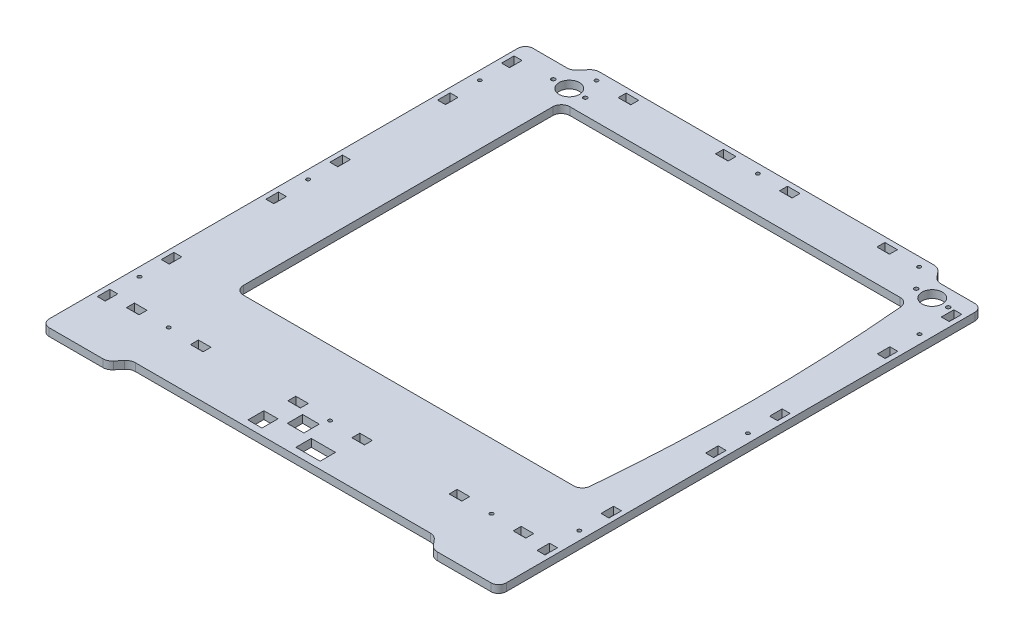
ISO-10303-21;
HEADER;
FILE_DESCRIPTION(('STEP AP214'),'2;1');
FILE_NAME('part.step','',(''),(''),'','','');
FILE_SCHEMA(('AUTOMOTIVE_DESIGN { 1 0 10303 214 1 1 1 1 }'));
ENDSEC;
DATA;
#1=APPLICATION_CONTEXT('core data for automotive mechanical design processes');
#2=APPLICATION_PROTOCOL_DEFINITION('international standard','automotive_design',2000,#1);
#3=PRODUCT_CONTEXT('',#1,'mechanical');
#4=PRODUCT('Part','Part','',(#3));
#5=PRODUCT_RELATED_PRODUCT_CATEGORY('part','',(#4));
#6=PRODUCT_DEFINITION_FORMATION('','',#4);
#7=PRODUCT_DEFINITION_CONTEXT('part definition',#1,'design');
#8=PRODUCT_DEFINITION('design','',#6,#7);
#9=PRODUCT_DEFINITION_SHAPE('','',#8);
#10=(LENGTH_UNIT() NAMED_UNIT(*) SI_UNIT(.MILLI.,.METRE.));
#11=(NAMED_UNIT(*) PLANE_ANGLE_UNIT() SI_UNIT($,.RADIAN.));
#12=(NAMED_UNIT(*) SI_UNIT($,.STERADIAN.) SOLID_ANGLE_UNIT());
#13=UNCERTAINTY_MEASURE_WITH_UNIT(LENGTH_MEASURE(1.E-05),#10,'distance_accuracy_value','');
#14=(GEOMETRIC_REPRESENTATION_CONTEXT(3) GLOBAL_UNCERTAINTY_ASSIGNED_CONTEXT((#13)) GLOBAL_UNIT_ASSIGNED_CONTEXT((#10,
#11,#12)) REPRESENTATION_CONTEXT('',''));
#15=CARTESIAN_POINT('',(0.,0.,0.));
#16=DIRECTION('',(0.,0.,1.));
#17=DIRECTION('',(1.,0.,0.));
#18=AXIS2_PLACEMENT_3D('',#15,#16,#17);
#19=CARTESIAN_POINT('',(0.,3.,0.));
#20=DIRECTION('',(0.,1.,0.));
#21=DIRECTION('',(0.,0.,1.));
#22=AXIS2_PLACEMENT_3D('',#19,#20,#21);
#23=PLANE('',#22);
#24=DIRECTION('',(1.,0.,0.));
#25=VECTOR('',#24,1.);
#26=CARTESIAN_POINT('',(0.,3.,178.5));
#27=LINE('',#26,#25);
#28=CARTESIAN_POINT('',(23.6,3.,178.5));
#29=VERTEX_POINT('',#28);
#30=CARTESIAN_POINT('',(4.7,3.,178.5));
#31=VERTEX_POINT('',#30);
#32=EDGE_CURVE('E1292',#29,#31,#27,.F.);
#33=ORIENTED_EDGE('',*,*,#32,.T.);
#34=DIRECTION('',(0.,0.,1.));
#35=VECTOR('',#34,1.);
#36=CARTESIAN_POINT('',(4.7,3.,0.));
#37=LINE('',#36,#35);
#38=CARTESIAN_POINT('',(4.7,3.,166.5));
#39=VERTEX_POINT('',#38);
#40=EDGE_CURVE('E1301',#31,#39,#37,.F.);
#41=ORIENTED_EDGE('',*,*,#40,.T.);
#42=DIRECTION('',(1.,0.,0.));
#43=VECTOR('',#42,1.);
#44=CARTESIAN_POINT('',(0.,3.,166.5));
#45=LINE('',#44,#43);
#46=CARTESIAN_POINT('',(23.6,3.,166.5));
#47=VERTEX_POINT('',#46);
#48=EDGE_CURVE('E1298',#39,#47,#45,.T.);
#49=ORIENTED_EDGE('',*,*,#48,.T.);
#50=DIRECTION('',(0.,0.,1.));
#51=VECTOR('',#50,1.);
#52=CARTESIAN_POINT('',(23.6,3.,0.));
#53=LINE('',#52,#51);
#54=EDGE_CURVE('E1295',#47,#29,#53,.T.);
#55=ORIENTED_EDGE('',*,*,#54,.T.);
#56=EDGE_LOOP('',(#33,#41,#49,#55));
#57=FACE_BOUND('',#56,.T.);
#58=DIRECTION('',(0.,0.,1.));
#59=VECTOR('',#58,1.);
#60=CARTESIAN_POINT('',(-32.55,3.,0.));
#61=LINE('',#60,#59);
#62=CARTESIAN_POINT('',(-32.55,3.,178.75));
#63=VERTEX_POINT('',#62);
#64=CARTESIAN_POINT('',(-32.55,3.,166.25));
#65=VERTEX_POINT('',#64);
#66=EDGE_CURVE('E1304',#63,#65,#61,.F.);
#67=ORIENTED_EDGE('',*,*,#66,.T.);
#68=DIRECTION('',(1.,0.,0.));
#69=VECTOR('',#68,1.);
#70=CARTESIAN_POINT('',(0.,3.,166.25));
#71=LINE('',#70,#69);
#72=CARTESIAN_POINT('',(-21.55,3.,166.25));
#73=VERTEX_POINT('',#72);
#74=EDGE_CURVE('E1314',#65,#73,#71,.T.);
#75=ORIENTED_EDGE('',*,*,#74,.T.);
#76=DIRECTION('',(0.,0.,1.));
#77=VECTOR('',#76,1.);
#78=CARTESIAN_POINT('',(-21.55,3.,0.));
#79=LINE('',#78,#77);
#80=CARTESIAN_POINT('',(-21.55,3.,178.75));
#81=VERTEX_POINT('',#80);
#82=EDGE_CURVE('E1311',#73,#81,#79,.T.);
#83=ORIENTED_EDGE('',*,*,#82,.T.);
#84=DIRECTION('',(1.,0.,0.));
#85=VECTOR('',#84,1.);
#86=CARTESIAN_POINT('',(0.,3.,178.75));
#87=LINE('',#86,#85);
#88=EDGE_CURVE('E1308',#81,#63,#87,.F.);
#89=ORIENTED_EDGE('',*,*,#88,.T.);
#90=EDGE_LOOP('',(#67,#75,#83,#89));
#91=FACE_BOUND('',#90,.T.);
#92=DIRECTION('',(1.,0.,0.));
#93=VECTOR('',#92,1.);
#94=CARTESIAN_POINT('',(0.,3.,165.7));
#95=LINE('',#94,#93);
#96=CARTESIAN_POINT('',(-1.85,3.,165.7));
#97=VERTEX_POINT('',#96);
#98=CARTESIAN_POINT('',(-14.85,3.,165.7));
#99=VERTEX_POINT('',#98);
#100=EDGE_CURVE('E1317',#97,#99,#95,.F.);
#101=ORIENTED_EDGE('',*,*,#100,.T.);
#102=DIRECTION('',(0.,0.,1.));
#103=VECTOR('',#102,1.);
#104=CARTESIAN_POINT('',(-14.85,3.,0.));
#105=LINE('',#104,#103);
#106=CARTESIAN_POINT('',(-14.85,3.,153.7));
#107=VERTEX_POINT('',#106);
#108=EDGE_CURVE('E1327',#99,#107,#105,.F.);
#109=ORIENTED_EDGE('',*,*,#108,.T.);
#110=DIRECTION('',(1.,0.,0.));
#111=VECTOR('',#110,1.);
#112=CARTESIAN_POINT('',(0.,3.,153.7));
#113=LINE('',#112,#111);
#114=CARTESIAN_POINT('',(-1.85,3.,153.7));
#115=VERTEX_POINT('',#114);
#116=EDGE_CURVE('E1324',#107,#115,#113,.T.);
#117=ORIENTED_EDGE('',*,*,#116,.T.);
#118=DIRECTION('',(0.,0.,1.));
#119=VECTOR('',#118,1.);
#120=CARTESIAN_POINT('',(-1.85,3.,0.));
#121=LINE('',#120,#119);
#122=EDGE_CURVE('E1321',#115,#97,#121,.T.);
#123=ORIENTED_EDGE('',*,*,#122,.T.);
#124=EDGE_LOOP('',(#101,#109,#117,#123));
#125=FACE_BOUND('',#124,.T.);
#126=DIRECTION('',(0.,0.,1.));
#127=VECTOR('',#126,1.);
#128=CARTESIAN_POINT('',(-174.85,3.,0.));
#129=LINE('',#128,#127);
#130=CARTESIAN_POINT('',(-174.85,3.,-111.7));
#131=VERTEX_POINT('',#130);
#132=CARTESIAN_POINT('',(-174.85,3.,-121.5));
#133=VERTEX_POINT('',#132);
#134=EDGE_CURVE('E1330',#131,#133,#129,.F.);
#135=ORIENTED_EDGE('',*,*,#134,.T.);
#136=DIRECTION('',(1.,0.,0.));
#137=VECTOR('',#136,1.);
#138=CARTESIAN_POINT('',(0.,3.,-121.5));
#139=LINE('',#138,#137);
#140=CARTESIAN_POINT('',(-168.65,3.,-121.5));
#141=VERTEX_POINT('',#140);
#142=EDGE_CURVE('E1340',#133,#141,#139,.T.);
#143=ORIENTED_EDGE('',*,*,#142,.T.);
#144=DIRECTION('',(0.,0.,1.));
#145=VECTOR('',#144,1.);
#146=CARTESIAN_POINT('',(-168.65,3.,0.));
#147=LINE('',#146,#145);
#148=CARTESIAN_POINT('',(-168.65,3.,-111.7));
#149=VERTEX_POINT('',#148);
#150=EDGE_CURVE('E1337',#141,#149,#147,.T.);
#151=ORIENTED_EDGE('',*,*,#150,.T.);
#152=DIRECTION('',(1.,0.,0.));
#153=VECTOR('',#152,1.);
#154=CARTESIAN_POINT('',(0.,3.,-111.7));
#155=LINE('',#154,#153);
#156=EDGE_CURVE('E1334',#149,#131,#155,.F.);
#157=ORIENTED_EDGE('',*,*,#156,.T.);
#158=EDGE_LOOP('',(#135,#143,#151,#157));
#159=FACE_BOUND('',#158,.T.);
#160=DIRECTION('',(0.,0.,1.));
#161=VECTOR('',#160,1.);
#162=CARTESIAN_POINT('',(-174.85,3.,0.));
#163=LINE('',#162,#161);
#164=CARTESIAN_POINT('',(-174.85,3.,-161.7));
#165=VERTEX_POINT('',#164);
#166=CARTESIAN_POINT('',(-174.85,3.,-171.5));
#167=VERTEX_POINT('',#166);
#168=EDGE_CURVE('E1343',#165,#167,#163,.F.);
#169=ORIENTED_EDGE('',*,*,#168,.T.);
#170=DIRECTION('',(1.,0.,0.));
#171=VECTOR('',#170,1.);
#172=CARTESIAN_POINT('',(0.,3.,-171.5));
#173=LINE('',#172,#171);
#174=CARTESIAN_POINT('',(-168.65,3.,-171.5));
#175=VERTEX_POINT('',#174);
#176=EDGE_CURVE('E1353',#167,#175,#173,.T.);
#177=ORIENTED_EDGE('',*,*,#176,.T.);
#178=DIRECTION('',(0.,0.,1.));
#179=VECTOR('',#178,1.);
#180=CARTESIAN_POINT('',(-168.65,3.,0.));
#181=LINE('',#180,#179);
#182=CARTESIAN_POINT('',(-168.65,3.,-161.7));
#183=VERTEX_POINT('',#182);
#184=EDGE_CURVE('E1350',#175,#183,#181,.T.);
#185=ORIENTED_EDGE('',*,*,#184,.T.);
#186=DIRECTION('',(1.,0.,0.));
#187=VECTOR('',#186,1.);
#188=CARTESIAN_POINT('',(0.,3.,-161.7));
#189=LINE('',#188,#187);
#190=EDGE_CURVE('E1347',#183,#165,#189,.F.);
#191=ORIENTED_EDGE('',*,*,#190,.T.);
#192=EDGE_LOOP('',(#169,#177,#185,#191));
#193=FACE_BOUND('',#192,.T.);
#194=DIRECTION('',(1.,0.,0.));
#195=VECTOR('',#194,1.);
#196=CARTESIAN_POINT('',(0.,3.,-37.4));
#197=LINE('',#196,#195);
#198=CARTESIAN_POINT('',(-174.85,3.,-37.4));
#199=VERTEX_POINT('',#198);
#200=CARTESIAN_POINT('',(-168.65,3.,-37.4));
#201=VERTEX_POINT('',#200);
#202=EDGE_CURVE('E1356',#199,#201,#197,.T.);
#203=ORIENTED_EDGE('',*,*,#202,.T.);
#204=DIRECTION('',(0.,0.,1.));
#205=VECTOR('',#204,1.);
#206=CARTESIAN_POINT('',(-168.65,3.,0.));
#207=LINE('',#206,#205);
#208=CARTESIAN_POINT('',(-168.65,3.,-27.6));
#209=VERTEX_POINT('',#208);
#210=EDGE_CURVE('E1366',#201,#209,#207,.T.);
#211=ORIENTED_EDGE('',*,*,#210,.T.);
#212=DIRECTION('',(1.,0.,0.));
#213=VECTOR('',#212,1.);
#214=CARTESIAN_POINT('',(0.,3.,-27.6));
#215=LINE('',#214,#213);
#216=CARTESIAN_POINT('',(-174.85,3.,-27.6));
#217=VERTEX_POINT('',#216);
#218=EDGE_CURVE('E1363',#209,#217,#215,.F.);
#219=ORIENTED_EDGE('',*,*,#218,.T.);
#220=DIRECTION('',(0.,0.,1.));
#221=VECTOR('',#220,1.);
#222=CARTESIAN_POINT('',(-174.85,3.,0.));
#223=LINE('',#222,#221);
#224=EDGE_CURVE('E1360',#217,#199,#223,.F.);
#225=ORIENTED_EDGE('',*,*,#224,.T.);
#226=EDGE_LOOP('',(#203,#211,#219,#225));
#227=FACE_BOUND('',#226,.T.);
#228=DIRECTION('',(1.,0.,0.));
#229=VECTOR('',#228,1.);
#230=CARTESIAN_POINT('',(0.,3.,12.6));
#231=LINE('',#230,#229);
#232=CARTESIAN_POINT('',(-174.85,3.,12.6));
#233=VERTEX_POINT('',#232);
#234=CARTESIAN_POINT('',(-168.65,3.,12.6));
#235=VERTEX_POINT('',#234);
#236=EDGE_CURVE('E1369',#233,#235,#231,.T.);
#237=ORIENTED_EDGE('',*,*,#236,.T.);
#238=DIRECTION('',(0.,0.,1.));
#239=VECTOR('',#238,1.);
#240=CARTESIAN_POINT('',(-168.65,3.,0.));
#241=LINE('',#240,#239);
#242=CARTESIAN_POINT('',(-168.65,3.,22.4));
#243=VERTEX_POINT('',#242);
#244=EDGE_CURVE('E1379',#235,#243,#241,.T.);
#245=ORIENTED_EDGE('',*,*,#244,.T.);
#246=DIRECTION('',(1.,0.,0.));
#247=VECTOR('',#246,1.);
#248=CARTESIAN_POINT('',(0.,3.,22.4));
#249=LINE('',#248,#247);
#250=CARTESIAN_POINT('',(-174.85,3.,22.4));
#251=VERTEX_POINT('',#250);
#252=EDGE_CURVE('E1376',#243,#251,#249,.F.);
#253=ORIENTED_EDGE('',*,*,#252,.T.);
#254=DIRECTION('',(0.,0.,1.));
#255=VECTOR('',#254,1.);
#256=CARTESIAN_POINT('',(-174.85,3.,0.));
#257=LINE('',#256,#255);
#258=EDGE_CURVE('E1373',#251,#233,#257,.F.);
#259=ORIENTED_EDGE('',*,*,#258,.T.);
#260=EDGE_LOOP('',(#237,#245,#253,#259));
#261=FACE_BOUND('',#260,.T.);
#262=DIRECTION('',(0.,0.,1.));
#263=VECTOR('',#262,1.);
#264=CARTESIAN_POINT('',(-174.85,3.,0.));
#265=LINE('',#264,#263);
#266=CARTESIAN_POINT('',(-174.85,3.,154.1));
#267=VERTEX_POINT('',#266);
#268=CARTESIAN_POINT('',(-174.85,3.,144.3));
#269=VERTEX_POINT('',#268);
#270=EDGE_CURVE('E1382',#267,#269,#265,.F.);
#271=ORIENTED_EDGE('',*,*,#270,.T.);
#272=DIRECTION('',(1.,0.,0.));
#273=VECTOR('',#272,1.);
#274=CARTESIAN_POINT('',(0.,3.,144.3));
#275=LINE('',#274,#273);
#276=CARTESIAN_POINT('',(-168.65,3.,144.3));
#277=VERTEX_POINT('',#276);
#278=EDGE_CURVE('E1392',#269,#277,#275,.T.);
#279=ORIENTED_EDGE('',*,*,#278,.T.);
#280=DIRECTION('',(0.,0.,1.));
#281=VECTOR('',#280,1.);
#282=CARTESIAN_POINT('',(-168.65,3.,0.));
#283=LINE('',#282,#281);
#284=CARTESIAN_POINT('',(-168.65,3.,154.1));
#285=VERTEX_POINT('',#284);
#286=EDGE_CURVE('E1389',#277,#285,#283,.T.);
#287=ORIENTED_EDGE('',*,*,#286,.T.);
#288=DIRECTION('',(1.,0.,0.));
#289=VECTOR('',#288,1.);
#290=CARTESIAN_POINT('',(0.,3.,154.1));
#291=LINE('',#290,#289);
#292=EDGE_CURVE('E1386',#285,#267,#291,.F.);
#293=ORIENTED_EDGE('',*,*,#292,.T.);
#294=EDGE_LOOP('',(#271,#279,#287,#293));
#295=FACE_BOUND('',#294,.T.);
#296=DIRECTION('',(0.,0.,1.));
#297=VECTOR('',#296,1.);
#298=CARTESIAN_POINT('',(-174.85,3.,0.));
#299=LINE('',#298,#297);
#300=CARTESIAN_POINT('',(-174.85,3.,104.1));
#301=VERTEX_POINT('',#300);
#302=CARTESIAN_POINT('',(-174.85,3.,94.3));
#303=VERTEX_POINT('',#302);
#304=EDGE_CURVE('E1395',#301,#303,#299,.F.);
#305=ORIENTED_EDGE('',*,*,#304,.T.);
#306=DIRECTION('',(1.,0.,0.));
#307=VECTOR('',#306,1.);
#308=CARTESIAN_POINT('',(0.,3.,94.3));
#309=LINE('',#308,#307);
#310=CARTESIAN_POINT('',(-168.65,3.,94.3));
#311=VERTEX_POINT('',#310);
#312=EDGE_CURVE('E1405',#303,#311,#309,.T.);
#313=ORIENTED_EDGE('',*,*,#312,.T.);
#314=DIRECTION('',(0.,0.,1.));
#315=VECTOR('',#314,1.);
#316=CARTESIAN_POINT('',(-168.65,3.,0.));
#317=LINE('',#316,#315);
#318=CARTESIAN_POINT('',(-168.65,3.,104.1));
#319=VERTEX_POINT('',#318);
#320=EDGE_CURVE('E1402',#311,#319,#317,.T.);
#321=ORIENTED_EDGE('',*,*,#320,.T.);
#322=DIRECTION('',(1.,0.,0.));
#323=VECTOR('',#322,1.);
#324=CARTESIAN_POINT('',(0.,3.,104.1));
#325=LINE('',#324,#323);
#326=EDGE_CURVE('E1399',#319,#301,#325,.F.);
#327=ORIENTED_EDGE('',*,*,#326,.T.);
#328=EDGE_LOOP('',(#305,#313,#321,#327));
#329=FACE_BOUND('',#328,.T.);
#330=CARTESIAN_POINT('',(-171.75,3.,-141.6));
#331=DIRECTION('',(0.,1.,0.));
#332=DIRECTION('',(0.,0.,1.));
#333=AXIS2_PLACEMENT_3D('',#330,#331,#332);
#334=CIRCLE('',#333,1.4);
#335=CARTESIAN_POINT('',(-171.75,3.,-140.2));
#336=VERTEX_POINT('',#335);
#337=EDGE_CURVE('E1407',#336,#336,#334,.F.);
#338=ORIENTED_EDGE('',*,*,#337,.T.);
#339=EDGE_LOOP('',(#338));
#340=FACE_BOUND('',#339,.T.);
#341=CARTESIAN_POINT('',(-171.75,3.,-7.5));
#342=DIRECTION('',(0.,1.,0.));
#343=DIRECTION('',(0.,0.,1.));
#344=AXIS2_PLACEMENT_3D('',#341,#342,#343);
#345=CIRCLE('',#344,1.4);
#346=CARTESIAN_POINT('',(-171.75,3.,-6.1));
#347=VERTEX_POINT('',#346);
#348=EDGE_CURVE('E1410',#347,#347,#345,.F.);
#349=ORIENTED_EDGE('',*,*,#348,.T.);
#350=EDGE_LOOP('',(#349));
#351=FACE_BOUND('',#350,.T.);
#352=CARTESIAN_POINT('',(-171.75,3.,124.2));
#353=DIRECTION('',(0.,1.,0.));
#354=DIRECTION('',(0.,0.,1.));
#355=AXIS2_PLACEMENT_3D('',#352,#353,#354);
#356=CIRCLE('',#355,1.4);
#357=CARTESIAN_POINT('',(-171.75,3.,125.6));
#358=VERTEX_POINT('',#357);
#359=EDGE_CURVE('E1413',#358,#358,#356,.F.);
#360=ORIENTED_EDGE('',*,*,#359,.T.);
#361=EDGE_LOOP('',(#360));
#362=FACE_BOUND('',#361,.T.);
#363=DIRECTION('',(0.,0.,1.));
#364=VECTOR('',#363,1.);
#365=CARTESIAN_POINT('',(174.85,3.,0.));
#366=LINE('',#365,#364);
#367=CARTESIAN_POINT('',(174.85,3.,94.3));
#368=VERTEX_POINT('',#367);
#369=CARTESIAN_POINT('',(174.85,3.,104.1));
#370=VERTEX_POINT('',#369);
#371=EDGE_CURVE('E1417',#368,#370,#366,.T.);
#372=ORIENTED_EDGE('',*,*,#371,.T.);
#373=DIRECTION('',(1.,0.,0.));
#374=VECTOR('',#373,1.);
#375=CARTESIAN_POINT('',(0.,3.,104.1));
#376=LINE('',#375,#374);
#377=CARTESIAN_POINT('',(168.65,3.,104.1));
#378=VERTEX_POINT('',#377);
#379=EDGE_CURVE('E1427',#370,#378,#376,.F.);
#380=ORIENTED_EDGE('',*,*,#379,.T.);
#381=DIRECTION('',(0.,0.,1.));
#382=VECTOR('',#381,1.);
#383=CARTESIAN_POINT('',(168.65,3.,0.));
#384=LINE('',#383,#382);
#385=CARTESIAN_POINT('',(168.65,3.,94.3));
#386=VERTEX_POINT('',#385);
#387=EDGE_CURVE('E1424',#378,#386,#384,.F.);
#388=ORIENTED_EDGE('',*,*,#387,.T.);
#389=DIRECTION('',(1.,0.,0.));
#390=VECTOR('',#389,1.);
#391=CARTESIAN_POINT('',(0.,3.,94.3));
#392=LINE('',#391,#390);
#393=EDGE_CURVE('E1421',#386,#368,#392,.T.);
#394=ORIENTED_EDGE('',*,*,#393,.T.);
#395=EDGE_LOOP('',(#372,#380,#388,#394));
#396=FACE_BOUND('',#395,.T.);
#397=DIRECTION('',(0.,0.,1.));
#398=VECTOR('',#397,1.);
#399=CARTESIAN_POINT('',(174.85,3.,0.));
#400=LINE('',#399,#398);
#401=CARTESIAN_POINT('',(174.85,3.,144.3));
#402=VERTEX_POINT('',#401);
#403=CARTESIAN_POINT('',(174.85,3.,154.1));
#404=VERTEX_POINT('',#403);
#405=EDGE_CURVE('E1430',#402,#404,#400,.T.);
#406=ORIENTED_EDGE('',*,*,#405,.T.);
#407=DIRECTION('',(1.,0.,0.));
#408=VECTOR('',#407,1.);
#409=CARTESIAN_POINT('',(0.,3.,154.1));
#410=LINE('',#409,#408);
#411=CARTESIAN_POINT('',(168.65,3.,154.1));
#412=VERTEX_POINT('',#411);
#413=EDGE_CURVE('E1440',#404,#412,#410,.F.);
#414=ORIENTED_EDGE('',*,*,#413,.T.);
#415=DIRECTION('',(0.,0.,1.));
#416=VECTOR('',#415,1.);
#417=CARTESIAN_POINT('',(168.65,3.,0.));
#418=LINE('',#417,#416);
#419=CARTESIAN_POINT('',(168.65,3.,144.3));
#420=VERTEX_POINT('',#419);
#421=EDGE_CURVE('E1437',#412,#420,#418,.F.);
#422=ORIENTED_EDGE('',*,*,#421,.T.);
#423=DIRECTION('',(1.,0.,0.));
#424=VECTOR('',#423,1.);
#425=CARTESIAN_POINT('',(0.,3.,144.3));
#426=LINE('',#425,#424);
#427=EDGE_CURVE('E1434',#420,#402,#426,.T.);
#428=ORIENTED_EDGE('',*,*,#427,.T.);
#429=EDGE_LOOP('',(#406,#414,#422,#428));
#430=FACE_BOUND('',#429,.T.);
#431=DIRECTION('',(1.,0.,0.));
#432=VECTOR('',#431,1.);
#433=CARTESIAN_POINT('',(0.,3.,22.4));
#434=LINE('',#433,#432);
#435=CARTESIAN_POINT('',(174.85,3.,22.4));
#436=VERTEX_POINT('',#435);
#437=CARTESIAN_POINT('',(168.65,3.,22.4));
#438=VERTEX_POINT('',#437);
#439=EDGE_CURVE('E1443',#436,#438,#434,.F.);
#440=ORIENTED_EDGE('',*,*,#439,.T.);
#441=DIRECTION('',(0.,0.,1.));
#442=VECTOR('',#441,1.);
#443=CARTESIAN_POINT('',(168.65,3.,0.));
#444=LINE('',#443,#442);
#445=CARTESIAN_POINT('',(168.65,3.,12.6));
#446=VERTEX_POINT('',#445);
#447=EDGE_CURVE('E1453',#438,#446,#444,.F.);
#448=ORIENTED_EDGE('',*,*,#447,.T.);
#449=DIRECTION('',(1.,0.,0.));
#450=VECTOR('',#449,1.);
#451=CARTESIAN_POINT('',(0.,3.,12.6));
#452=LINE('',#451,#450);
#453=CARTESIAN_POINT('',(174.85,3.,12.6));
#454=VERTEX_POINT('',#453);
#455=EDGE_CURVE('E1450',#446,#454,#452,.T.);
#456=ORIENTED_EDGE('',*,*,#455,.T.);
#457=DIRECTION('',(0.,0.,1.));
#458=VECTOR('',#457,1.);
#459=CARTESIAN_POINT('',(174.85,3.,0.));
#460=LINE('',#459,#458);
#461=EDGE_CURVE('E1447',#454,#436,#460,.T.);
#462=ORIENTED_EDGE('',*,*,#461,.T.);
#463=EDGE_LOOP('',(#440,#448,#456,#462));
#464=FACE_BOUND('',#463,.T.);
#465=DIRECTION('',(1.,0.,0.));
#466=VECTOR('',#465,1.);
#467=CARTESIAN_POINT('',(0.,3.,-27.6));
#468=LINE('',#467,#466);
#469=CARTESIAN_POINT('',(174.85,3.,-27.6));
#470=VERTEX_POINT('',#469);
#471=CARTESIAN_POINT('',(168.65,3.,-27.6));
#472=VERTEX_POINT('',#471);
#473=EDGE_CURVE('E1456',#470,#472,#468,.F.);
#474=ORIENTED_EDGE('',*,*,#473,.T.);
#475=DIRECTION('',(0.,0.,1.));
#476=VECTOR('',#475,1.);
#477=CARTESIAN_POINT('',(168.65,3.,0.));
#478=LINE('',#477,#476);
#479=CARTESIAN_POINT('',(168.65,3.,-37.4));
#480=VERTEX_POINT('',#479);
#481=EDGE_CURVE('E1466',#472,#480,#478,.F.);
#482=ORIENTED_EDGE('',*,*,#481,.T.);
#483=DIRECTION('',(1.,0.,0.));
#484=VECTOR('',#483,1.);
#485=CARTESIAN_POINT('',(0.,3.,-37.4));
#486=LINE('',#485,#484);
#487=CARTESIAN_POINT('',(174.85,3.,-37.4));
#488=VERTEX_POINT('',#487);
#489=EDGE_CURVE('E1463',#480,#488,#486,.T.);
#490=ORIENTED_EDGE('',*,*,#489,.T.);
#491=DIRECTION('',(0.,0.,1.));
#492=VECTOR('',#491,1.);
#493=CARTESIAN_POINT('',(174.85,3.,0.));
#494=LINE('',#493,#492);
#495=EDGE_CURVE('E1460',#488,#470,#494,.T.);
#496=ORIENTED_EDGE('',*,*,#495,.T.);
#497=EDGE_LOOP('',(#474,#482,#490,#496));
#498=FACE_BOUND('',#497,.T.);
#499=DIRECTION('',(0.,0.,1.));
#500=VECTOR('',#499,1.);
#501=CARTESIAN_POINT('',(174.85,3.,0.));
#502=LINE('',#501,#500);
#503=CARTESIAN_POINT('',(174.85,3.,-171.5));
#504=VERTEX_POINT('',#503);
#505=CARTESIAN_POINT('',(174.85,3.,-161.7));
#506=VERTEX_POINT('',#505);
#507=EDGE_CURVE('E1469',#504,#506,#502,.T.);
#508=ORIENTED_EDGE('',*,*,#507,.T.);
#509=DIRECTION('',(1.,0.,0.));
#510=VECTOR('',#509,1.);
#511=CARTESIAN_POINT('',(0.,3.,-161.7));
#512=LINE('',#511,#510);
#513=CARTESIAN_POINT('',(168.65,3.,-161.7));
#514=VERTEX_POINT('',#513);
#515=EDGE_CURVE('E1479',#506,#514,#512,.F.);
#516=ORIENTED_EDGE('',*,*,#515,.T.);
#517=DIRECTION('',(0.,0.,1.));
#518=VECTOR('',#517,1.);
#519=CARTESIAN_POINT('',(168.65,3.,0.));
#520=LINE('',#519,#518);
#521=CARTESIAN_POINT('',(168.65,3.,-171.5));
#522=VERTEX_POINT('',#521);
#523=EDGE_CURVE('E1476',#514,#522,#520,.F.);
#524=ORIENTED_EDGE('',*,*,#523,.T.);
#525=DIRECTION('',(1.,0.,0.));
#526=VECTOR('',#525,1.);
#527=CARTESIAN_POINT('',(0.,3.,-171.5));
#528=LINE('',#527,#526);
#529=EDGE_CURVE('E1473',#522,#504,#528,.T.);
#530=ORIENTED_EDGE('',*,*,#529,.T.);
#531=EDGE_LOOP('',(#508,#516,#524,#530));
#532=FACE_BOUND('',#531,.T.);
#533=DIRECTION('',(0.,0.,1.));
#534=VECTOR('',#533,1.);
#535=CARTESIAN_POINT('',(174.85,3.,0.));
#536=LINE('',#535,#534);
#537=CARTESIAN_POINT('',(174.85,3.,-121.5));
#538=VERTEX_POINT('',#537);
#539=CARTESIAN_POINT('',(174.85,3.,-111.7));
#540=VERTEX_POINT('',#539);
#541=EDGE_CURVE('E1482',#538,#540,#536,.T.);
#542=ORIENTED_EDGE('',*,*,#541,.T.);
#543=DIRECTION('',(1.,0.,0.));
#544=VECTOR('',#543,1.);
#545=CARTESIAN_POINT('',(0.,3.,-111.7));
#546=LINE('',#545,#544);
#547=CARTESIAN_POINT('',(168.65,3.,-111.7));
#548=VERTEX_POINT('',#547);
#549=EDGE_CURVE('E1492',#540,#548,#546,.F.);
#550=ORIENTED_EDGE('',*,*,#549,.T.);
#551=DIRECTION('',(0.,0.,1.));
#552=VECTOR('',#551,1.);
#553=CARTESIAN_POINT('',(168.65,3.,0.));
#554=LINE('',#553,#552);
#555=CARTESIAN_POINT('',(168.65,3.,-121.5));
#556=VERTEX_POINT('',#555);
#557=EDGE_CURVE('E1489',#548,#556,#554,.F.);
#558=ORIENTED_EDGE('',*,*,#557,.T.);
#559=DIRECTION('',(1.,0.,0.));
#560=VECTOR('',#559,1.);
#561=CARTESIAN_POINT('',(0.,3.,-121.5));
#562=LINE('',#561,#560);
#563=EDGE_CURVE('E1486',#556,#538,#562,.T.);
#564=ORIENTED_EDGE('',*,*,#563,.T.);
#565=EDGE_LOOP('',(#542,#550,#558,#564));
#566=FACE_BOUND('',#565,.T.);
#567=CARTESIAN_POINT('',(171.75,3.,124.2));
#568=DIRECTION('',(0.,1.,0.));
#569=DIRECTION('',(0.,0.,1.));
#570=AXIS2_PLACEMENT_3D('',#567,#568,#569);
#571=CIRCLE('',#570,1.4);
#572=CARTESIAN_POINT('',(171.75,3.,125.6));
#573=VERTEX_POINT('',#572);
#574=EDGE_CURVE('E1494',#573,#573,#571,.F.);
#575=ORIENTED_EDGE('',*,*,#574,.T.);
#576=EDGE_LOOP('',(#575));
#577=FACE_BOUND('',#576,.T.);
#578=CARTESIAN_POINT('',(171.75,3.,-7.5));
#579=DIRECTION('',(0.,1.,0.));
#580=DIRECTION('',(0.,0.,1.));
#581=AXIS2_PLACEMENT_3D('',#578,#579,#580);
#582=CIRCLE('',#581,1.4);
#583=CARTESIAN_POINT('',(171.75,3.,-6.1));
#584=VERTEX_POINT('',#583);
#585=EDGE_CURVE('E1497',#584,#584,#582,.F.);
#586=ORIENTED_EDGE('',*,*,#585,.T.);
#587=EDGE_LOOP('',(#586));
#588=FACE_BOUND('',#587,.T.);
#589=CARTESIAN_POINT('',(171.75,3.,-141.6));
#590=DIRECTION('',(0.,1.,0.));
#591=DIRECTION('',(0.,0.,1.));
#592=AXIS2_PLACEMENT_3D('',#589,#590,#591);
#593=CIRCLE('',#592,1.4);
#594=CARTESIAN_POINT('',(171.75,3.,-140.2));
#595=VERTEX_POINT('',#594);
#596=EDGE_CURVE('E1500',#595,#595,#593,.F.);
#597=ORIENTED_EDGE('',*,*,#596,.T.);
#598=EDGE_LOOP('',(#597));
#599=FACE_BOUND('',#598,.T.);
#600=CARTESIAN_POINT('',(139.75,3.,-171.));
#601=DIRECTION('',(0.,1.,0.));
#602=DIRECTION('',(0.,0.,1.));
#603=AXIS2_PLACEMENT_3D('',#600,#601,#602);
#604=CIRCLE('',#603,1.5);
#605=CARTESIAN_POINT('',(139.75,3.,-169.5));
#606=VERTEX_POINT('',#605);
#607=EDGE_CURVE('E1503',#606,#606,#604,.F.);
#608=ORIENTED_EDGE('',*,*,#607,.T.);
#609=EDGE_LOOP('',(#608));
#610=FACE_BOUND('',#609,.T.);
#611=CARTESIAN_POINT('',(164.75,3.,-171.));
#612=DIRECTION('',(0.,1.,0.));
#613=DIRECTION('',(0.,0.,1.));
#614=AXIS2_PLACEMENT_3D('',#611,#612,#613);
#615=CIRCLE('',#614,1.5);
#616=CARTESIAN_POINT('',(164.75,3.,-169.5));
#617=VERTEX_POINT('',#616);
#618=EDGE_CURVE('E1506',#617,#617,#615,.F.);
#619=ORIENTED_EDGE('',*,*,#618,.T.);
#620=EDGE_LOOP('',(#619));
#621=FACE_BOUND('',#620,.T.);
#622=CARTESIAN_POINT('',(152.25,3.,-171.));
#623=DIRECTION('',(0.,1.,0.));
#624=DIRECTION('',(0.,0.,1.));
#625=AXIS2_PLACEMENT_3D('',#622,#623,#624);
#626=CIRCLE('',#625,8.);
#627=CARTESIAN_POINT('',(152.25,3.,-163.));
#628=VERTEX_POINT('',#627);
#629=EDGE_CURVE('E1509',#628,#628,#626,.F.);
#630=ORIENTED_EDGE('',*,*,#629,.T.);
#631=EDGE_LOOP('',(#630));
#632=FACE_BOUND('',#631,.T.);
#633=CARTESIAN_POINT('',(-118.75,3.,-171.));
#634=DIRECTION('',(0.,1.,0.));
#635=DIRECTION('',(0.,0.,1.));
#636=AXIS2_PLACEMENT_3D('',#633,#634,#635);
#637=CIRCLE('',#636,1.5);
#638=CARTESIAN_POINT('',(-118.75,3.,-169.5));
#639=VERTEX_POINT('',#638);
#640=EDGE_CURVE('E1512',#639,#639,#637,.F.);
#641=ORIENTED_EDGE('',*,*,#640,.T.);
#642=EDGE_LOOP('',(#641));
#643=FACE_BOUND('',#642,.T.);
#644=CARTESIAN_POINT('',(-143.75,3.,-171.));
#645=DIRECTION('',(0.,1.,0.));
#646=DIRECTION('',(0.,0.,1.));
#647=AXIS2_PLACEMENT_3D('',#644,#645,#646);
#648=CIRCLE('',#647,1.5);
#649=CARTESIAN_POINT('',(-143.75,3.,-169.5));
#650=VERTEX_POINT('',#649);
#651=EDGE_CURVE('E1515',#650,#650,#648,.F.);
#652=ORIENTED_EDGE('',*,*,#651,.T.);
#653=EDGE_LOOP('',(#652));
#654=FACE_BOUND('',#653,.T.);
#655=CARTESIAN_POINT('',(-131.25,3.,-171.));
#656=DIRECTION('',(0.,1.,0.));
#657=DIRECTION('',(0.,0.,1.));
#658=AXIS2_PLACEMENT_3D('',#655,#656,#657);
#659=CIRCLE('',#658,8.);
#660=CARTESIAN_POINT('',(-131.25,3.,-163.));
#661=VERTEX_POINT('',#660);
#662=EDGE_CURVE('E1518',#661,#661,#659,.F.);
#663=ORIENTED_EDGE('',*,*,#662,.T.);
#664=EDGE_LOOP('',(#663));
#665=FACE_BOUND('',#664,.T.);
#666=CARTESIAN_POINT('',(126.05,3.,-187.));
#667=DIRECTION('',(0.,1.,0.));
#668=DIRECTION('',(0.,0.,1.));
#669=AXIS2_PLACEMENT_3D('',#666,#667,#668);
#670=CIRCLE('',#669,1.4);
#671=CARTESIAN_POINT('',(126.05,3.,-185.6));
#672=VERTEX_POINT('',#671);
#673=EDGE_CURVE('E1521',#672,#672,#670,.F.);
#674=ORIENTED_EDGE('',*,*,#673,.T.);
#675=EDGE_LOOP('',(#674));
#676=FACE_BOUND('',#675,.T.);
#677=CARTESIAN_POINT('',(-126.05,3.,-187.));
#678=DIRECTION('',(0.,1.,0.));
#679=DIRECTION('',(0.,0.,1.));
#680=AXIS2_PLACEMENT_3D('',#677,#678,#679);
#681=CIRCLE('',#680,1.4);
#682=CARTESIAN_POINT('',(-126.05,3.,-185.6));
#683=VERTEX_POINT('',#682);
#684=EDGE_CURVE('E1524',#683,#683,#681,.F.);
#685=ORIENTED_EDGE('',*,*,#684,.T.);
#686=EDGE_LOOP('',(#685));
#687=FACE_BOUND('',#686,.T.);
#688=CARTESIAN_POINT('',(0.,3.,-187.));
#689=DIRECTION('',(0.,1.,0.));
#690=DIRECTION('',(0.,0.,1.));
#691=AXIS2_PLACEMENT_3D('',#688,#689,#690);
#692=CIRCLE('',#691,1.4);
#693=CARTESIAN_POINT('',(0.,3.,-185.6));
#694=VERTEX_POINT('',#693);
#695=EDGE_CURVE('E1527',#694,#694,#692,.F.);
#696=ORIENTED_EDGE('',*,*,#695,.T.);
#697=EDGE_LOOP('',(#696));
#698=FACE_BOUND('',#697,.T.);
#699=DIRECTION('',(0.,0.,1.));
#700=VECTOR('',#699,1.);
#701=CARTESIAN_POINT('',(-105.95,3.,0.));
#702=LINE('',#701,#700);
#703=CARTESIAN_POINT('',(-105.95,3.,-183.9));
#704=VERTEX_POINT('',#703);
#705=CARTESIAN_POINT('',(-105.95,3.,-190.1));
#706=VERTEX_POINT('',#705);
#707=EDGE_CURVE('E1531',#704,#706,#702,.F.);
#708=ORIENTED_EDGE('',*,*,#707,.T.);
#709=DIRECTION('',(1.,0.,0.));
#710=VECTOR('',#709,1.);
#711=CARTESIAN_POINT('',(0.,3.,-190.1));
#712=LINE('',#711,#710);
#713=CARTESIAN_POINT('',(-96.15,3.,-190.1));
#714=VERTEX_POINT('',#713);
#715=EDGE_CURVE('E1541',#706,#714,#712,.T.);
#716=ORIENTED_EDGE('',*,*,#715,.T.);
#717=DIRECTION('',(0.,0.,1.));
#718=VECTOR('',#717,1.);
#719=CARTESIAN_POINT('',(-96.15,3.,0.));
#720=LINE('',#719,#718);
#721=CARTESIAN_POINT('',(-96.15,3.,-183.9));
#722=VERTEX_POINT('',#721);
#723=EDGE_CURVE('E1538',#714,#722,#720,.T.);
#724=ORIENTED_EDGE('',*,*,#723,.T.);
#725=DIRECTION('',(1.,0.,0.));
#726=VECTOR('',#725,1.);
#727=CARTESIAN_POINT('',(0.,3.,-183.9));
#728=LINE('',#727,#726);
#729=EDGE_CURVE('E1535',#722,#704,#728,.F.);
#730=ORIENTED_EDGE('',*,*,#729,.T.);
#731=EDGE_LOOP('',(#708,#716,#724,#730));
#732=FACE_BOUND('',#731,.T.);
#733=DIRECTION('',(0.,0.,1.));
#734=VECTOR('',#733,1.);
#735=CARTESIAN_POINT('',(96.15,3.,0.));
#736=LINE('',#735,#734);
#737=CARTESIAN_POINT('',(96.15,3.,-183.9));
#738=VERTEX_POINT('',#737);
#739=CARTESIAN_POINT('',(96.15,3.,-190.1));
#740=VERTEX_POINT('',#739);
#741=EDGE_CURVE('E1544',#738,#740,#736,.F.);
#742=ORIENTED_EDGE('',*,*,#741,.T.);
#743=DIRECTION('',(1.,0.,0.));
#744=VECTOR('',#743,1.);
#745=CARTESIAN_POINT('',(0.,3.,-190.1));
#746=LINE('',#745,#744);
#747=CARTESIAN_POINT('',(105.95,3.,-190.1));
#748=VERTEX_POINT('',#747);
#749=EDGE_CURVE('E1554',#740,#748,#746,.T.);
#750=ORIENTED_EDGE('',*,*,#749,.T.);
#751=DIRECTION('',(0.,0.,1.));
#752=VECTOR('',#751,1.);
#753=CARTESIAN_POINT('',(105.95,3.,0.));
#754=LINE('',#753,#752);
#755=CARTESIAN_POINT('',(105.95,3.,-183.9));
#756=VERTEX_POINT('',#755);
#757=EDGE_CURVE('E1551',#748,#756,#754,.T.);
#758=ORIENTED_EDGE('',*,*,#757,.T.);
#759=DIRECTION('',(1.,0.,0.));
#760=VECTOR('',#759,1.);
#761=CARTESIAN_POINT('',(0.,3.,-183.9));
#762=LINE('',#761,#760);
#763=EDGE_CURVE('E1548',#756,#738,#762,.F.);
#764=ORIENTED_EDGE('',*,*,#763,.T.);
#765=EDGE_LOOP('',(#742,#750,#758,#764));
#766=FACE_BOUND('',#765,.T.);
#767=DIRECTION('',(1.,0.,0.));
#768=VECTOR('',#767,1.);
#769=CARTESIAN_POINT('',(0.,3.,-183.9));
#770=LINE('',#769,#768);
#771=CARTESIAN_POINT('',(29.9,3.,-183.9));
#772=VERTEX_POINT('',#771);
#773=CARTESIAN_POINT('',(20.1,3.,-183.9));
#774=VERTEX_POINT('',#773);
#775=EDGE_CURVE('E1557',#772,#774,#770,.F.);
#776=ORIENTED_EDGE('',*,*,#775,.T.);
#777=DIRECTION('',(0.,0.,1.));
#778=VECTOR('',#777,1.);
#779=CARTESIAN_POINT('',(20.1,3.,0.));
#780=LINE('',#779,#778);
#781=CARTESIAN_POINT('',(20.1,3.,-190.1));
#782=VERTEX_POINT('',#781);
#783=EDGE_CURVE('E1567',#774,#782,#780,.F.);
#784=ORIENTED_EDGE('',*,*,#783,.T.);
#785=DIRECTION('',(1.,0.,0.));
#786=VECTOR('',#785,1.);
#787=CARTESIAN_POINT('',(0.,3.,-190.1));
#788=LINE('',#787,#786);
#789=CARTESIAN_POINT('',(29.9,3.,-190.1));
#790=VERTEX_POINT('',#789);
#791=EDGE_CURVE('E1564',#782,#790,#788,.T.);
#792=ORIENTED_EDGE('',*,*,#791,.T.);
#793=DIRECTION('',(0.,0.,1.));
#794=VECTOR('',#793,1.);
#795=CARTESIAN_POINT('',(29.9,3.,0.));
#796=LINE('',#795,#794);
#797=EDGE_CURVE('E1561',#790,#772,#796,.T.);
#798=ORIENTED_EDGE('',*,*,#797,.T.);
#799=EDGE_LOOP('',(#776,#784,#792,#798));
#800=FACE_BOUND('',#799,.T.);
#801=DIRECTION('',(1.,0.,0.));
#802=VECTOR('',#801,1.);
#803=CARTESIAN_POINT('',(0.,3.,-183.9));
#804=LINE('',#803,#802);
#805=CARTESIAN_POINT('',(-20.1,3.,-183.9));
#806=VERTEX_POINT('',#805);
#807=CARTESIAN_POINT('',(-29.9,3.,-183.9));
#808=VERTEX_POINT('',#807);
#809=EDGE_CURVE('E1570',#806,#808,#804,.F.);
#810=ORIENTED_EDGE('',*,*,#809,.T.);
#811=DIRECTION('',(0.,0.,1.));
#812=VECTOR('',#811,1.);
#813=CARTESIAN_POINT('',(-29.9,3.,0.));
#814=LINE('',#813,#812);
#815=CARTESIAN_POINT('',(-29.9,3.,-190.1));
#816=VERTEX_POINT('',#815);
#817=EDGE_CURVE('E1580',#808,#816,#814,.F.);
#818=ORIENTED_EDGE('',*,*,#817,.T.);
#819=DIRECTION('',(1.,0.,0.));
#820=VECTOR('',#819,1.);
#821=CARTESIAN_POINT('',(0.,3.,-190.1));
#822=LINE('',#821,#820);
#823=CARTESIAN_POINT('',(-20.1,3.,-190.1));
#824=VERTEX_POINT('',#823);
#825=EDGE_CURVE('E1577',#816,#824,#822,.T.);
#826=ORIENTED_EDGE('',*,*,#825,.T.);
#827=DIRECTION('',(0.,0.,1.));
#828=VECTOR('',#827,1.);
#829=CARTESIAN_POINT('',(-20.1,3.,0.));
#830=LINE('',#829,#828);
#831=EDGE_CURVE('E1574',#824,#806,#830,.T.);
#832=ORIENTED_EDGE('',*,*,#831,.T.);
#833=EDGE_LOOP('',(#810,#818,#826,#832));
#834=FACE_BOUND('',#833,.T.);
#835=CARTESIAN_POINT('',(-126.05,3.,147.1));
#836=DIRECTION('',(0.,1.,0.));
#837=DIRECTION('',(0.,0.,1.));
#838=AXIS2_PLACEMENT_3D('',#835,#836,#837);
#839=CIRCLE('',#838,1.4);
#840=CARTESIAN_POINT('',(-126.05,3.,148.5));
#841=VERTEX_POINT('',#840);
#842=EDGE_CURVE('E1582',#841,#841,#839,.F.);
#843=ORIENTED_EDGE('',*,*,#842,.T.);
#844=EDGE_LOOP('',(#843));
#845=FACE_BOUND('',#844,.T.);
#846=CARTESIAN_POINT('',(0.,3.,147.1));
#847=DIRECTION('',(0.,1.,0.));
#848=DIRECTION('',(0.,0.,1.));
#849=AXIS2_PLACEMENT_3D('',#846,#847,#848);
#850=CIRCLE('',#849,1.4);
#851=CARTESIAN_POINT('',(0.,3.,148.5));
#852=VERTEX_POINT('',#851);
#853=EDGE_CURVE('E1585',#852,#852,#850,.F.);
#854=ORIENTED_EDGE('',*,*,#853,.T.);
#855=EDGE_LOOP('',(#854));
#856=FACE_BOUND('',#855,.T.);
#857=CARTESIAN_POINT('',(126.05,3.,147.1));
#858=DIRECTION('',(0.,1.,0.));
#859=DIRECTION('',(0.,0.,1.));
#860=AXIS2_PLACEMENT_3D('',#857,#858,#859);
#861=CIRCLE('',#860,1.4);
#862=CARTESIAN_POINT('',(126.05,3.,148.5));
#863=VERTEX_POINT('',#862);
#864=EDGE_CURVE('E1588',#863,#863,#861,.F.);
#865=ORIENTED_EDGE('',*,*,#864,.T.);
#866=EDGE_LOOP('',(#865));
#867=FACE_BOUND('',#866,.T.);
#868=DIRECTION('',(1.,0.,0.));
#869=VECTOR('',#868,1.);
#870=CARTESIAN_POINT('',(0.,3.,150.2));
#871=LINE('',#870,#869);
#872=CARTESIAN_POINT('',(-96.15,3.,150.2));
#873=VERTEX_POINT('',#872);
#874=CARTESIAN_POINT('',(-105.95,3.,150.2));
#875=VERTEX_POINT('',#874);
#876=EDGE_CURVE('E1592',#873,#875,#871,.F.);
#877=ORIENTED_EDGE('',*,*,#876,.T.);
#878=DIRECTION('',(0.,0.,1.));
#879=VECTOR('',#878,1.);
#880=CARTESIAN_POINT('',(-105.95,3.,0.));
#881=LINE('',#880,#879);
#882=CARTESIAN_POINT('',(-105.95,3.,144.));
#883=VERTEX_POINT('',#882);
#884=EDGE_CURVE('E1602',#875,#883,#881,.F.);
#885=ORIENTED_EDGE('',*,*,#884,.T.);
#886=DIRECTION('',(1.,0.,0.));
#887=VECTOR('',#886,1.);
#888=CARTESIAN_POINT('',(0.,3.,144.));
#889=LINE('',#888,#887);
#890=CARTESIAN_POINT('',(-96.15,3.,144.));
#891=VERTEX_POINT('',#890);
#892=EDGE_CURVE('E1599',#883,#891,#889,.T.);
#893=ORIENTED_EDGE('',*,*,#892,.T.);
#894=DIRECTION('',(0.,0.,1.));
#895=VECTOR('',#894,1.);
#896=CARTESIAN_POINT('',(-96.15,3.,0.));
#897=LINE('',#896,#895);
#898=EDGE_CURVE('E1596',#891,#873,#897,.T.);
#899=ORIENTED_EDGE('',*,*,#898,.T.);
#900=EDGE_LOOP('',(#877,#885,#893,#899));
#901=FACE_BOUND('',#900,.T.);
#902=DIRECTION('',(1.,0.,0.));
#903=VECTOR('',#902,1.);
#904=CARTESIAN_POINT('',(0.,3.,150.2));
#905=LINE('',#904,#903);
#906=CARTESIAN_POINT('',(-146.15,3.,150.2));
#907=VERTEX_POINT('',#906);
#908=CARTESIAN_POINT('',(-155.95,3.,150.2));
#909=VERTEX_POINT('',#908);
#910=EDGE_CURVE('E1605',#907,#909,#905,.F.);
#911=ORIENTED_EDGE('',*,*,#910,.T.);
#912=DIRECTION('',(0.,0.,1.));
#913=VECTOR('',#912,1.);
#914=CARTESIAN_POINT('',(-155.95,3.,0.));
#915=LINE('',#914,#913);
#916=CARTESIAN_POINT('',(-155.95,3.,144.));
#917=VERTEX_POINT('',#916);
#918=EDGE_CURVE('E1615',#909,#917,#915,.F.);
#919=ORIENTED_EDGE('',*,*,#918,.T.);
#920=DIRECTION('',(1.,0.,0.));
#921=VECTOR('',#920,1.);
#922=CARTESIAN_POINT('',(0.,3.,144.));
#923=LINE('',#922,#921);
#924=CARTESIAN_POINT('',(-146.15,3.,144.));
#925=VERTEX_POINT('',#924);
#926=EDGE_CURVE('E1612',#917,#925,#923,.T.);
#927=ORIENTED_EDGE('',*,*,#926,.T.);
#928=DIRECTION('',(0.,0.,1.));
#929=VECTOR('',#928,1.);
#930=CARTESIAN_POINT('',(-146.15,3.,0.));
#931=LINE('',#930,#929);
#932=EDGE_CURVE('E1609',#925,#907,#931,.T.);
#933=ORIENTED_EDGE('',*,*,#932,.T.);
#934=EDGE_LOOP('',(#911,#919,#927,#933));
#935=FACE_BOUND('',#934,.T.);
#936=DIRECTION('',(0.,0.,1.));
#937=VECTOR('',#936,1.);
#938=CARTESIAN_POINT('',(-29.9,3.,0.));
#939=LINE('',#938,#937);
#940=CARTESIAN_POINT('',(-29.9,3.,150.2));
#941=VERTEX_POINT('',#940);
#942=CARTESIAN_POINT('',(-29.9,3.,144.));
#943=VERTEX_POINT('',#942);
#944=EDGE_CURVE('E1618',#941,#943,#939,.F.);
#945=ORIENTED_EDGE('',*,*,#944,.T.);
#946=DIRECTION('',(1.,0.,0.));
#947=VECTOR('',#946,1.);
#948=CARTESIAN_POINT('',(0.,3.,144.));
#949=LINE('',#948,#947);
#950=CARTESIAN_POINT('',(-20.1,3.,144.));
#951=VERTEX_POINT('',#950);
#952=EDGE_CURVE('E1628',#943,#951,#949,.T.);
#953=ORIENTED_EDGE('',*,*,#952,.T.);
#954=DIRECTION('',(0.,0.,1.));
#955=VECTOR('',#954,1.);
#956=CARTESIAN_POINT('',(-20.1,3.,0.));
#957=LINE('',#956,#955);
#958=CARTESIAN_POINT('',(-20.1,3.,150.2));
#959=VERTEX_POINT('',#958);
#960=EDGE_CURVE('E1625',#951,#959,#957,.T.);
#961=ORIENTED_EDGE('',*,*,#960,.T.);
#962=DIRECTION('',(1.,0.,0.));
#963=VECTOR('',#962,1.);
#964=CARTESIAN_POINT('',(0.,3.,150.2));
#965=LINE('',#964,#963);
#966=EDGE_CURVE('E1622',#959,#941,#965,.F.);
#967=ORIENTED_EDGE('',*,*,#966,.T.);
#968=EDGE_LOOP('',(#945,#953,#961,#967));
#969=FACE_BOUND('',#968,.T.);
#970=DIRECTION('',(0.,0.,1.));
#971=VECTOR('',#970,1.);
#972=CARTESIAN_POINT('',(20.1,3.,0.));
#973=LINE('',#972,#971);
#974=CARTESIAN_POINT('',(20.1,3.,150.2));
#975=VERTEX_POINT('',#974);
#976=CARTESIAN_POINT('',(20.1,3.,144.));
#977=VERTEX_POINT('',#976);
#978=EDGE_CURVE('E1631',#975,#977,#973,.F.);
#979=ORIENTED_EDGE('',*,*,#978,.T.);
#980=DIRECTION('',(1.,0.,0.));
#981=VECTOR('',#980,1.);
#982=CARTESIAN_POINT('',(0.,3.,144.));
#983=LINE('',#982,#981);
#984=CARTESIAN_POINT('',(29.9,3.,144.));
#985=VERTEX_POINT('',#984);
#986=EDGE_CURVE('E1641',#977,#985,#983,.T.);
#987=ORIENTED_EDGE('',*,*,#986,.T.);
#988=DIRECTION('',(0.,0.,1.));
#989=VECTOR('',#988,1.);
#990=CARTESIAN_POINT('',(29.9,3.,0.));
#991=LINE('',#990,#989);
#992=CARTESIAN_POINT('',(29.9,3.,150.2));
#993=VERTEX_POINT('',#992);
#994=EDGE_CURVE('E1638',#985,#993,#991,.T.);
#995=ORIENTED_EDGE('',*,*,#994,.T.);
#996=DIRECTION('',(1.,0.,0.));
#997=VECTOR('',#996,1.);
#998=CARTESIAN_POINT('',(0.,3.,150.2));
#999=LINE('',#998,#997);
#1000=EDGE_CURVE('E1635',#993,#975,#999,.F.);
#1001=ORIENTED_EDGE('',*,*,#1000,.T.);
#1002=EDGE_LOOP('',(#979,#987,#995,#1001));
#1003=FACE_BOUND('',#1002,.T.);
#1004=DIRECTION('',(1.,0.,0.));
#1005=VECTOR('',#1004,1.);
#1006=CARTESIAN_POINT('',(0.,3.,150.2));
#1007=LINE('',#1006,#1005);
#1008=CARTESIAN_POINT('',(155.95,3.,150.2));
#1009=VERTEX_POINT('',#1008);
#1010=CARTESIAN_POINT('',(146.15,3.,150.2));
#1011=VERTEX_POINT('',#1010);
#1012=EDGE_CURVE('E1644',#1009,#1011,#1007,.F.);
#1013=ORIENTED_EDGE('',*,*,#1012,.T.);
#1014=DIRECTION('',(0.,0.,1.));
#1015=VECTOR('',#1014,1.);
#1016=CARTESIAN_POINT('',(146.15,3.,0.));
#1017=LINE('',#1016,#1015);
#1018=CARTESIAN_POINT('',(146.15,3.,144.));
#1019=VERTEX_POINT('',#1018);
#1020=EDGE_CURVE('E1654',#1011,#1019,#1017,.F.);
#1021=ORIENTED_EDGE('',*,*,#1020,.T.);
#1022=DIRECTION('',(1.,0.,0.));
#1023=VECTOR('',#1022,1.);
#1024=CARTESIAN_POINT('',(0.,3.,144.));
#1025=LINE('',#1024,#1023);
#1026=CARTESIAN_POINT('',(155.95,3.,144.));
#1027=VERTEX_POINT('',#1026);
#1028=EDGE_CURVE('E1651',#1019,#1027,#1025,.T.);
#1029=ORIENTED_EDGE('',*,*,#1028,.T.);
#1030=DIRECTION('',(0.,0.,1.));
#1031=VECTOR('',#1030,1.);
#1032=CARTESIAN_POINT('',(155.95,3.,0.));
#1033=LINE('',#1032,#1031);
#1034=EDGE_CURVE('E1648',#1027,#1009,#1033,.T.);
#1035=ORIENTED_EDGE('',*,*,#1034,.T.);
#1036=EDGE_LOOP('',(#1013,#1021,#1029,#1035));
#1037=FACE_BOUND('',#1036,.T.);
#1038=DIRECTION('',(1.,0.,0.));
#1039=VECTOR('',#1038,1.);
#1040=CARTESIAN_POINT('',(0.,3.,150.2));
#1041=LINE('',#1040,#1039);
#1042=CARTESIAN_POINT('',(105.95,3.,150.2));
#1043=VERTEX_POINT('',#1042);
#1044=CARTESIAN_POINT('',(96.15,3.,150.2));
#1045=VERTEX_POINT('',#1044);
#1046=EDGE_CURVE('E1657',#1043,#1045,#1041,.F.);
#1047=ORIENTED_EDGE('',*,*,#1046,.T.);
#1048=DIRECTION('',(0.,0.,1.));
#1049=VECTOR('',#1048,1.);
#1050=CARTESIAN_POINT('',(96.15,3.,0.));
#1051=LINE('',#1050,#1049);
#1052=CARTESIAN_POINT('',(96.15,3.,144.));
#1053=VERTEX_POINT('',#1052);
#1054=EDGE_CURVE('E1667',#1045,#1053,#1051,.F.);
#1055=ORIENTED_EDGE('',*,*,#1054,.T.);
#1056=DIRECTION('',(1.,0.,0.));
#1057=VECTOR('',#1056,1.);
#1058=CARTESIAN_POINT('',(0.,3.,144.));
#1059=LINE('',#1058,#1057);
#1060=CARTESIAN_POINT('',(105.95,3.,144.));
#1061=VERTEX_POINT('',#1060);
#1062=EDGE_CURVE('E1664',#1053,#1061,#1059,.T.);
#1063=ORIENTED_EDGE('',*,*,#1062,.T.);
#1064=DIRECTION('',(0.,0.,1.));
#1065=VECTOR('',#1064,1.);
#1066=CARTESIAN_POINT('',(105.95,3.,0.));
#1067=LINE('',#1066,#1065);
#1068=EDGE_CURVE('E1661',#1061,#1043,#1067,.T.);
#1069=ORIENTED_EDGE('',*,*,#1068,.T.);
#1070=EDGE_LOOP('',(#1047,#1055,#1063,#1069));
#1071=FACE_BOUND('',#1070,.T.);
#1072=CARTESIAN_POINT('',(139.3073354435,3.,-152.2));
#1073=DIRECTION('',(0.,1.,0.));
#1074=DIRECTION('',(0.,0.,1.));
#1075=AXIS2_PLACEMENT_3D('',#1072,#1073,#1074);
#1076=CIRCLE('',#1075,6.7);
#1077=CARTESIAN_POINT('',(139.3073354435,3.,-158.9));
#1078=VERTEX_POINT('',#1077);
#1079=CARTESIAN_POINT('',(145.980188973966,3.,-152.802516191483));
#1080=VERTEX_POINT('',#1079);
#1081=EDGE_CURVE('E1670',#1078,#1080,#1076,.F.);
#1082=ORIENTED_EDGE('',*,*,#1081,.T.);
#1083=CARTESIAN_POINT('',(-1198.55,3.,-31.4));
#1084=DIRECTION('',(0.,1.,0.));
#1085=DIRECTION('',(0.,0.,1.));
#1086=AXIS2_PLACEMENT_3D('',#1083,#1084,#1085);
#1087=CIRCLE('',#1086,1350.);
#1088=CARTESIAN_POINT('',(145.980188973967,3.,90.0025161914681));
#1089=VERTEX_POINT('',#1088);
#1090=EDGE_CURVE('E1692',#1080,#1089,#1087,.F.);
#1091=ORIENTED_EDGE('',*,*,#1090,.T.);
#1092=CARTESIAN_POINT('',(139.3073354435,3.,89.4));
#1093=DIRECTION('',(0.,1.,0.));
#1094=DIRECTION('',(0.,0.,1.));
#1095=AXIS2_PLACEMENT_3D('',#1092,#1093,#1094);
#1096=CIRCLE('',#1095,6.7);
#1097=CARTESIAN_POINT('',(139.3073354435,3.,96.1));
#1098=VERTEX_POINT('',#1097);
#1099=EDGE_CURVE('E1689',#1089,#1098,#1096,.F.);
#1100=ORIENTED_EDGE('',*,*,#1099,.T.);
#1101=DIRECTION('',(1.,0.,0.));
#1102=VECTOR('',#1101,1.);
#1103=CARTESIAN_POINT('',(0.,3.,96.1));
#1104=LINE('',#1103,#1102);
#1105=CARTESIAN_POINT('',(-118.65,3.,96.1));
#1106=VERTEX_POINT('',#1105);
#1107=EDGE_CURVE('E1686',#1098,#1106,#1104,.F.);
#1108=ORIENTED_EDGE('',*,*,#1107,.T.);
#1109=CARTESIAN_POINT('',(-118.65,3.,89.4));
#1110=DIRECTION('',(0.,1.,0.));
#1111=DIRECTION('',(0.,0.,1.));
#1112=AXIS2_PLACEMENT_3D('',#1109,#1110,#1111);
#1113=CIRCLE('',#1112,6.7);
#1114=CARTESIAN_POINT('',(-125.35,3.,89.4));
#1115=VERTEX_POINT('',#1114);
#1116=EDGE_CURVE('E1683',#1106,#1115,#1113,.F.);
#1117=ORIENTED_EDGE('',*,*,#1116,.T.);
#1118=DIRECTION('',(0.,0.,1.));
#1119=VECTOR('',#1118,1.);
#1120=CARTESIAN_POINT('',(-125.35,3.,0.));
#1121=LINE('',#1120,#1119);
#1122=CARTESIAN_POINT('',(-125.35,3.,-152.2));
#1123=VERTEX_POINT('',#1122);
#1124=EDGE_CURVE('E1680',#1115,#1123,#1121,.F.);
#1125=ORIENTED_EDGE('',*,*,#1124,.T.);
#1126=CARTESIAN_POINT('',(-118.65,3.,-152.2));
#1127=DIRECTION('',(0.,1.,0.));
#1128=DIRECTION('',(0.,0.,1.));
#1129=AXIS2_PLACEMENT_3D('',#1126,#1127,#1128);
#1130=CIRCLE('',#1129,6.7);
#1131=CARTESIAN_POINT('',(-118.65,3.,-158.9));
#1132=VERTEX_POINT('',#1131);
#1133=EDGE_CURVE('E1677',#1123,#1132,#1130,.F.);
#1134=ORIENTED_EDGE('',*,*,#1133,.T.);
#1135=DIRECTION('',(1.,0.,0.));
#1136=VECTOR('',#1135,1.);
#1137=CARTESIAN_POINT('',(0.,3.,-158.9));
#1138=LINE('',#1137,#1136);
#1139=EDGE_CURVE('E1674',#1132,#1078,#1138,.T.);
#1140=ORIENTED_EDGE('',*,*,#1139,.T.);
#1141=EDGE_LOOP('',(#1082,#1091,#1100,#1108,#1117,#1125,#1134,#1140));
#1142=FACE_BOUND('',#1141,.T.);
#1143=CARTESIAN_POINT('',(130.6049307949,3.,-186.4362459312));
#1144=DIRECTION('',(0.,1.,0.));
#1145=DIRECTION('',(0.,0.,1.));
#1146=AXIS2_PLACEMENT_3D('',#1143,#1144,#1145);
#1147=CIRCLE('',#1146,7.563754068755);
#1148=CARTESIAN_POINT('',(130.6049307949,3.,-193.999999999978));
#1149=VERTEX_POINT('',#1148);
#1150=CARTESIAN_POINT('',(136.399102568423,3.,-191.298133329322));
#1151=VERTEX_POINT('',#1150);
#1152=EDGE_CURVE('E835',#1149,#1151,#1147,.F.);
#1153=ORIENTED_EDGE('',*,*,#1152,.F.);
#1154=DIRECTION('',(-1.,0.,0.));
#1155=VECTOR('',#1154,1.);
#1156=CARTESIAN_POINT('',(178.55,3.,-194.));
#1157=LINE('',#1156,#1155);
#1158=CARTESIAN_POINT('',(-130.6049307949,3.,-193.999999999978));
#1159=VERTEX_POINT('',#1158);
#1160=EDGE_CURVE('E20',#1159,#1149,#1157,.F.);
#1161=ORIENTED_EDGE('',*,*,#1160,.F.);
#1162=CARTESIAN_POINT('',(-130.6049307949,3.,-186.4362459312));
#1163=DIRECTION('',(0.,1.,0.));
#1164=DIRECTION('',(0.,0.,1.));
#1165=AXIS2_PLACEMENT_3D('',#1162,#1163,#1164);
#1166=CIRCLE('',#1165,7.563754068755);
#1167=CARTESIAN_POINT('',(-136.399102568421,3.,-191.298133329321));
#1168=VERTEX_POINT('',#1167);
#1169=EDGE_CURVE('E822',#1168,#1159,#1166,.F.);
#1170=ORIENTED_EDGE('',*,*,#1169,.F.);
#1171=DIRECTION('',(-0.642787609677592,0.,0.766044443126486));
#1172=VECTOR('',#1171,1.);
#1173=CARTESIAN_POINT('',(-136.3991025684,3.,-191.2981333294));
#1174=LINE('',#1173,#1172);
#1175=CARTESIAN_POINT('',(-140.255828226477,3.,-186.701866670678));
#1176=VERTEX_POINT('',#1175);
#1177=EDGE_CURVE('E843',#1168,#1176,#1174,.T.);
#1178=ORIENTED_EDGE('',*,*,#1177,.T.);
#1179=CARTESIAN_POINT('',(-146.05,3.,-191.5637540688));
#1180=DIRECTION('',(0.,1.,0.));
#1181=DIRECTION('',(0.,0.,1.));
#1182=AXIS2_PLACEMENT_3D('',#1179,#1180,#1181);
#1183=CIRCLE('',#1182,7.563754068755);
#1184=CARTESIAN_POINT('',(-146.05,3.,-184.));
#1185=VERTEX_POINT('',#1184);
#1186=EDGE_CURVE('E1758',#1176,#1185,#1183,.F.);
#1187=ORIENTED_EDGE('',*,*,#1186,.T.);
#1188=DIRECTION('',(1.,0.,0.));
#1189=VECTOR('',#1188,1.);
#1190=CARTESIAN_POINT('',(0.,3.,-184.));
#1191=LINE('',#1190,#1189);
#1192=CARTESIAN_POINT('',(-172.55,3.,-184.));
#1193=VERTEX_POINT('',#1192);
#1194=EDGE_CURVE('E1754',#1185,#1193,#1191,.F.);
#1195=ORIENTED_EDGE('',*,*,#1194,.T.);
#1196=CARTESIAN_POINT('',(-172.55,3.,-178.));
#1197=DIRECTION('',(0.,1.,0.));
#1198=DIRECTION('',(0.,0.,1.));
#1199=AXIS2_PLACEMENT_3D('',#1196,#1197,#1198);
#1200=CIRCLE('',#1199,6.);
#1201=CARTESIAN_POINT('',(-178.55,3.,-178.));
#1202=VERTEX_POINT('',#1201);
#1203=EDGE_CURVE('E1752',#1202,#1193,#1200,.F.);
#1204=ORIENTED_EDGE('',*,*,#1203,.F.);
#1205=DIRECTION('',(0.,0.,1.));
#1206=VECTOR('',#1205,1.);
#1207=CARTESIAN_POINT('',(-178.55,3.,-194.));
#1208=LINE('',#1207,#1206);
#1209=CARTESIAN_POINT('',(-178.55,3.,188.));
#1210=VERTEX_POINT('',#1209);
#1211=EDGE_CURVE('E1749',#1210,#1202,#1208,.F.);
#1212=ORIENTED_EDGE('',*,*,#1211,.F.);
#1213=CARTESIAN_POINT('',(-172.55,3.,188.));
#1214=DIRECTION('',(0.,1.,0.));
#1215=DIRECTION('',(0.,0.,1.));
#1216=AXIS2_PLACEMENT_3D('',#1213,#1214,#1215);
#1217=CIRCLE('',#1216,6.);
#1218=CARTESIAN_POINT('',(-172.55,3.,194.));
#1219=VERTEX_POINT('',#1218);
#1220=EDGE_CURVE('E1746',#1219,#1210,#1217,.F.);
#1221=ORIENTED_EDGE('',*,*,#1220,.F.);
#1222=DIRECTION('',(1.,0.,0.));
#1223=VECTOR('',#1222,1.);
#1224=CARTESIAN_POINT('',(-178.55,3.,194.));
#1225=LINE('',#1224,#1223);
#1226=CARTESIAN_POINT('',(-130.65,3.,193.999999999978));
#1227=VERTEX_POINT('',#1226);
#1228=EDGE_CURVE('E1743',#1227,#1219,#1225,.F.);
#1229=ORIENTED_EDGE('',*,*,#1228,.F.);
#1230=CARTESIAN_POINT('',(-130.65,3.,186.4362459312));
#1231=DIRECTION('',(0.,1.,0.));
#1232=DIRECTION('',(0.,0.,1.));
#1233=AXIS2_PLACEMENT_3D('',#1230,#1231,#1232);
#1234=CIRCLE('',#1233,7.563754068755);
#1235=CARTESIAN_POINT('',(-124.855828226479,3.,191.298133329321));
#1236=VERTEX_POINT('',#1235);
#1237=EDGE_CURVE('E1739',#1236,#1227,#1234,.F.);
#1238=ORIENTED_EDGE('',*,*,#1237,.F.);
#1239=DIRECTION('',(0.642787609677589,0.,-0.766044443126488));
#1240=VECTOR('',#1239,1.);
#1241=CARTESIAN_POINT('',(-124.8558282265,3.,191.2981333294));
#1242=LINE('',#1241,#1240);
#1243=CARTESIAN_POINT('',(-120.999102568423,3.,186.701866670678));
#1244=VERTEX_POINT('',#1243);
#1245=EDGE_CURVE('E1736',#1236,#1244,#1242,.T.);
#1246=ORIENTED_EDGE('',*,*,#1245,.T.);
#1247=CARTESIAN_POINT('',(-115.2049307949,3.,191.5637540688));
#1248=DIRECTION('',(0.,1.,0.));
#1249=DIRECTION('',(0.,0.,1.));
#1250=AXIS2_PLACEMENT_3D('',#1247,#1248,#1249);
#1251=CIRCLE('',#1250,7.563754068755);
#1252=CARTESIAN_POINT('',(-115.2049307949,3.,184.));
#1253=VERTEX_POINT('',#1252);
#1254=EDGE_CURVE('E1733',#1244,#1253,#1251,.F.);
#1255=ORIENTED_EDGE('',*,*,#1254,.T.);
#1256=DIRECTION('',(1.,0.,0.));
#1257=VECTOR('',#1256,1.);
#1258=CARTESIAN_POINT('',(0.,3.,184.));
#1259=LINE('',#1258,#1257);
#1260=CARTESIAN_POINT('',(115.2049307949,3.,184.000000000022));
#1261=VERTEX_POINT('',#1260);
#1262=EDGE_CURVE('E1730',#1253,#1261,#1259,.T.);
#1263=ORIENTED_EDGE('',*,*,#1262,.T.);
#1264=CARTESIAN_POINT('',(115.2049307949,3.,191.5637540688));
#1265=DIRECTION('',(0.,1.,0.));
#1266=DIRECTION('',(0.,0.,1.));
#1267=AXIS2_PLACEMENT_3D('',#1264,#1265,#1266);
#1268=CIRCLE('',#1267,7.563754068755);
#1269=CARTESIAN_POINT('',(120.999102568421,3.,186.701866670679));
#1270=VERTEX_POINT('',#1269);
#1271=EDGE_CURVE('E1727',#1261,#1270,#1268,.F.);
#1272=ORIENTED_EDGE('',*,*,#1271,.T.);
#1273=DIRECTION('',(0.642787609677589,0.,0.766044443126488));
#1274=VECTOR('',#1273,1.);
#1275=CARTESIAN_POINT('',(120.9991025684,3.,186.7018666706));
#1276=LINE('',#1275,#1274);
#1277=CARTESIAN_POINT('',(124.855828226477,3.,191.298133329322));
#1278=VERTEX_POINT('',#1277);
#1279=EDGE_CURVE('E1723',#1270,#1278,#1276,.T.);
#1280=ORIENTED_EDGE('',*,*,#1279,.T.);
#1281=CARTESIAN_POINT('',(130.65,3.,186.4362459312));
#1282=DIRECTION('',(0.,1.,0.));
#1283=DIRECTION('',(0.,0.,1.));
#1284=AXIS2_PLACEMENT_3D('',#1281,#1282,#1283);
#1285=CIRCLE('',#1284,7.563754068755);
#1286=CARTESIAN_POINT('',(130.65,3.,194.));
#1287=VERTEX_POINT('',#1286);
#1288=EDGE_CURVE('E1721',#1287,#1278,#1285,.F.);
#1289=ORIENTED_EDGE('',*,*,#1288,.F.);
#1290=DIRECTION('',(1.,0.,0.));
#1291=VECTOR('',#1290,1.);
#1292=CARTESIAN_POINT('',(-178.55,3.,194.));
#1293=LINE('',#1292,#1291);
#1294=CARTESIAN_POINT('',(172.55,3.,194.));
#1295=VERTEX_POINT('',#1294);
#1296=EDGE_CURVE('E1718',#1295,#1287,#1293,.F.);
#1297=ORIENTED_EDGE('',*,*,#1296,.F.);
#1298=CARTESIAN_POINT('',(172.55,3.,188.));
#1299=DIRECTION('',(0.,1.,0.));
#1300=DIRECTION('',(0.,0.,1.));
#1301=AXIS2_PLACEMENT_3D('',#1298,#1299,#1300);
#1302=CIRCLE('',#1301,6.);
#1303=CARTESIAN_POINT('',(178.55,3.,188.));
#1304=VERTEX_POINT('',#1303);
#1305=EDGE_CURVE('E1715',#1304,#1295,#1302,.F.);
#1306=ORIENTED_EDGE('',*,*,#1305,.F.);
#1307=DIRECTION('',(0.,0.,-1.));
#1308=VECTOR('',#1307,1.);
#1309=CARTESIAN_POINT('',(178.55,3.,194.));
#1310=LINE('',#1309,#1308);
#1311=CARTESIAN_POINT('',(178.55,3.,-178.));
#1312=VERTEX_POINT('',#1311);
#1313=EDGE_CURVE('E1711',#1312,#1304,#1310,.F.);
#1314=ORIENTED_EDGE('',*,*,#1313,.F.);
#1315=CARTESIAN_POINT('',(172.55,3.,-178.));
#1316=DIRECTION('',(0.,1.,0.));
#1317=DIRECTION('',(0.,0.,1.));
#1318=AXIS2_PLACEMENT_3D('',#1315,#1316,#1317);
#1319=CIRCLE('',#1318,6.);
#1320=CARTESIAN_POINT('',(172.55,3.,-184.));
#1321=VERTEX_POINT('',#1320);
#1322=EDGE_CURVE('E1707',#1321,#1312,#1319,.F.);
#1323=ORIENTED_EDGE('',*,*,#1322,.F.);
#1324=DIRECTION('',(1.,0.,0.));
#1325=VECTOR('',#1324,1.);
#1326=CARTESIAN_POINT('',(0.,3.,-184.));
#1327=LINE('',#1326,#1325);
#1328=CARTESIAN_POINT('',(146.05,3.,-184.000000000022));
#1329=VERTEX_POINT('',#1328);
#1330=EDGE_CURVE('E1704',#1321,#1329,#1327,.F.);
#1331=ORIENTED_EDGE('',*,*,#1330,.T.);
#1332=CARTESIAN_POINT('',(146.05,3.,-191.5637540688));
#1333=DIRECTION('',(0.,1.,0.));
#1334=DIRECTION('',(0.,0.,1.));
#1335=AXIS2_PLACEMENT_3D('',#1332,#1333,#1334);
#1336=CIRCLE('',#1335,7.563754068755);
#1337=CARTESIAN_POINT('',(140.255828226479,3.,-186.701866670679));
#1338=VERTEX_POINT('',#1337);
#1339=EDGE_CURVE('E1701',#1329,#1338,#1336,.F.);
#1340=ORIENTED_EDGE('',*,*,#1339,.T.);
#1341=DIRECTION('',(-0.642787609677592,0.,-0.766044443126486));
#1342=VECTOR('',#1341,1.);
#1343=CARTESIAN_POINT('',(140.2558282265,3.,-186.7018666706));
#1344=LINE('',#1343,#1342);
#1345=EDGE_CURVE('E1698',#1338,#1151,#1344,.T.);
#1346=ORIENTED_EDGE('',*,*,#1345,.T.);
#1347=EDGE_LOOP('',(#1153,#1161,#1170,#1178,#1187,#1195,#1204,#1212,#1221,#1229,#1238,#1246,
#1255,#1263,#1272,#1280,#1289,#1297,#1306,#1314,#1323,#1331,#1340,#1346));
#1348=FACE_BOUND('',#1347,.T.);
#1349=ADVANCED_FACE('F17',(#57,#91,#125,#159,#193,#227,#261,#295,#329,#340,#351,#362,#396,#430,
#464,#498,#532,#566,#577,#588,#599,#610,#621,#632,#643,#654,#665,#676,#687,#698,#732,#766,#800,
#834,#845,#856,#867,#901,#935,#969,#1003,#1037,#1071,#1142,#1348),#23,.T.);
#1350=CARTESIAN_POINT('',(178.55,-3.,-194.));
#1351=DIRECTION('',(0.,0.,-1.));
#1352=DIRECTION('',(-1.,0.,0.));
#1353=AXIS2_PLACEMENT_3D('',#1350,#1351,#1352);
#1354=PLANE('',#1353);
#1355=DIRECTION('',(0.,1.,0.));
#1356=VECTOR('',#1355,1.);
#1357=CARTESIAN_POINT('',(130.6049307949,3.,-193.999999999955));
#1358=LINE('',#1357,#1356);
#1359=CARTESIAN_POINT('',(130.6049307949,-3.,-193.999999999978));
#1360=VERTEX_POINT('',#1359);
#1361=EDGE_CURVE('E1697',#1360,#1149,#1358,.T.);
#1362=ORIENTED_EDGE('',*,*,#1361,.F.);
#1363=DIRECTION('',(-1.,0.,0.));
#1364=VECTOR('',#1363,1.);
#1365=CARTESIAN_POINT('',(178.55,-3.,-194.));
#1366=LINE('',#1365,#1364);
#1367=CARTESIAN_POINT('',(-130.6049307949,-3.,-193.999999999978));
#1368=VERTEX_POINT('',#1367);
#1369=EDGE_CURVE('E841',#1360,#1368,#1366,.T.);
#1370=ORIENTED_EDGE('',*,*,#1369,.T.);
#1371=DIRECTION('',(0.,1.,0.));
#1372=VECTOR('',#1371,1.);
#1373=CARTESIAN_POINT('',(-130.6049307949,3.,-193.999999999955));
#1374=LINE('',#1373,#1372);
#1375=EDGE_CURVE('E827',#1159,#1368,#1374,.F.);
#1376=ORIENTED_EDGE('',*,*,#1375,.F.);
#1377=ORIENTED_EDGE('',*,*,#1160,.T.);
#1378=EDGE_LOOP('',(#1362,#1370,#1376,#1377));
#1379=FACE_BOUND('',#1378,.T.);
#1380=ADVANCED_FACE('F840',(#1379),#1354,.T.);
#1381=CARTESIAN_POINT('',(-130.6049307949,3.,-186.4362459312));
#1382=DIRECTION('',(0.,1.,0.));
#1383=DIRECTION('',(0.,0.,1.));
#1384=AXIS2_PLACEMENT_3D('',#1381,#1382,#1383);
#1385=CYLINDRICAL_SURFACE('',#1384,7.563754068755);
#1386=ORIENTED_EDGE('',*,*,#1375,.T.);
#1387=CARTESIAN_POINT('',(-130.6049307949,-3.,-186.4362459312));
#1388=DIRECTION('',(0.,1.,0.));
#1389=DIRECTION('',(0.,0.,1.));
#1390=AXIS2_PLACEMENT_3D('',#1387,#1388,#1389);
#1391=CIRCLE('',#1390,7.563754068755);
#1392=CARTESIAN_POINT('',(-136.399102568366,-3.,-191.298133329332));
#1393=VERTEX_POINT('',#1392);
#1394=EDGE_CURVE('E1288',#1368,#1393,#1391,.T.);
#1395=ORIENTED_EDGE('',*,*,#1394,.T.);
#1396=DIRECTION('',(0.,1.,0.));
#1397=VECTOR('',#1396,1.);
#1398=CARTESIAN_POINT('',(-136.399102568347,3.,-191.298133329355));
#1399=LINE('',#1398,#1397);
#1400=EDGE_CURVE('E829',#1393,#1168,#1399,.T.);
#1401=ORIENTED_EDGE('',*,*,#1400,.T.);
#1402=ORIENTED_EDGE('',*,*,#1169,.T.);
#1403=EDGE_LOOP('',(#1386,#1395,#1401,#1402));
#1404=FACE_BOUND('',#1403,.T.);
#1405=ADVANCED_FACE('F824',(#1404),#1385,.T.);
#1406=CARTESIAN_POINT('',(-140.2558282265,3.,-186.7018666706));
#1407=DIRECTION('',(0.766044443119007,0.,0.642787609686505));
#1408=DIRECTION('',(0.642787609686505,0.,-0.766044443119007));
#1409=AXIS2_PLACEMENT_3D('',#1406,#1407,#1408);
#1410=PLANE('',#1409);
#1411=ORIENTED_EDGE('',*,*,#1177,.F.);
#1412=ORIENTED_EDGE('',*,*,#1400,.F.);
#1413=DIRECTION('',(0.642787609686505,0.,-0.766044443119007));
#1414=VECTOR('',#1413,1.);
#1415=CARTESIAN_POINT('',(-140.2558282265,-3.,-186.7018666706));
#1416=LINE('',#1415,#1414);
#1417=CARTESIAN_POINT('',(-140.255828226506,-3.,-186.701866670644));
#1418=VERTEX_POINT('',#1417);
#1419=EDGE_CURVE('E1285',#1393,#1418,#1416,.F.);
#1420=ORIENTED_EDGE('',*,*,#1419,.T.);
#1421=DIRECTION('',(0.,1.,0.));
#1422=VECTOR('',#1421,1.);
#1423=CARTESIAN_POINT('',(-140.25582822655,3.,-186.701866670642));
#1424=LINE('',#1423,#1422);
#1425=EDGE_CURVE('E1760',#1418,#1176,#1424,.T.);
#1426=ORIENTED_EDGE('',*,*,#1425,.T.);
#1427=EDGE_LOOP('',(#1411,#1412,#1420,#1426));
#1428=FACE_BOUND('',#1427,.T.);
#1429=ADVANCED_FACE('F3306',(#1428),#1410,.F.);
#1430=CARTESIAN_POINT('',(-146.05,3.,-191.5637540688));
#1431=DIRECTION('',(0.,1.,0.));
#1432=DIRECTION('',(0.,0.,1.));
#1433=AXIS2_PLACEMENT_3D('',#1430,#1431,#1432);
#1434=CYLINDRICAL_SURFACE('',#1433,7.563754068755);
#1435=ORIENTED_EDGE('',*,*,#1186,.F.);
#1436=ORIENTED_EDGE('',*,*,#1425,.F.);
#1437=CARTESIAN_POINT('',(-146.05,-3.,-191.5637540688));
#1438=DIRECTION('',(0.,1.,0.));
#1439=DIRECTION('',(0.,0.,1.));
#1440=AXIS2_PLACEMENT_3D('',#1437,#1438,#1439);
#1441=CIRCLE('',#1440,7.563754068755);
#1442=CARTESIAN_POINT('',(-146.05,-3.,-184.));
#1443=VERTEX_POINT('',#1442);
#1444=EDGE_CURVE('E1282',#1418,#1443,#1441,.F.);
#1445=ORIENTED_EDGE('',*,*,#1444,.T.);
#1446=DIRECTION('',(0.,1.,0.));
#1447=VECTOR('',#1446,1.);
#1448=CARTESIAN_POINT('',(-146.05,3.,-184.));
#1449=LINE('',#1448,#1447);
#1450=EDGE_CURVE('E1757',#1443,#1185,#1449,.T.);
#1451=ORIENTED_EDGE('',*,*,#1450,.T.);
#1452=EDGE_LOOP('',(#1435,#1436,#1445,#1451));
#1453=FACE_BOUND('',#1452,.T.);
#1454=ADVANCED_FACE('F3298',(#1453),#1434,.F.);
#1455=CARTESIAN_POINT('',(-172.55,3.,-184.));
#1456=DIRECTION('',(0.,0.,1.));
#1457=DIRECTION('',(1.,0.,0.));
#1458=AXIS2_PLACEMENT_3D('',#1455,#1456,#1457);
#1459=PLANE('',#1458);
#1460=ORIENTED_EDGE('',*,*,#1194,.F.);
#1461=ORIENTED_EDGE('',*,*,#1450,.F.);
#1462=DIRECTION('',(1.,0.,0.));
#1463=VECTOR('',#1462,1.);
#1464=CARTESIAN_POINT('',(-172.55,-3.,-184.));
#1465=LINE('',#1464,#1463);
#1466=CARTESIAN_POINT('',(-172.55,-3.,-184.));
#1467=VERTEX_POINT('',#1466);
#1468=EDGE_CURVE('E1279',#1443,#1467,#1465,.F.);
#1469=ORIENTED_EDGE('',*,*,#1468,.T.);
#1470=DIRECTION('',(0.,1.,0.));
#1471=VECTOR('',#1470,1.);
#1472=CARTESIAN_POINT('',(-172.55,3.,-184.));
#1473=LINE('',#1472,#1471);
#1474=EDGE_CURVE('E1751',#1193,#1467,#1473,.F.);
#1475=ORIENTED_EDGE('',*,*,#1474,.F.);
#1476=EDGE_LOOP('',(#1460,#1461,#1469,#1475));
#1477=FACE_BOUND('',#1476,.T.);
#1478=ADVANCED_FACE('F3290',(#1477),#1459,.F.);
#1479=CARTESIAN_POINT('',(-172.55,3.,-178.));
#1480=DIRECTION('',(0.,1.,0.));
#1481=DIRECTION('',(0.,0.,1.));
#1482=AXIS2_PLACEMENT_3D('',#1479,#1480,#1481);
#1483=CYLINDRICAL_SURFACE('',#1482,6.);
#1484=ORIENTED_EDGE('',*,*,#1474,.T.);
#1485=CARTESIAN_POINT('',(-172.55,-3.,-178.));
#1486=DIRECTION('',(0.,1.,0.));
#1487=DIRECTION('',(0.,0.,1.));
#1488=AXIS2_PLACEMENT_3D('',#1485,#1486,#1487);
#1489=CIRCLE('',#1488,6.);
#1490=CARTESIAN_POINT('',(-178.55,-3.,-178.));
#1491=VERTEX_POINT('',#1490);
#1492=EDGE_CURVE('E1276',#1467,#1491,#1489,.T.);
#1493=ORIENTED_EDGE('',*,*,#1492,.T.);
#1494=DIRECTION('',(0.,1.,0.));
#1495=VECTOR('',#1494,1.);
#1496=CARTESIAN_POINT('',(-178.55,-3.,-178.));
#1497=LINE('',#1496,#1495);
#1498=EDGE_CURVE('E1748',#1202,#1491,#1497,.F.);
#1499=ORIENTED_EDGE('',*,*,#1498,.F.);
#1500=ORIENTED_EDGE('',*,*,#1203,.T.);
#1501=EDGE_LOOP('',(#1484,#1493,#1499,#1500));
#1502=FACE_BOUND('',#1501,.T.);
#1503=ADVANCED_FACE('F3282',(#1502),#1483,.T.);
#1504=CARTESIAN_POINT('',(-178.55,-3.,-194.));
#1505=DIRECTION('',(-1.,0.,0.));
#1506=DIRECTION('',(0.,0.,1.));
#1507=AXIS2_PLACEMENT_3D('',#1504,#1505,#1506);
#1508=PLANE('',#1507);
#1509=ORIENTED_EDGE('',*,*,#1211,.T.);
#1510=ORIENTED_EDGE('',*,*,#1498,.T.);
#1511=DIRECTION('',(0.,0.,1.));
#1512=VECTOR('',#1511,1.);
#1513=CARTESIAN_POINT('',(-178.55,-3.,-194.));
#1514=LINE('',#1513,#1512);
#1515=CARTESIAN_POINT('',(-178.55,-3.,188.));
#1516=VERTEX_POINT('',#1515);
#1517=EDGE_CURVE('E1273',#1491,#1516,#1514,.T.);
#1518=ORIENTED_EDGE('',*,*,#1517,.T.);
#1519=DIRECTION('',(0.,1.,0.));
#1520=VECTOR('',#1519,1.);
#1521=CARTESIAN_POINT('',(-178.55,3.,188.));
#1522=LINE('',#1521,#1520);
#1523=EDGE_CURVE('E1745',#1210,#1516,#1522,.F.);
#1524=ORIENTED_EDGE('',*,*,#1523,.F.);
#1525=EDGE_LOOP('',(#1509,#1510,#1518,#1524));
#1526=FACE_BOUND('',#1525,.T.);
#1527=ADVANCED_FACE('F3274',(#1526),#1508,.T.);
#1528=CARTESIAN_POINT('',(-172.55,3.,188.));
#1529=DIRECTION('',(0.,1.,0.));
#1530=DIRECTION('',(0.,0.,1.));
#1531=AXIS2_PLACEMENT_3D('',#1528,#1529,#1530);
#1532=CYLINDRICAL_SURFACE('',#1531,6.);
#1533=ORIENTED_EDGE('',*,*,#1523,.T.);
#1534=CARTESIAN_POINT('',(-172.55,-3.,188.));
#1535=DIRECTION('',(0.,1.,0.));
#1536=DIRECTION('',(0.,0.,1.));
#1537=AXIS2_PLACEMENT_3D('',#1534,#1535,#1536);
#1538=CIRCLE('',#1537,6.);
#1539=CARTESIAN_POINT('',(-172.55,-3.,194.));
#1540=VERTEX_POINT('',#1539);
#1541=EDGE_CURVE('E1270',#1516,#1540,#1538,.T.);
#1542=ORIENTED_EDGE('',*,*,#1541,.T.);
#1543=DIRECTION('',(0.,1.,0.));
#1544=VECTOR('',#1543,1.);
#1545=CARTESIAN_POINT('',(-172.55,-3.,194.));
#1546=LINE('',#1545,#1544);
#1547=EDGE_CURVE('E1742',#1219,#1540,#1546,.F.);
#1548=ORIENTED_EDGE('',*,*,#1547,.F.);
#1549=ORIENTED_EDGE('',*,*,#1220,.T.);
#1550=EDGE_LOOP('',(#1533,#1542,#1548,#1549));
#1551=FACE_BOUND('',#1550,.T.);
#1552=ADVANCED_FACE('F3266',(#1551),#1532,.T.);
#1553=CARTESIAN_POINT('',(-178.55,-3.,194.));
#1554=DIRECTION('',(0.,0.,1.));
#1555=DIRECTION('',(1.,0.,0.));
#1556=AXIS2_PLACEMENT_3D('',#1553,#1554,#1555);
#1557=PLANE('',#1556);
#1558=ORIENTED_EDGE('',*,*,#1547,.T.);
#1559=DIRECTION('',(1.,0.,0.));
#1560=VECTOR('',#1559,1.);
#1561=CARTESIAN_POINT('',(-178.55,-3.,194.));
#1562=LINE('',#1561,#1560);
#1563=CARTESIAN_POINT('',(-130.65,-3.,193.999999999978));
#1564=VERTEX_POINT('',#1563);
#1565=EDGE_CURVE('E1267',#1540,#1564,#1562,.T.);
#1566=ORIENTED_EDGE('',*,*,#1565,.T.);
#1567=DIRECTION('',(0.,1.,0.));
#1568=VECTOR('',#1567,1.);
#1569=CARTESIAN_POINT('',(-130.65,3.,193.999999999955));
#1570=LINE('',#1569,#1568);
#1571=EDGE_CURVE('E1741',#1227,#1564,#1570,.F.);
#1572=ORIENTED_EDGE('',*,*,#1571,.F.);
#1573=ORIENTED_EDGE('',*,*,#1228,.T.);
#1574=EDGE_LOOP('',(#1558,#1566,#1572,#1573));
#1575=FACE_BOUND('',#1574,.T.);
#1576=ADVANCED_FACE('F3258',(#1575),#1557,.T.);
#1577=CARTESIAN_POINT('',(-130.65,3.,186.4362459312));
#1578=DIRECTION('',(0.,1.,0.));
#1579=DIRECTION('',(0.,0.,1.));
#1580=AXIS2_PLACEMENT_3D('',#1577,#1578,#1579);
#1581=CYLINDRICAL_SURFACE('',#1580,7.563754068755);
#1582=ORIENTED_EDGE('',*,*,#1571,.T.);
#1583=CARTESIAN_POINT('',(-130.65,-3.,186.4362459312));
#1584=DIRECTION('',(0.,1.,0.));
#1585=DIRECTION('',(0.,0.,1.));
#1586=AXIS2_PLACEMENT_3D('',#1583,#1584,#1585);
#1587=CIRCLE('',#1586,7.563754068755);
#1588=CARTESIAN_POINT('',(-124.855828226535,-3.,191.298133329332));
#1589=VERTEX_POINT('',#1588);
#1590=EDGE_CURVE('E1264',#1564,#1589,#1587,.T.);
#1591=ORIENTED_EDGE('',*,*,#1590,.T.);
#1592=DIRECTION('',(0.,1.,0.));
#1593=VECTOR('',#1592,1.);
#1594=CARTESIAN_POINT('',(-124.855828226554,3.,191.298133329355));
#1595=LINE('',#1594,#1593);
#1596=EDGE_CURVE('E1738',#1589,#1236,#1595,.T.);
#1597=ORIENTED_EDGE('',*,*,#1596,.T.);
#1598=ORIENTED_EDGE('',*,*,#1237,.T.);
#1599=EDGE_LOOP('',(#1582,#1591,#1597,#1598));
#1600=FACE_BOUND('',#1599,.T.);
#1601=ADVANCED_FACE('F3250',(#1600),#1581,.T.);
#1602=CARTESIAN_POINT('',(-120.9991025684,3.,186.7018666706));
#1603=DIRECTION('',(-0.766044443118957,0.,-0.642787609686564));
#1604=DIRECTION('',(-0.642787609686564,0.,0.766044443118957));
#1605=AXIS2_PLACEMENT_3D('',#1602,#1603,#1604);
#1606=PLANE('',#1605);
#1607=ORIENTED_EDGE('',*,*,#1245,.F.);
#1608=ORIENTED_EDGE('',*,*,#1596,.F.);
#1609=DIRECTION('',(-0.642787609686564,0.,0.766044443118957));
#1610=VECTOR('',#1609,1.);
#1611=CARTESIAN_POINT('',(-120.9991025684,-3.,186.7018666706));
#1612=LINE('',#1611,#1610);
#1613=CARTESIAN_POINT('',(-120.999102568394,-3.,186.701866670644));
#1614=VERTEX_POINT('',#1613);
#1615=EDGE_CURVE('E1261',#1589,#1614,#1612,.F.);
#1616=ORIENTED_EDGE('',*,*,#1615,.T.);
#1617=DIRECTION('',(0.,1.,0.));
#1618=VECTOR('',#1617,1.);
#1619=CARTESIAN_POINT('',(-120.99910256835,3.,186.701866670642));
#1620=LINE('',#1619,#1618);
#1621=EDGE_CURVE('E1735',#1614,#1244,#1620,.T.);
#1622=ORIENTED_EDGE('',*,*,#1621,.T.);
#1623=EDGE_LOOP('',(#1607,#1608,#1616,#1622));
#1624=FACE_BOUND('',#1623,.T.);
#1625=ADVANCED_FACE('F3242',(#1624),#1606,.F.);
#1626=CARTESIAN_POINT('',(-115.2049307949,3.,191.5637540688));
#1627=DIRECTION('',(0.,1.,0.));
#1628=DIRECTION('',(0.,0.,1.));
#1629=AXIS2_PLACEMENT_3D('',#1626,#1627,#1628);
#1630=CYLINDRICAL_SURFACE('',#1629,7.563754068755);
#1631=ORIENTED_EDGE('',*,*,#1254,.F.);
#1632=ORIENTED_EDGE('',*,*,#1621,.F.);
#1633=CARTESIAN_POINT('',(-115.2049307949,-3.,191.5637540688));
#1634=DIRECTION('',(0.,1.,0.));
#1635=DIRECTION('',(0.,0.,1.));
#1636=AXIS2_PLACEMENT_3D('',#1633,#1634,#1635);
#1637=CIRCLE('',#1636,7.563754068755);
#1638=CARTESIAN_POINT('',(-115.2049307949,-3.,184.));
#1639=VERTEX_POINT('',#1638);
#1640=EDGE_CURVE('E1258',#1614,#1639,#1637,.F.);
#1641=ORIENTED_EDGE('',*,*,#1640,.T.);
#1642=DIRECTION('',(0.,1.,0.));
#1643=VECTOR('',#1642,1.);
#1644=CARTESIAN_POINT('',(-115.2049307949,3.,184.));
#1645=LINE('',#1644,#1643);
#1646=EDGE_CURVE('E1732',#1639,#1253,#1645,.T.);
#1647=ORIENTED_EDGE('',*,*,#1646,.T.);
#1648=EDGE_LOOP('',(#1631,#1632,#1641,#1647));
#1649=FACE_BOUND('',#1648,.T.);
#1650=ADVANCED_FACE('F3234',(#1649),#1630,.F.);
#1651=CARTESIAN_POINT('',(115.2049307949,3.,184.));
#1652=DIRECTION('',(0.,0.,-1.));
#1653=DIRECTION('',(-1.,0.,0.));
#1654=AXIS2_PLACEMENT_3D('',#1651,#1652,#1653);
#1655=PLANE('',#1654);
#1656=ORIENTED_EDGE('',*,*,#1262,.F.);
#1657=ORIENTED_EDGE('',*,*,#1646,.F.);
#1658=DIRECTION('',(-1.,0.,0.));
#1659=VECTOR('',#1658,1.);
#1660=CARTESIAN_POINT('',(115.2049307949,-3.,184.));
#1661=LINE('',#1660,#1659);
#1662=CARTESIAN_POINT('',(115.2049307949,-3.,184.000000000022));
#1663=VERTEX_POINT('',#1662);
#1664=EDGE_CURVE('E1255',#1639,#1663,#1661,.F.);
#1665=ORIENTED_EDGE('',*,*,#1664,.T.);
#1666=DIRECTION('',(0.,1.,0.));
#1667=VECTOR('',#1666,1.);
#1668=CARTESIAN_POINT('',(115.2049307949,3.,184.000000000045));
#1669=LINE('',#1668,#1667);
#1670=EDGE_CURVE('E1729',#1663,#1261,#1669,.T.);
#1671=ORIENTED_EDGE('',*,*,#1670,.T.);
#1672=EDGE_LOOP('',(#1656,#1657,#1665,#1671));
#1673=FACE_BOUND('',#1672,.T.);
#1674=ADVANCED_FACE('F3226',(#1673),#1655,.F.);
#1675=CARTESIAN_POINT('',(115.2049307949,3.,191.5637540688));
#1676=DIRECTION('',(0.,1.,0.));
#1677=DIRECTION('',(0.,0.,1.));
#1678=AXIS2_PLACEMENT_3D('',#1675,#1676,#1677);
#1679=CYLINDRICAL_SURFACE('',#1678,7.563754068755);
#1680=ORIENTED_EDGE('',*,*,#1271,.F.);
#1681=ORIENTED_EDGE('',*,*,#1670,.F.);
#1682=CARTESIAN_POINT('',(115.2049307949,-3.,191.5637540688));
#1683=DIRECTION('',(0.,1.,0.));
#1684=DIRECTION('',(0.,0.,1.));
#1685=AXIS2_PLACEMENT_3D('',#1682,#1683,#1684);
#1686=CIRCLE('',#1685,7.563754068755);
#1687=CARTESIAN_POINT('',(120.999102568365,-3.,186.701866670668));
#1688=VERTEX_POINT('',#1687);
#1689=EDGE_CURVE('E1252',#1663,#1688,#1686,.F.);
#1690=ORIENTED_EDGE('',*,*,#1689,.T.);
#1691=DIRECTION('',(0.,1.,0.));
#1692=VECTOR('',#1691,1.);
#1693=CARTESIAN_POINT('',(120.999102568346,3.,186.701866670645));
#1694=LINE('',#1693,#1692);
#1695=EDGE_CURVE('E1726',#1688,#1270,#1694,.T.);
#1696=ORIENTED_EDGE('',*,*,#1695,.T.);
#1697=EDGE_LOOP('',(#1680,#1681,#1690,#1696));
#1698=FACE_BOUND('',#1697,.T.);
#1699=ADVANCED_FACE('F3218',(#1698),#1679,.F.);
#1700=CARTESIAN_POINT('',(124.8558282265,3.,191.2981333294));
#1701=DIRECTION('',(0.766044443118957,0.,-0.642787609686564));
#1702=DIRECTION('',(-0.642787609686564,0.,-0.766044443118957));
#1703=AXIS2_PLACEMENT_3D('',#1700,#1701,#1702);
#1704=PLANE('',#1703);
#1705=ORIENTED_EDGE('',*,*,#1279,.F.);
#1706=ORIENTED_EDGE('',*,*,#1695,.F.);
#1707=DIRECTION('',(-0.642787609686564,0.,-0.766044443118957));
#1708=VECTOR('',#1707,1.);
#1709=CARTESIAN_POINT('',(124.8558282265,-3.,191.2981333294));
#1710=LINE('',#1709,#1708);
#1711=CARTESIAN_POINT('',(124.855828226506,-3.,191.298133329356));
#1712=VERTEX_POINT('',#1711);
#1713=EDGE_CURVE('E1249',#1688,#1712,#1710,.F.);
#1714=ORIENTED_EDGE('',*,*,#1713,.T.);
#1715=DIRECTION('',(0.,1.,0.));
#1716=VECTOR('',#1715,1.);
#1717=CARTESIAN_POINT('',(124.85582822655,3.,191.298133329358));
#1718=LINE('',#1717,#1716);
#1719=EDGE_CURVE('E1720',#1278,#1712,#1718,.F.);
#1720=ORIENTED_EDGE('',*,*,#1719,.F.);
#1721=EDGE_LOOP('',(#1705,#1706,#1714,#1720));
#1722=FACE_BOUND('',#1721,.T.);
#1723=ADVANCED_FACE('F3210',(#1722),#1704,.F.);
#1724=CARTESIAN_POINT('',(130.65,3.,186.4362459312));
#1725=DIRECTION('',(0.,1.,0.));
#1726=DIRECTION('',(0.,0.,1.));
#1727=AXIS2_PLACEMENT_3D('',#1724,#1725,#1726);
#1728=CYLINDRICAL_SURFACE('',#1727,7.563754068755);
#1729=ORIENTED_EDGE('',*,*,#1719,.T.);
#1730=CARTESIAN_POINT('',(130.65,-3.,186.4362459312));
#1731=DIRECTION('',(0.,1.,0.));
#1732=DIRECTION('',(0.,0.,1.));
#1733=AXIS2_PLACEMENT_3D('',#1730,#1731,#1732);
#1734=CIRCLE('',#1733,7.563754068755);
#1735=CARTESIAN_POINT('',(130.65,-3.,194.));
#1736=VERTEX_POINT('',#1735);
#1737=EDGE_CURVE('E1246',#1712,#1736,#1734,.T.);
#1738=ORIENTED_EDGE('',*,*,#1737,.T.);
#1739=DIRECTION('',(0.,1.,0.));
#1740=VECTOR('',#1739,1.);
#1741=CARTESIAN_POINT('',(130.65,-3.,194.));
#1742=LINE('',#1741,#1740);
#1743=EDGE_CURVE('E1717',#1287,#1736,#1742,.F.);
#1744=ORIENTED_EDGE('',*,*,#1743,.F.);
#1745=ORIENTED_EDGE('',*,*,#1288,.T.);
#1746=EDGE_LOOP('',(#1729,#1738,#1744,#1745));
#1747=FACE_BOUND('',#1746,.T.);
#1748=ADVANCED_FACE('F3202',(#1747),#1728,.T.);
#1749=CARTESIAN_POINT('',(-178.55,-3.,194.));
#1750=DIRECTION('',(0.,0.,1.));
#1751=DIRECTION('',(1.,0.,0.));
#1752=AXIS2_PLACEMENT_3D('',#1749,#1750,#1751);
#1753=PLANE('',#1752);
#1754=ORIENTED_EDGE('',*,*,#1296,.T.);
#1755=ORIENTED_EDGE('',*,*,#1743,.T.);
#1756=DIRECTION('',(1.,0.,0.));
#1757=VECTOR('',#1756,1.);
#1758=CARTESIAN_POINT('',(-178.55,-3.,194.));
#1759=LINE('',#1758,#1757);
#1760=CARTESIAN_POINT('',(172.55,-3.,194.));
#1761=VERTEX_POINT('',#1760);
#1762=EDGE_CURVE('E1243',#1736,#1761,#1759,.T.);
#1763=ORIENTED_EDGE('',*,*,#1762,.T.);
#1764=DIRECTION('',(0.,1.,0.));
#1765=VECTOR('',#1764,1.);
#1766=CARTESIAN_POINT('',(172.55,3.,194.));
#1767=LINE('',#1766,#1765);
#1768=EDGE_CURVE('E1714',#1295,#1761,#1767,.F.);
#1769=ORIENTED_EDGE('',*,*,#1768,.F.);
#1770=EDGE_LOOP('',(#1754,#1755,#1763,#1769));
#1771=FACE_BOUND('',#1770,.T.);
#1772=ADVANCED_FACE('F3194',(#1771),#1753,.T.);
#1773=CARTESIAN_POINT('',(172.55,3.,188.));
#1774=DIRECTION('',(0.,1.,0.));
#1775=DIRECTION('',(0.,0.,1.));
#1776=AXIS2_PLACEMENT_3D('',#1773,#1774,#1775);
#1777=CYLINDRICAL_SURFACE('',#1776,6.);
#1778=ORIENTED_EDGE('',*,*,#1768,.T.);
#1779=CARTESIAN_POINT('',(172.55,-3.,188.));
#1780=DIRECTION('',(0.,1.,0.));
#1781=DIRECTION('',(0.,0.,1.));
#1782=AXIS2_PLACEMENT_3D('',#1779,#1780,#1781);
#1783=CIRCLE('',#1782,6.);
#1784=CARTESIAN_POINT('',(178.55,-3.,188.));
#1785=VERTEX_POINT('',#1784);
#1786=EDGE_CURVE('E1240',#1761,#1785,#1783,.T.);
#1787=ORIENTED_EDGE('',*,*,#1786,.T.);
#1788=DIRECTION('',(0.,1.,0.));
#1789=VECTOR('',#1788,1.);
#1790=CARTESIAN_POINT('',(178.55,-3.,188.));
#1791=LINE('',#1790,#1789);
#1792=EDGE_CURVE('E1710',#1304,#1785,#1791,.F.);
#1793=ORIENTED_EDGE('',*,*,#1792,.F.);
#1794=ORIENTED_EDGE('',*,*,#1305,.T.);
#1795=EDGE_LOOP('',(#1778,#1787,#1793,#1794));
#1796=FACE_BOUND('',#1795,.T.);
#1797=ADVANCED_FACE('F3186',(#1796),#1777,.T.);
#1798=CARTESIAN_POINT('',(178.55,-3.,194.));
#1799=DIRECTION('',(1.,0.,0.));
#1800=DIRECTION('',(0.,0.,-1.));
#1801=AXIS2_PLACEMENT_3D('',#1798,#1799,#1800);
#1802=PLANE('',#1801);
#1803=DIRECTION('',(0.,0.,-1.));
#1804=VECTOR('',#1803,1.);
#1805=CARTESIAN_POINT('',(178.55,-3.,194.));
#1806=LINE('',#1805,#1804);
#1807=CARTESIAN_POINT('',(178.55,-3.,-178.));
#1808=VERTEX_POINT('',#1807);
#1809=EDGE_CURVE('E1236',#1785,#1808,#1806,.T.);
#1810=ORIENTED_EDGE('',*,*,#1809,.T.);
#1811=DIRECTION('',(0.,1.,0.));
#1812=VECTOR('',#1811,1.);
#1813=CARTESIAN_POINT('',(178.55,3.,-178.));
#1814=LINE('',#1813,#1812);
#1815=EDGE_CURVE('E1709',#1312,#1808,#1814,.F.);
#1816=ORIENTED_EDGE('',*,*,#1815,.F.);
#1817=ORIENTED_EDGE('',*,*,#1313,.T.);
#1818=ORIENTED_EDGE('',*,*,#1792,.T.);
#1819=EDGE_LOOP('',(#1810,#1816,#1817,#1818));
#1820=FACE_BOUND('',#1819,.T.);
#1821=ADVANCED_FACE('F3178',(#1820),#1802,.T.);
#1822=CARTESIAN_POINT('',(172.55,3.,-178.));
#1823=DIRECTION('',(0.,1.,0.));
#1824=DIRECTION('',(0.,0.,1.));
#1825=AXIS2_PLACEMENT_3D('',#1822,#1823,#1824);
#1826=CYLINDRICAL_SURFACE('',#1825,6.);
#1827=ORIENTED_EDGE('',*,*,#1815,.T.);
#1828=CARTESIAN_POINT('',(172.55,-3.,-178.));
#1829=DIRECTION('',(0.,1.,0.));
#1830=DIRECTION('',(0.,0.,1.));
#1831=AXIS2_PLACEMENT_3D('',#1828,#1829,#1830);
#1832=CIRCLE('',#1831,6.);
#1833=CARTESIAN_POINT('',(172.55,-3.,-184.));
#1834=VERTEX_POINT('',#1833);
#1835=EDGE_CURVE('E1233',#1808,#1834,#1832,.T.);
#1836=ORIENTED_EDGE('',*,*,#1835,.T.);
#1837=DIRECTION('',(0.,1.,0.));
#1838=VECTOR('',#1837,1.);
#1839=CARTESIAN_POINT('',(172.55,3.,-184.));
#1840=LINE('',#1839,#1838);
#1841=EDGE_CURVE('E1706',#1834,#1321,#1840,.T.);
#1842=ORIENTED_EDGE('',*,*,#1841,.T.);
#1843=ORIENTED_EDGE('',*,*,#1322,.T.);
#1844=EDGE_LOOP('',(#1827,#1836,#1842,#1843));
#1845=FACE_BOUND('',#1844,.T.);
#1846=ADVANCED_FACE('F3170',(#1845),#1826,.T.);
#1847=CARTESIAN_POINT('',(146.05,3.,-184.));
#1848=DIRECTION('',(0.,0.,1.));
#1849=DIRECTION('',(1.,0.,0.));
#1850=AXIS2_PLACEMENT_3D('',#1847,#1848,#1849);
#1851=PLANE('',#1850);
#1852=ORIENTED_EDGE('',*,*,#1330,.F.);
#1853=ORIENTED_EDGE('',*,*,#1841,.F.);
#1854=DIRECTION('',(1.,0.,0.));
#1855=VECTOR('',#1854,1.);
#1856=CARTESIAN_POINT('',(146.05,-3.,-184.));
#1857=LINE('',#1856,#1855);
#1858=CARTESIAN_POINT('',(146.05,-3.,-184.000000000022));
#1859=VERTEX_POINT('',#1858);
#1860=EDGE_CURVE('E1230',#1834,#1859,#1857,.F.);
#1861=ORIENTED_EDGE('',*,*,#1860,.T.);
#1862=DIRECTION('',(0.,1.,0.));
#1863=VECTOR('',#1862,1.);
#1864=CARTESIAN_POINT('',(146.05,3.,-184.000000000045));
#1865=LINE('',#1864,#1863);
#1866=EDGE_CURVE('E1703',#1859,#1329,#1865,.T.);
#1867=ORIENTED_EDGE('',*,*,#1866,.T.);
#1868=EDGE_LOOP('',(#1852,#1853,#1861,#1867));
#1869=FACE_BOUND('',#1868,.T.);
#1870=ADVANCED_FACE('F3162',(#1869),#1851,.F.);
#1871=CARTESIAN_POINT('',(146.05,3.,-191.5637540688));
#1872=DIRECTION('',(0.,1.,0.));
#1873=DIRECTION('',(0.,0.,1.));
#1874=AXIS2_PLACEMENT_3D('',#1871,#1872,#1873);
#1875=CYLINDRICAL_SURFACE('',#1874,7.563754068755);
#1876=ORIENTED_EDGE('',*,*,#1339,.F.);
#1877=ORIENTED_EDGE('',*,*,#1866,.F.);
#1878=CARTESIAN_POINT('',(146.05,-3.,-191.5637540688));
#1879=DIRECTION('',(0.,1.,0.));
#1880=DIRECTION('',(0.,0.,1.));
#1881=AXIS2_PLACEMENT_3D('',#1878,#1879,#1880);
#1882=CIRCLE('',#1881,7.563754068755);
#1883=CARTESIAN_POINT('',(140.255828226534,-3.,-186.701866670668));
#1884=VERTEX_POINT('',#1883);
#1885=EDGE_CURVE('E1227',#1859,#1884,#1882,.F.);
#1886=ORIENTED_EDGE('',*,*,#1885,.T.);
#1887=DIRECTION('',(0.,1.,0.));
#1888=VECTOR('',#1887,1.);
#1889=CARTESIAN_POINT('',(140.255828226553,3.,-186.701866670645));
#1890=LINE('',#1889,#1888);
#1891=EDGE_CURVE('E1700',#1884,#1338,#1890,.T.);
#1892=ORIENTED_EDGE('',*,*,#1891,.T.);
#1893=EDGE_LOOP('',(#1876,#1877,#1886,#1892));
#1894=FACE_BOUND('',#1893,.T.);
#1895=ADVANCED_FACE('F3154',(#1894),#1875,.F.);
#1896=CARTESIAN_POINT('',(136.3991025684,3.,-191.2981333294));
#1897=DIRECTION('',(-0.766044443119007,0.,0.642787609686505));
#1898=DIRECTION('',(0.642787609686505,0.,0.766044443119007));
#1899=AXIS2_PLACEMENT_3D('',#1896,#1897,#1898);
#1900=PLANE('',#1899);
#1901=ORIENTED_EDGE('',*,*,#1345,.F.);
#1902=ORIENTED_EDGE('',*,*,#1891,.F.);
#1903=DIRECTION('',(0.642787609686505,0.,0.766044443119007));
#1904=VECTOR('',#1903,1.);
#1905=CARTESIAN_POINT('',(136.3991025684,-3.,-191.2981333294));
#1906=LINE('',#1905,#1904);
#1907=CARTESIAN_POINT('',(136.399102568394,-3.,-191.298133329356));
#1908=VERTEX_POINT('',#1907);
#1909=EDGE_CURVE('E1224',#1884,#1908,#1906,.F.);
#1910=ORIENTED_EDGE('',*,*,#1909,.T.);
#1911=DIRECTION('',(0.,1.,0.));
#1912=VECTOR('',#1911,1.);
#1913=CARTESIAN_POINT('',(136.39910256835,3.,-191.298133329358));
#1914=LINE('',#1913,#1912);
#1915=EDGE_CURVE('E1695',#1151,#1908,#1914,.F.);
#1916=ORIENTED_EDGE('',*,*,#1915,.F.);
#1917=EDGE_LOOP('',(#1901,#1902,#1910,#1916));
#1918=FACE_BOUND('',#1917,.T.);
#1919=ADVANCED_FACE('F2153',(#1918),#1900,.F.);
#1920=CARTESIAN_POINT('',(130.6049307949,3.,-186.4362459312));
#1921=DIRECTION('',(0.,1.,0.));
#1922=DIRECTION('',(0.,0.,1.));
#1923=AXIS2_PLACEMENT_3D('',#1920,#1921,#1922);
#1924=CYLINDRICAL_SURFACE('',#1923,7.563754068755);
#1925=ORIENTED_EDGE('',*,*,#1915,.T.);
#1926=CARTESIAN_POINT('',(130.6049307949,-3.,-186.4362459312));
#1927=DIRECTION('',(0.,1.,0.));
#1928=DIRECTION('',(0.,0.,1.));
#1929=AXIS2_PLACEMENT_3D('',#1926,#1927,#1928);
#1930=CIRCLE('',#1929,7.563754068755);
#1931=EDGE_CURVE('E1221',#1908,#1360,#1930,.T.);
#1932=ORIENTED_EDGE('',*,*,#1931,.T.);
#1933=ORIENTED_EDGE('',*,*,#1361,.T.);
#1934=ORIENTED_EDGE('',*,*,#1152,.T.);
#1935=EDGE_LOOP('',(#1925,#1932,#1933,#1934));
#1936=FACE_BOUND('',#1935,.T.);
#1937=ADVANCED_FACE('F2145',(#1936),#1924,.T.);
#1938=CARTESIAN_POINT('',(-1198.55,3.,-31.4));
#1939=DIRECTION('',(0.,1.,0.));
#1940=DIRECTION('',(0.,0.,1.));
#1941=AXIS2_PLACEMENT_3D('',#1938,#1939,#1940);
#1942=CYLINDRICAL_SURFACE('',#1941,1350.);
#1943=ORIENTED_EDGE('',*,*,#1090,.F.);
#1944=DIRECTION('',(0.,1.,0.));
#1945=VECTOR('',#1944,1.);
#1946=CARTESIAN_POINT('',(145.980188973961,3.,-152.802516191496));
#1947=LINE('',#1946,#1945);
#1948=CARTESIAN_POINT('',(145.980188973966,-3.,-152.802516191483));
#1949=VERTEX_POINT('',#1948);
#1950=EDGE_CURVE('E1669',#1080,#1949,#1947,.F.);
#1951=ORIENTED_EDGE('',*,*,#1950,.T.);
#1952=CARTESIAN_POINT('',(-1198.55,-3.,-31.4));
#1953=DIRECTION('',(0.,1.,0.));
#1954=DIRECTION('',(0.,0.,1.));
#1955=AXIS2_PLACEMENT_3D('',#1952,#1953,#1954);
#1956=CIRCLE('',#1955,1350.);
#1957=CARTESIAN_POINT('',(145.980188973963,-3.,90.0025161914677));
#1958=VERTEX_POINT('',#1957);
#1959=EDGE_CURVE('E1218',#1949,#1958,#1956,.F.);
#1960=ORIENTED_EDGE('',*,*,#1959,.T.);
#1961=DIRECTION('',(0.,1.,0.));
#1962=VECTOR('',#1961,1.);
#1963=CARTESIAN_POINT('',(145.980188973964,3.,90.0025161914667));
#1964=LINE('',#1963,#1962);
#1965=EDGE_CURVE('E1691',#1958,#1089,#1964,.T.);
#1966=ORIENTED_EDGE('',*,*,#1965,.T.);
#1967=EDGE_LOOP('',(#1943,#1951,#1960,#1966));
#1968=FACE_BOUND('',#1967,.T.);
#1969=ADVANCED_FACE('F2143',(#1968),#1942,.F.);
#1970=CARTESIAN_POINT('',(139.3073354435,3.,89.4));
#1971=DIRECTION('',(0.,1.,0.));
#1972=DIRECTION('',(0.,0.,1.));
#1973=AXIS2_PLACEMENT_3D('',#1970,#1971,#1972);
#1974=CYLINDRICAL_SURFACE('',#1973,6.7);
#1975=ORIENTED_EDGE('',*,*,#1099,.F.);
#1976=ORIENTED_EDGE('',*,*,#1965,.F.);
#1977=CARTESIAN_POINT('',(139.3073354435,-3.,89.4));
#1978=DIRECTION('',(0.,1.,0.));
#1979=DIRECTION('',(0.,0.,1.));
#1980=AXIS2_PLACEMENT_3D('',#1977,#1978,#1979);
#1981=CIRCLE('',#1980,6.7);
#1982=CARTESIAN_POINT('',(139.3073354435,-3.,96.1));
#1983=VERTEX_POINT('',#1982);
#1984=EDGE_CURVE('E1215',#1958,#1983,#1981,.F.);
#1985=ORIENTED_EDGE('',*,*,#1984,.T.);
#1986=DIRECTION('',(0.,1.,0.));
#1987=VECTOR('',#1986,1.);
#1988=CARTESIAN_POINT('',(139.3073354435,3.,96.1));
#1989=LINE('',#1988,#1987);
#1990=EDGE_CURVE('E1688',#1983,#1098,#1989,.T.);
#1991=ORIENTED_EDGE('',*,*,#1990,.T.);
#1992=EDGE_LOOP('',(#1975,#1976,#1985,#1991));
#1993=FACE_BOUND('',#1992,.T.);
#1994=ADVANCED_FACE('F2141',(#1993),#1974,.F.);
#1995=CARTESIAN_POINT('',(-118.65,3.,96.1));
#1996=DIRECTION('',(0.,0.,1.));
#1997=DIRECTION('',(1.,0.,0.));
#1998=AXIS2_PLACEMENT_3D('',#1995,#1996,#1997);
#1999=PLANE('',#1998);
#2000=ORIENTED_EDGE('',*,*,#1107,.F.);
#2001=ORIENTED_EDGE('',*,*,#1990,.F.);
#2002=DIRECTION('',(1.,0.,0.));
#2003=VECTOR('',#2002,1.);
#2004=CARTESIAN_POINT('',(-118.65,-3.,96.1));
#2005=LINE('',#2004,#2003);
#2006=CARTESIAN_POINT('',(-118.65,-3.,96.1));
#2007=VERTEX_POINT('',#2006);
#2008=EDGE_CURVE('E1212',#1983,#2007,#2005,.F.);
#2009=ORIENTED_EDGE('',*,*,#2008,.T.);
#2010=DIRECTION('',(0.,1.,0.));
#2011=VECTOR('',#2010,1.);
#2012=CARTESIAN_POINT('',(-118.65,3.,96.1));
#2013=LINE('',#2012,#2011);
#2014=EDGE_CURVE('E1685',#2007,#1106,#2013,.T.);
#2015=ORIENTED_EDGE('',*,*,#2014,.T.);
#2016=EDGE_LOOP('',(#2000,#2001,#2009,#2015));
#2017=FACE_BOUND('',#2016,.T.);
#2018=ADVANCED_FACE('F2138',(#2017),#1999,.F.);
#2019=CARTESIAN_POINT('',(-118.65,3.,89.4));
#2020=DIRECTION('',(0.,1.,0.));
#2021=DIRECTION('',(0.,0.,1.));
#2022=AXIS2_PLACEMENT_3D('',#2019,#2020,#2021);
#2023=CYLINDRICAL_SURFACE('',#2022,6.7);
#2024=ORIENTED_EDGE('',*,*,#1116,.F.);
#2025=ORIENTED_EDGE('',*,*,#2014,.F.);
#2026=CARTESIAN_POINT('',(-118.65,-3.,89.4));
#2027=DIRECTION('',(0.,1.,0.));
#2028=DIRECTION('',(0.,0.,1.));
#2029=AXIS2_PLACEMENT_3D('',#2026,#2027,#2028);
#2030=CIRCLE('',#2029,6.7);
#2031=CARTESIAN_POINT('',(-125.35,-3.,89.4));
#2032=VERTEX_POINT('',#2031);
#2033=EDGE_CURVE('E1209',#2007,#2032,#2030,.F.);
#2034=ORIENTED_EDGE('',*,*,#2033,.T.);
#2035=DIRECTION('',(0.,1.,0.));
#2036=VECTOR('',#2035,1.);
#2037=CARTESIAN_POINT('',(-125.35,3.,89.4));
#2038=LINE('',#2037,#2036);
#2039=EDGE_CURVE('E1682',#2032,#1115,#2038,.T.);
#2040=ORIENTED_EDGE('',*,*,#2039,.T.);
#2041=EDGE_LOOP('',(#2024,#2025,#2034,#2040));
#2042=FACE_BOUND('',#2041,.T.);
#2043=ADVANCED_FACE('F2135',(#2042),#2023,.F.);
#2044=CARTESIAN_POINT('',(-125.35,3.,-152.2));
#2045=DIRECTION('',(-1.,0.,0.));
#2046=DIRECTION('',(0.,0.,1.));
#2047=AXIS2_PLACEMENT_3D('',#2044,#2045,#2046);
#2048=PLANE('',#2047);
#2049=ORIENTED_EDGE('',*,*,#1124,.F.);
#2050=ORIENTED_EDGE('',*,*,#2039,.F.);
#2051=DIRECTION('',(0.,0.,1.));
#2052=VECTOR('',#2051,1.);
#2053=CARTESIAN_POINT('',(-125.35,-3.,-152.2));
#2054=LINE('',#2053,#2052);
#2055=CARTESIAN_POINT('',(-125.35,-3.,-152.2));
#2056=VERTEX_POINT('',#2055);
#2057=EDGE_CURVE('E1206',#2032,#2056,#2054,.F.);
#2058=ORIENTED_EDGE('',*,*,#2057,.T.);
#2059=DIRECTION('',(0.,1.,0.));
#2060=VECTOR('',#2059,1.);
#2061=CARTESIAN_POINT('',(-125.35,3.,-152.2));
#2062=LINE('',#2061,#2060);
#2063=EDGE_CURVE('E1679',#2056,#1123,#2062,.T.);
#2064=ORIENTED_EDGE('',*,*,#2063,.T.);
#2065=EDGE_LOOP('',(#2049,#2050,#2058,#2064));
#2066=FACE_BOUND('',#2065,.T.);
#2067=ADVANCED_FACE('F2130',(#2066),#2048,.F.);
#2068=CARTESIAN_POINT('',(-118.65,3.,-152.2));
#2069=DIRECTION('',(0.,1.,0.));
#2070=DIRECTION('',(0.,0.,1.));
#2071=AXIS2_PLACEMENT_3D('',#2068,#2069,#2070);
#2072=CYLINDRICAL_SURFACE('',#2071,6.7);
#2073=ORIENTED_EDGE('',*,*,#1133,.F.);
#2074=ORIENTED_EDGE('',*,*,#2063,.F.);
#2075=CARTESIAN_POINT('',(-118.65,-3.,-152.2));
#2076=DIRECTION('',(0.,1.,0.));
#2077=DIRECTION('',(0.,0.,1.));
#2078=AXIS2_PLACEMENT_3D('',#2075,#2076,#2077);
#2079=CIRCLE('',#2078,6.7);
#2080=CARTESIAN_POINT('',(-118.65,-3.,-158.9));
#2081=VERTEX_POINT('',#2080);
#2082=EDGE_CURVE('E1203',#2056,#2081,#2079,.F.);
#2083=ORIENTED_EDGE('',*,*,#2082,.T.);
#2084=DIRECTION('',(0.,1.,0.));
#2085=VECTOR('',#2084,1.);
#2086=CARTESIAN_POINT('',(-118.65,3.,-158.9));
#2087=LINE('',#2086,#2085);
#2088=EDGE_CURVE('E1676',#2081,#1132,#2087,.T.);
#2089=ORIENTED_EDGE('',*,*,#2088,.T.);
#2090=EDGE_LOOP('',(#2073,#2074,#2083,#2089));
#2091=FACE_BOUND('',#2090,.T.);
#2092=ADVANCED_FACE('F2127',(#2091),#2072,.F.);
#2093=CARTESIAN_POINT('',(139.3073354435,3.,-158.9));
#2094=DIRECTION('',(0.,0.,-1.));
#2095=DIRECTION('',(-1.,0.,0.));
#2096=AXIS2_PLACEMENT_3D('',#2093,#2094,#2095);
#2097=PLANE('',#2096);
#2098=ORIENTED_EDGE('',*,*,#1139,.F.);
#2099=ORIENTED_EDGE('',*,*,#2088,.F.);
#2100=DIRECTION('',(-1.,0.,0.));
#2101=VECTOR('',#2100,1.);
#2102=CARTESIAN_POINT('',(139.3073354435,-3.,-158.9));
#2103=LINE('',#2102,#2101);
#2104=CARTESIAN_POINT('',(139.3073354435,-3.,-158.9));
#2105=VERTEX_POINT('',#2104);
#2106=EDGE_CURVE('E1200',#2081,#2105,#2103,.F.);
#2107=ORIENTED_EDGE('',*,*,#2106,.T.);
#2108=DIRECTION('',(0.,1.,0.));
#2109=VECTOR('',#2108,1.);
#2110=CARTESIAN_POINT('',(139.3073354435,3.,-158.9));
#2111=LINE('',#2110,#2109);
#2112=EDGE_CURVE('E1673',#2105,#1078,#2111,.T.);
#2113=ORIENTED_EDGE('',*,*,#2112,.T.);
#2114=EDGE_LOOP('',(#2098,#2099,#2107,#2113));
#2115=FACE_BOUND('',#2114,.T.);
#2116=ADVANCED_FACE('F2119',(#2115),#2097,.F.);
#2117=CARTESIAN_POINT('',(139.3073354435,3.,-152.2));
#2118=DIRECTION('',(0.,1.,0.));
#2119=DIRECTION('',(0.,0.,1.));
#2120=AXIS2_PLACEMENT_3D('',#2117,#2118,#2119);
#2121=CYLINDRICAL_SURFACE('',#2120,6.7);
#2122=ORIENTED_EDGE('',*,*,#1081,.F.);
#2123=ORIENTED_EDGE('',*,*,#2112,.F.);
#2124=CARTESIAN_POINT('',(139.3073354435,-3.,-152.2));
#2125=DIRECTION('',(0.,1.,0.));
#2126=DIRECTION('',(0.,0.,1.));
#2127=AXIS2_PLACEMENT_3D('',#2124,#2125,#2126);
#2128=CIRCLE('',#2127,6.7);
#2129=EDGE_CURVE('E1197',#2105,#1949,#2128,.F.);
#2130=ORIENTED_EDGE('',*,*,#2129,.T.);
#2131=ORIENTED_EDGE('',*,*,#1950,.F.);
#2132=EDGE_LOOP('',(#2122,#2123,#2130,#2131));
#2133=FACE_BOUND('',#2132,.T.);
#2134=ADVANCED_FACE('F2116',(#2133),#2121,.F.);
#2135=CARTESIAN_POINT('',(96.15,3.,144.));
#2136=DIRECTION('',(-1.,0.,0.));
#2137=DIRECTION('',(0.,0.,1.));
#2138=AXIS2_PLACEMENT_3D('',#2135,#2136,#2137);
#2139=PLANE('',#2138);
#2140=ORIENTED_EDGE('',*,*,#1054,.F.);
#2141=DIRECTION('',(0.,1.,0.));
#2142=VECTOR('',#2141,1.);
#2143=CARTESIAN_POINT('',(96.15,3.,150.2));
#2144=LINE('',#2143,#2142);
#2145=CARTESIAN_POINT('',(96.15,-3.,150.2));
#2146=VERTEX_POINT('',#2145);
#2147=EDGE_CURVE('E1656',#1045,#2146,#2144,.F.);
#2148=ORIENTED_EDGE('',*,*,#2147,.T.);
#2149=DIRECTION('',(0.,0.,1.));
#2150=VECTOR('',#2149,1.);
#2151=CARTESIAN_POINT('',(96.15,-3.,144.));
#2152=LINE('',#2151,#2150);
#2153=CARTESIAN_POINT('',(96.15,-3.,144.));
#2154=VERTEX_POINT('',#2153);
#2155=EDGE_CURVE('E1194',#2146,#2154,#2152,.F.);
#2156=ORIENTED_EDGE('',*,*,#2155,.T.);
#2157=DIRECTION('',(0.,1.,0.));
#2158=VECTOR('',#2157,1.);
#2159=CARTESIAN_POINT('',(96.15,3.,144.));
#2160=LINE('',#2159,#2158);
#2161=EDGE_CURVE('E1666',#2154,#1053,#2160,.T.);
#2162=ORIENTED_EDGE('',*,*,#2161,.T.);
#2163=EDGE_LOOP('',(#2140,#2148,#2156,#2162));
#2164=FACE_BOUND('',#2163,.T.);
#2165=ADVANCED_FACE('F2620',(#2164),#2139,.F.);
#2166=CARTESIAN_POINT('',(105.95,3.,144.));
#2167=DIRECTION('',(0.,0.,-1.));
#2168=DIRECTION('',(-1.,0.,0.));
#2169=AXIS2_PLACEMENT_3D('',#2166,#2167,#2168);
#2170=PLANE('',#2169);
#2171=ORIENTED_EDGE('',*,*,#1062,.F.);
#2172=ORIENTED_EDGE('',*,*,#2161,.F.);
#2173=DIRECTION('',(-1.,0.,0.));
#2174=VECTOR('',#2173,1.);
#2175=CARTESIAN_POINT('',(105.95,-3.,144.));
#2176=LINE('',#2175,#2174);
#2177=CARTESIAN_POINT('',(105.95,-3.,144.));
#2178=VERTEX_POINT('',#2177);
#2179=EDGE_CURVE('E1191',#2154,#2178,#2176,.F.);
#2180=ORIENTED_EDGE('',*,*,#2179,.T.);
#2181=DIRECTION('',(0.,1.,0.));
#2182=VECTOR('',#2181,1.);
#2183=CARTESIAN_POINT('',(105.95,3.,144.));
#2184=LINE('',#2183,#2182);
#2185=EDGE_CURVE('E1663',#2178,#1061,#2184,.T.);
#2186=ORIENTED_EDGE('',*,*,#2185,.T.);
#2187=EDGE_LOOP('',(#2171,#2172,#2180,#2186));
#2188=FACE_BOUND('',#2187,.T.);
#2189=ADVANCED_FACE('F2616',(#2188),#2170,.F.);
#2190=CARTESIAN_POINT('',(105.95,3.,150.2));
#2191=DIRECTION('',(1.,0.,0.));
#2192=DIRECTION('',(0.,0.,-1.));
#2193=AXIS2_PLACEMENT_3D('',#2190,#2191,#2192);
#2194=PLANE('',#2193);
#2195=ORIENTED_EDGE('',*,*,#1068,.F.);
#2196=ORIENTED_EDGE('',*,*,#2185,.F.);
#2197=DIRECTION('',(0.,0.,-1.));
#2198=VECTOR('',#2197,1.);
#2199=CARTESIAN_POINT('',(105.95,-3.,150.2));
#2200=LINE('',#2199,#2198);
#2201=CARTESIAN_POINT('',(105.95,-3.,150.2));
#2202=VERTEX_POINT('',#2201);
#2203=EDGE_CURVE('E1188',#2178,#2202,#2200,.F.);
#2204=ORIENTED_EDGE('',*,*,#2203,.T.);
#2205=DIRECTION('',(0.,1.,0.));
#2206=VECTOR('',#2205,1.);
#2207=CARTESIAN_POINT('',(105.95,3.,150.2));
#2208=LINE('',#2207,#2206);
#2209=EDGE_CURVE('E1660',#2202,#1043,#2208,.T.);
#2210=ORIENTED_EDGE('',*,*,#2209,.T.);
#2211=EDGE_LOOP('',(#2195,#2196,#2204,#2210));
#2212=FACE_BOUND('',#2211,.T.);
#2213=ADVANCED_FACE('F2612',(#2212),#2194,.F.);
#2214=CARTESIAN_POINT('',(96.15,3.,150.2));
#2215=DIRECTION('',(0.,0.,1.));
#2216=DIRECTION('',(1.,0.,0.));
#2217=AXIS2_PLACEMENT_3D('',#2214,#2215,#2216);
#2218=PLANE('',#2217);
#2219=ORIENTED_EDGE('',*,*,#1046,.F.);
#2220=ORIENTED_EDGE('',*,*,#2209,.F.);
#2221=DIRECTION('',(1.,0.,0.));
#2222=VECTOR('',#2221,1.);
#2223=CARTESIAN_POINT('',(96.15,-3.,150.2));
#2224=LINE('',#2223,#2222);
#2225=EDGE_CURVE('E1185',#2202,#2146,#2224,.F.);
#2226=ORIENTED_EDGE('',*,*,#2225,.T.);
#2227=ORIENTED_EDGE('',*,*,#2147,.F.);
#2228=EDGE_LOOP('',(#2219,#2220,#2226,#2227));
#2229=FACE_BOUND('',#2228,.T.);
#2230=ADVANCED_FACE('F2608',(#2229),#2218,.F.);
#2231=CARTESIAN_POINT('',(146.15,3.,144.));
#2232=DIRECTION('',(-1.,0.,0.));
#2233=DIRECTION('',(0.,0.,1.));
#2234=AXIS2_PLACEMENT_3D('',#2231,#2232,#2233);
#2235=PLANE('',#2234);
#2236=ORIENTED_EDGE('',*,*,#1020,.F.);
#2237=DIRECTION('',(0.,1.,0.));
#2238=VECTOR('',#2237,1.);
#2239=CARTESIAN_POINT('',(146.15,3.,150.2));
#2240=LINE('',#2239,#2238);
#2241=CARTESIAN_POINT('',(146.15,-3.,150.2));
#2242=VERTEX_POINT('',#2241);
#2243=EDGE_CURVE('E1643',#1011,#2242,#2240,.F.);
#2244=ORIENTED_EDGE('',*,*,#2243,.T.);
#2245=DIRECTION('',(0.,0.,1.));
#2246=VECTOR('',#2245,1.);
#2247=CARTESIAN_POINT('',(146.15,-3.,144.));
#2248=LINE('',#2247,#2246);
#2249=CARTESIAN_POINT('',(146.15,-3.,144.));
#2250=VERTEX_POINT('',#2249);
#2251=EDGE_CURVE('E1182',#2242,#2250,#2248,.F.);
#2252=ORIENTED_EDGE('',*,*,#2251,.T.);
#2253=DIRECTION('',(0.,1.,0.));
#2254=VECTOR('',#2253,1.);
#2255=CARTESIAN_POINT('',(146.15,3.,144.));
#2256=LINE('',#2255,#2254);
#2257=EDGE_CURVE('E1653',#2250,#1019,#2256,.T.);
#2258=ORIENTED_EDGE('',*,*,#2257,.T.);
#2259=EDGE_LOOP('',(#2236,#2244,#2252,#2258));
#2260=FACE_BOUND('',#2259,.T.);
#2261=ADVANCED_FACE('F2604',(#2260),#2235,.F.);
#2262=CARTESIAN_POINT('',(155.95,3.,144.));
#2263=DIRECTION('',(0.,0.,-1.));
#2264=DIRECTION('',(-1.,0.,0.));
#2265=AXIS2_PLACEMENT_3D('',#2262,#2263,#2264);
#2266=PLANE('',#2265);
#2267=ORIENTED_EDGE('',*,*,#1028,.F.);
#2268=ORIENTED_EDGE('',*,*,#2257,.F.);
#2269=DIRECTION('',(-1.,0.,0.));
#2270=VECTOR('',#2269,1.);
#2271=CARTESIAN_POINT('',(155.95,-3.,144.));
#2272=LINE('',#2271,#2270);
#2273=CARTESIAN_POINT('',(155.95,-3.,144.));
#2274=VERTEX_POINT('',#2273);
#2275=EDGE_CURVE('E1179',#2250,#2274,#2272,.F.);
#2276=ORIENTED_EDGE('',*,*,#2275,.T.);
#2277=DIRECTION('',(0.,1.,0.));
#2278=VECTOR('',#2277,1.);
#2279=CARTESIAN_POINT('',(155.95,3.,144.));
#2280=LINE('',#2279,#2278);
#2281=EDGE_CURVE('E1650',#2274,#1027,#2280,.T.);
#2282=ORIENTED_EDGE('',*,*,#2281,.T.);
#2283=EDGE_LOOP('',(#2267,#2268,#2276,#2282));
#2284=FACE_BOUND('',#2283,.T.);
#2285=ADVANCED_FACE('F2600',(#2284),#2266,.F.);
#2286=CARTESIAN_POINT('',(155.95,3.,150.2));
#2287=DIRECTION('',(1.,0.,0.));
#2288=DIRECTION('',(0.,0.,-1.));
#2289=AXIS2_PLACEMENT_3D('',#2286,#2287,#2288);
#2290=PLANE('',#2289);
#2291=ORIENTED_EDGE('',*,*,#1034,.F.);
#2292=ORIENTED_EDGE('',*,*,#2281,.F.);
#2293=DIRECTION('',(0.,0.,-1.));
#2294=VECTOR('',#2293,1.);
#2295=CARTESIAN_POINT('',(155.95,-3.,150.2));
#2296=LINE('',#2295,#2294);
#2297=CARTESIAN_POINT('',(155.95,-3.,150.2));
#2298=VERTEX_POINT('',#2297);
#2299=EDGE_CURVE('E1176',#2274,#2298,#2296,.F.);
#2300=ORIENTED_EDGE('',*,*,#2299,.T.);
#2301=DIRECTION('',(0.,1.,0.));
#2302=VECTOR('',#2301,1.);
#2303=CARTESIAN_POINT('',(155.95,3.,150.2));
#2304=LINE('',#2303,#2302);
#2305=EDGE_CURVE('E1647',#2298,#1009,#2304,.T.);
#2306=ORIENTED_EDGE('',*,*,#2305,.T.);
#2307=EDGE_LOOP('',(#2291,#2292,#2300,#2306));
#2308=FACE_BOUND('',#2307,.T.);
#2309=ADVANCED_FACE('F2596',(#2308),#2290,.F.);
#2310=CARTESIAN_POINT('',(146.15,3.,150.2));
#2311=DIRECTION('',(0.,0.,1.));
#2312=DIRECTION('',(1.,0.,0.));
#2313=AXIS2_PLACEMENT_3D('',#2310,#2311,#2312);
#2314=PLANE('',#2313);
#2315=ORIENTED_EDGE('',*,*,#1012,.F.);
#2316=ORIENTED_EDGE('',*,*,#2305,.F.);
#2317=DIRECTION('',(1.,0.,0.));
#2318=VECTOR('',#2317,1.);
#2319=CARTESIAN_POINT('',(146.15,-3.,150.2));
#2320=LINE('',#2319,#2318);
#2321=EDGE_CURVE('E1173',#2298,#2242,#2320,.F.);
#2322=ORIENTED_EDGE('',*,*,#2321,.T.);
#2323=ORIENTED_EDGE('',*,*,#2243,.F.);
#2324=EDGE_LOOP('',(#2315,#2316,#2322,#2323));
#2325=FACE_BOUND('',#2324,.T.);
#2326=ADVANCED_FACE('F2592',(#2325),#2314,.F.);
#2327=CARTESIAN_POINT('',(29.9,3.,144.));
#2328=DIRECTION('',(0.,0.,-1.));
#2329=DIRECTION('',(-1.,0.,0.));
#2330=AXIS2_PLACEMENT_3D('',#2327,#2328,#2329);
#2331=PLANE('',#2330);
#2332=ORIENTED_EDGE('',*,*,#986,.F.);
#2333=DIRECTION('',(0.,1.,0.));
#2334=VECTOR('',#2333,1.);
#2335=CARTESIAN_POINT('',(20.1,3.,144.));
#2336=LINE('',#2335,#2334);
#2337=CARTESIAN_POINT('',(20.1,-3.,144.));
#2338=VERTEX_POINT('',#2337);
#2339=EDGE_CURVE('E1630',#977,#2338,#2336,.F.);
#2340=ORIENTED_EDGE('',*,*,#2339,.T.);
#2341=DIRECTION('',(-1.,0.,0.));
#2342=VECTOR('',#2341,1.);
#2343=CARTESIAN_POINT('',(29.9,-3.,144.));
#2344=LINE('',#2343,#2342);
#2345=CARTESIAN_POINT('',(29.9,-3.,144.));
#2346=VERTEX_POINT('',#2345);
#2347=EDGE_CURVE('E1170',#2338,#2346,#2344,.F.);
#2348=ORIENTED_EDGE('',*,*,#2347,.T.);
#2349=DIRECTION('',(0.,1.,0.));
#2350=VECTOR('',#2349,1.);
#2351=CARTESIAN_POINT('',(29.9,3.,144.));
#2352=LINE('',#2351,#2350);
#2353=EDGE_CURVE('E1640',#2346,#985,#2352,.T.);
#2354=ORIENTED_EDGE('',*,*,#2353,.T.);
#2355=EDGE_LOOP('',(#2332,#2340,#2348,#2354));
#2356=FACE_BOUND('',#2355,.T.);
#2357=ADVANCED_FACE('F2588',(#2356),#2331,.F.);
#2358=CARTESIAN_POINT('',(29.9,3.,150.2));
#2359=DIRECTION('',(1.,0.,0.));
#2360=DIRECTION('',(0.,0.,-1.));
#2361=AXIS2_PLACEMENT_3D('',#2358,#2359,#2360);
#2362=PLANE('',#2361);
#2363=ORIENTED_EDGE('',*,*,#994,.F.);
#2364=ORIENTED_EDGE('',*,*,#2353,.F.);
#2365=DIRECTION('',(0.,0.,-1.));
#2366=VECTOR('',#2365,1.);
#2367=CARTESIAN_POINT('',(29.9,-3.,150.2));
#2368=LINE('',#2367,#2366);
#2369=CARTESIAN_POINT('',(29.9,-3.,150.2));
#2370=VERTEX_POINT('',#2369);
#2371=EDGE_CURVE('E1167',#2346,#2370,#2368,.F.);
#2372=ORIENTED_EDGE('',*,*,#2371,.T.);
#2373=DIRECTION('',(0.,1.,0.));
#2374=VECTOR('',#2373,1.);
#2375=CARTESIAN_POINT('',(29.9,3.,150.2));
#2376=LINE('',#2375,#2374);
#2377=EDGE_CURVE('E1637',#2370,#993,#2376,.T.);
#2378=ORIENTED_EDGE('',*,*,#2377,.T.);
#2379=EDGE_LOOP('',(#2363,#2364,#2372,#2378));
#2380=FACE_BOUND('',#2379,.T.);
#2381=ADVANCED_FACE('F2584',(#2380),#2362,.F.);
#2382=CARTESIAN_POINT('',(20.1,3.,150.2));
#2383=DIRECTION('',(0.,0.,1.));
#2384=DIRECTION('',(1.,0.,0.));
#2385=AXIS2_PLACEMENT_3D('',#2382,#2383,#2384);
#2386=PLANE('',#2385);
#2387=ORIENTED_EDGE('',*,*,#1000,.F.);
#2388=ORIENTED_EDGE('',*,*,#2377,.F.);
#2389=DIRECTION('',(1.,0.,0.));
#2390=VECTOR('',#2389,1.);
#2391=CARTESIAN_POINT('',(20.1,-3.,150.2));
#2392=LINE('',#2391,#2390);
#2393=CARTESIAN_POINT('',(20.1,-3.,150.2));
#2394=VERTEX_POINT('',#2393);
#2395=EDGE_CURVE('E1164',#2370,#2394,#2392,.F.);
#2396=ORIENTED_EDGE('',*,*,#2395,.T.);
#2397=DIRECTION('',(0.,1.,0.));
#2398=VECTOR('',#2397,1.);
#2399=CARTESIAN_POINT('',(20.1,3.,150.2));
#2400=LINE('',#2399,#2398);
#2401=EDGE_CURVE('E1634',#2394,#975,#2400,.T.);
#2402=ORIENTED_EDGE('',*,*,#2401,.T.);
#2403=EDGE_LOOP('',(#2387,#2388,#2396,#2402));
#2404=FACE_BOUND('',#2403,.T.);
#2405=ADVANCED_FACE('F2580',(#2404),#2386,.F.);
#2406=CARTESIAN_POINT('',(20.1,3.,144.));
#2407=DIRECTION('',(-1.,0.,0.));
#2408=DIRECTION('',(0.,0.,1.));
#2409=AXIS2_PLACEMENT_3D('',#2406,#2407,#2408);
#2410=PLANE('',#2409);
#2411=ORIENTED_EDGE('',*,*,#978,.F.);
#2412=ORIENTED_EDGE('',*,*,#2401,.F.);
#2413=DIRECTION('',(0.,0.,1.));
#2414=VECTOR('',#2413,1.);
#2415=CARTESIAN_POINT('',(20.1,-3.,144.));
#2416=LINE('',#2415,#2414);
#2417=EDGE_CURVE('E1161',#2394,#2338,#2416,.F.);
#2418=ORIENTED_EDGE('',*,*,#2417,.T.);
#2419=ORIENTED_EDGE('',*,*,#2339,.F.);
#2420=EDGE_LOOP('',(#2411,#2412,#2418,#2419));
#2421=FACE_BOUND('',#2420,.T.);
#2422=ADVANCED_FACE('F2576',(#2421),#2410,.F.);
#2423=CARTESIAN_POINT('',(-20.1,3.,144.));
#2424=DIRECTION('',(0.,0.,-1.));
#2425=DIRECTION('',(-1.,0.,0.));
#2426=AXIS2_PLACEMENT_3D('',#2423,#2424,#2425);
#2427=PLANE('',#2426);
#2428=ORIENTED_EDGE('',*,*,#952,.F.);
#2429=DIRECTION('',(0.,1.,0.));
#2430=VECTOR('',#2429,1.);
#2431=CARTESIAN_POINT('',(-29.9,3.,144.));
#2432=LINE('',#2431,#2430);
#2433=CARTESIAN_POINT('',(-29.9,-3.,144.));
#2434=VERTEX_POINT('',#2433);
#2435=EDGE_CURVE('E1617',#943,#2434,#2432,.F.);
#2436=ORIENTED_EDGE('',*,*,#2435,.T.);
#2437=DIRECTION('',(-1.,0.,0.));
#2438=VECTOR('',#2437,1.);
#2439=CARTESIAN_POINT('',(-20.1,-3.,144.));
#2440=LINE('',#2439,#2438);
#2441=CARTESIAN_POINT('',(-20.1,-3.,144.));
#2442=VERTEX_POINT('',#2441);
#2443=EDGE_CURVE('E1158',#2434,#2442,#2440,.F.);
#2444=ORIENTED_EDGE('',*,*,#2443,.T.);
#2445=DIRECTION('',(0.,1.,0.));
#2446=VECTOR('',#2445,1.);
#2447=CARTESIAN_POINT('',(-20.1,3.,144.));
#2448=LINE('',#2447,#2446);
#2449=EDGE_CURVE('E1627',#2442,#951,#2448,.T.);
#2450=ORIENTED_EDGE('',*,*,#2449,.T.);
#2451=EDGE_LOOP('',(#2428,#2436,#2444,#2450));
#2452=FACE_BOUND('',#2451,.T.);
#2453=ADVANCED_FACE('F2572',(#2452),#2427,.F.);
#2454=CARTESIAN_POINT('',(-20.1,3.,150.2));
#2455=DIRECTION('',(1.,0.,0.));
#2456=DIRECTION('',(0.,0.,-1.));
#2457=AXIS2_PLACEMENT_3D('',#2454,#2455,#2456);
#2458=PLANE('',#2457);
#2459=ORIENTED_EDGE('',*,*,#960,.F.);
#2460=ORIENTED_EDGE('',*,*,#2449,.F.);
#2461=DIRECTION('',(0.,0.,-1.));
#2462=VECTOR('',#2461,1.);
#2463=CARTESIAN_POINT('',(-20.1,-3.,150.2));
#2464=LINE('',#2463,#2462);
#2465=CARTESIAN_POINT('',(-20.1,-3.,150.2));
#2466=VERTEX_POINT('',#2465);
#2467=EDGE_CURVE('E1155',#2442,#2466,#2464,.F.);
#2468=ORIENTED_EDGE('',*,*,#2467,.T.);
#2469=DIRECTION('',(0.,1.,0.));
#2470=VECTOR('',#2469,1.);
#2471=CARTESIAN_POINT('',(-20.1,3.,150.2));
#2472=LINE('',#2471,#2470);
#2473=EDGE_CURVE('E1624',#2466,#959,#2472,.T.);
#2474=ORIENTED_EDGE('',*,*,#2473,.T.);
#2475=EDGE_LOOP('',(#2459,#2460,#2468,#2474));
#2476=FACE_BOUND('',#2475,.T.);
#2477=ADVANCED_FACE('F2568',(#2476),#2458,.F.);
#2478=CARTESIAN_POINT('',(-29.9,3.,150.2));
#2479=DIRECTION('',(0.,0.,1.));
#2480=DIRECTION('',(1.,0.,0.));
#2481=AXIS2_PLACEMENT_3D('',#2478,#2479,#2480);
#2482=PLANE('',#2481);
#2483=ORIENTED_EDGE('',*,*,#966,.F.);
#2484=ORIENTED_EDGE('',*,*,#2473,.F.);
#2485=DIRECTION('',(1.,0.,0.));
#2486=VECTOR('',#2485,1.);
#2487=CARTESIAN_POINT('',(-29.9,-3.,150.2));
#2488=LINE('',#2487,#2486);
#2489=CARTESIAN_POINT('',(-29.9,-3.,150.2));
#2490=VERTEX_POINT('',#2489);
#2491=EDGE_CURVE('E1152',#2466,#2490,#2488,.F.);
#2492=ORIENTED_EDGE('',*,*,#2491,.T.);
#2493=DIRECTION('',(0.,1.,0.));
#2494=VECTOR('',#2493,1.);
#2495=CARTESIAN_POINT('',(-29.9,3.,150.2));
#2496=LINE('',#2495,#2494);
#2497=EDGE_CURVE('E1621',#2490,#941,#2496,.T.);
#2498=ORIENTED_EDGE('',*,*,#2497,.T.);
#2499=EDGE_LOOP('',(#2483,#2484,#2492,#2498));
#2500=FACE_BOUND('',#2499,.T.);
#2501=ADVANCED_FACE('F2564',(#2500),#2482,.F.);
#2502=CARTESIAN_POINT('',(-29.9,3.,144.));
#2503=DIRECTION('',(-1.,0.,0.));
#2504=DIRECTION('',(0.,0.,1.));
#2505=AXIS2_PLACEMENT_3D('',#2502,#2503,#2504);
#2506=PLANE('',#2505);
#2507=ORIENTED_EDGE('',*,*,#944,.F.);
#2508=ORIENTED_EDGE('',*,*,#2497,.F.);
#2509=DIRECTION('',(0.,0.,1.));
#2510=VECTOR('',#2509,1.);
#2511=CARTESIAN_POINT('',(-29.9,-3.,144.));
#2512=LINE('',#2511,#2510);
#2513=EDGE_CURVE('E1149',#2490,#2434,#2512,.F.);
#2514=ORIENTED_EDGE('',*,*,#2513,.T.);
#2515=ORIENTED_EDGE('',*,*,#2435,.F.);
#2516=EDGE_LOOP('',(#2507,#2508,#2514,#2515));
#2517=FACE_BOUND('',#2516,.T.);
#2518=ADVANCED_FACE('F2560',(#2517),#2506,.F.);
#2519=CARTESIAN_POINT('',(-155.95,3.,144.));
#2520=DIRECTION('',(-1.,0.,0.));
#2521=DIRECTION('',(0.,0.,1.));
#2522=AXIS2_PLACEMENT_3D('',#2519,#2520,#2521);
#2523=PLANE('',#2522);
#2524=ORIENTED_EDGE('',*,*,#918,.F.);
#2525=DIRECTION('',(0.,1.,0.));
#2526=VECTOR('',#2525,1.);
#2527=CARTESIAN_POINT('',(-155.95,3.,150.2));
#2528=LINE('',#2527,#2526);
#2529=CARTESIAN_POINT('',(-155.95,-3.,150.2));
#2530=VERTEX_POINT('',#2529);
#2531=EDGE_CURVE('E1604',#909,#2530,#2528,.F.);
#2532=ORIENTED_EDGE('',*,*,#2531,.T.);
#2533=DIRECTION('',(0.,0.,1.));
#2534=VECTOR('',#2533,1.);
#2535=CARTESIAN_POINT('',(-155.95,-3.,144.));
#2536=LINE('',#2535,#2534);
#2537=CARTESIAN_POINT('',(-155.95,-3.,144.));
#2538=VERTEX_POINT('',#2537);
#2539=EDGE_CURVE('E1146',#2530,#2538,#2536,.F.);
#2540=ORIENTED_EDGE('',*,*,#2539,.T.);
#2541=DIRECTION('',(0.,1.,0.));
#2542=VECTOR('',#2541,1.);
#2543=CARTESIAN_POINT('',(-155.95,3.,144.));
#2544=LINE('',#2543,#2542);
#2545=EDGE_CURVE('E1614',#2538,#917,#2544,.T.);
#2546=ORIENTED_EDGE('',*,*,#2545,.T.);
#2547=EDGE_LOOP('',(#2524,#2532,#2540,#2546));
#2548=FACE_BOUND('',#2547,.T.);
#2549=ADVANCED_FACE('F2556',(#2548),#2523,.F.);
#2550=CARTESIAN_POINT('',(-146.15,3.,144.));
#2551=DIRECTION('',(0.,0.,-1.));
#2552=DIRECTION('',(-1.,0.,0.));
#2553=AXIS2_PLACEMENT_3D('',#2550,#2551,#2552);
#2554=PLANE('',#2553);
#2555=ORIENTED_EDGE('',*,*,#926,.F.);
#2556=ORIENTED_EDGE('',*,*,#2545,.F.);
#2557=DIRECTION('',(-1.,0.,0.));
#2558=VECTOR('',#2557,1.);
#2559=CARTESIAN_POINT('',(-146.15,-3.,144.));
#2560=LINE('',#2559,#2558);
#2561=CARTESIAN_POINT('',(-146.15,-3.,144.));
#2562=VERTEX_POINT('',#2561);
#2563=EDGE_CURVE('E1143',#2538,#2562,#2560,.F.);
#2564=ORIENTED_EDGE('',*,*,#2563,.T.);
#2565=DIRECTION('',(0.,1.,0.));
#2566=VECTOR('',#2565,1.);
#2567=CARTESIAN_POINT('',(-146.15,3.,144.));
#2568=LINE('',#2567,#2566);
#2569=EDGE_CURVE('E1611',#2562,#925,#2568,.T.);
#2570=ORIENTED_EDGE('',*,*,#2569,.T.);
#2571=EDGE_LOOP('',(#2555,#2556,#2564,#2570));
#2572=FACE_BOUND('',#2571,.T.);
#2573=ADVANCED_FACE('F2552',(#2572),#2554,.F.);
#2574=CARTESIAN_POINT('',(-146.15,3.,150.2));
#2575=DIRECTION('',(1.,0.,0.));
#2576=DIRECTION('',(0.,0.,-1.));
#2577=AXIS2_PLACEMENT_3D('',#2574,#2575,#2576);
#2578=PLANE('',#2577);
#2579=ORIENTED_EDGE('',*,*,#932,.F.);
#2580=ORIENTED_EDGE('',*,*,#2569,.F.);
#2581=DIRECTION('',(0.,0.,-1.));
#2582=VECTOR('',#2581,1.);
#2583=CARTESIAN_POINT('',(-146.15,-3.,150.2));
#2584=LINE('',#2583,#2582);
#2585=CARTESIAN_POINT('',(-146.15,-3.,150.2));
#2586=VERTEX_POINT('',#2585);
#2587=EDGE_CURVE('E1140',#2562,#2586,#2584,.F.);
#2588=ORIENTED_EDGE('',*,*,#2587,.T.);
#2589=DIRECTION('',(0.,1.,0.));
#2590=VECTOR('',#2589,1.);
#2591=CARTESIAN_POINT('',(-146.15,3.,150.2));
#2592=LINE('',#2591,#2590);
#2593=EDGE_CURVE('E1608',#2586,#907,#2592,.T.);
#2594=ORIENTED_EDGE('',*,*,#2593,.T.);
#2595=EDGE_LOOP('',(#2579,#2580,#2588,#2594));
#2596=FACE_BOUND('',#2595,.T.);
#2597=ADVANCED_FACE('F2548',(#2596),#2578,.F.);
#2598=CARTESIAN_POINT('',(-155.95,3.,150.2));
#2599=DIRECTION('',(0.,0.,1.));
#2600=DIRECTION('',(1.,0.,0.));
#2601=AXIS2_PLACEMENT_3D('',#2598,#2599,#2600);
#2602=PLANE('',#2601);
#2603=ORIENTED_EDGE('',*,*,#910,.F.);
#2604=ORIENTED_EDGE('',*,*,#2593,.F.);
#2605=DIRECTION('',(1.,0.,0.));
#2606=VECTOR('',#2605,1.);
#2607=CARTESIAN_POINT('',(-155.95,-3.,150.2));
#2608=LINE('',#2607,#2606);
#2609=EDGE_CURVE('E1137',#2586,#2530,#2608,.F.);
#2610=ORIENTED_EDGE('',*,*,#2609,.T.);
#2611=ORIENTED_EDGE('',*,*,#2531,.F.);
#2612=EDGE_LOOP('',(#2603,#2604,#2610,#2611));
#2613=FACE_BOUND('',#2612,.T.);
#2614=ADVANCED_FACE('F2544',(#2613),#2602,.F.);
#2615=CARTESIAN_POINT('',(-105.95,3.,144.));
#2616=DIRECTION('',(-1.,0.,0.));
#2617=DIRECTION('',(0.,0.,1.));
#2618=AXIS2_PLACEMENT_3D('',#2615,#2616,#2617);
#2619=PLANE('',#2618);
#2620=ORIENTED_EDGE('',*,*,#884,.F.);
#2621=DIRECTION('',(0.,1.,0.));
#2622=VECTOR('',#2621,1.);
#2623=CARTESIAN_POINT('',(-105.95,3.,150.2));
#2624=LINE('',#2623,#2622);
#2625=CARTESIAN_POINT('',(-105.95,-3.,150.2));
#2626=VERTEX_POINT('',#2625);
#2627=EDGE_CURVE('E1591',#875,#2626,#2624,.F.);
#2628=ORIENTED_EDGE('',*,*,#2627,.T.);
#2629=DIRECTION('',(0.,0.,1.));
#2630=VECTOR('',#2629,1.);
#2631=CARTESIAN_POINT('',(-105.95,-3.,144.));
#2632=LINE('',#2631,#2630);
#2633=CARTESIAN_POINT('',(-105.95,-3.,144.));
#2634=VERTEX_POINT('',#2633);
#2635=EDGE_CURVE('E1134',#2626,#2634,#2632,.F.);
#2636=ORIENTED_EDGE('',*,*,#2635,.T.);
#2637=DIRECTION('',(0.,1.,0.));
#2638=VECTOR('',#2637,1.);
#2639=CARTESIAN_POINT('',(-105.95,3.,144.));
#2640=LINE('',#2639,#2638);
#2641=EDGE_CURVE('E1601',#2634,#883,#2640,.T.);
#2642=ORIENTED_EDGE('',*,*,#2641,.T.);
#2643=EDGE_LOOP('',(#2620,#2628,#2636,#2642));
#2644=FACE_BOUND('',#2643,.T.);
#2645=ADVANCED_FACE('F2540',(#2644),#2619,.F.);
#2646=CARTESIAN_POINT('',(-96.15,3.,144.));
#2647=DIRECTION('',(0.,0.,-1.));
#2648=DIRECTION('',(-1.,0.,0.));
#2649=AXIS2_PLACEMENT_3D('',#2646,#2647,#2648);
#2650=PLANE('',#2649);
#2651=ORIENTED_EDGE('',*,*,#892,.F.);
#2652=ORIENTED_EDGE('',*,*,#2641,.F.);
#2653=DIRECTION('',(-1.,0.,0.));
#2654=VECTOR('',#2653,1.);
#2655=CARTESIAN_POINT('',(-96.15,-3.,144.));
#2656=LINE('',#2655,#2654);
#2657=CARTESIAN_POINT('',(-96.15,-3.,144.));
#2658=VERTEX_POINT('',#2657);
#2659=EDGE_CURVE('E1131',#2634,#2658,#2656,.F.);
#2660=ORIENTED_EDGE('',*,*,#2659,.T.);
#2661=DIRECTION('',(0.,1.,0.));
#2662=VECTOR('',#2661,1.);
#2663=CARTESIAN_POINT('',(-96.15,3.,144.));
#2664=LINE('',#2663,#2662);
#2665=EDGE_CURVE('E1598',#2658,#891,#2664,.T.);
#2666=ORIENTED_EDGE('',*,*,#2665,.T.);
#2667=EDGE_LOOP('',(#2651,#2652,#2660,#2666));
#2668=FACE_BOUND('',#2667,.T.);
#2669=ADVANCED_FACE('F2536',(#2668),#2650,.F.);
#2670=CARTESIAN_POINT('',(-96.15,3.,150.2));
#2671=DIRECTION('',(1.,0.,0.));
#2672=DIRECTION('',(0.,0.,-1.));
#2673=AXIS2_PLACEMENT_3D('',#2670,#2671,#2672);
#2674=PLANE('',#2673);
#2675=ORIENTED_EDGE('',*,*,#898,.F.);
#2676=ORIENTED_EDGE('',*,*,#2665,.F.);
#2677=DIRECTION('',(0.,0.,-1.));
#2678=VECTOR('',#2677,1.);
#2679=CARTESIAN_POINT('',(-96.15,-3.,150.2));
#2680=LINE('',#2679,#2678);
#2681=CARTESIAN_POINT('',(-96.15,-3.,150.2));
#2682=VERTEX_POINT('',#2681);
#2683=EDGE_CURVE('E1128',#2658,#2682,#2680,.F.);
#2684=ORIENTED_EDGE('',*,*,#2683,.T.);
#2685=DIRECTION('',(0.,1.,0.));
#2686=VECTOR('',#2685,1.);
#2687=CARTESIAN_POINT('',(-96.15,3.,150.2));
#2688=LINE('',#2687,#2686);
#2689=EDGE_CURVE('E1595',#2682,#873,#2688,.T.);
#2690=ORIENTED_EDGE('',*,*,#2689,.T.);
#2691=EDGE_LOOP('',(#2675,#2676,#2684,#2690));
#2692=FACE_BOUND('',#2691,.T.);
#2693=ADVANCED_FACE('F2532',(#2692),#2674,.F.);
#2694=CARTESIAN_POINT('',(-105.95,3.,150.2));
#2695=DIRECTION('',(0.,0.,1.));
#2696=DIRECTION('',(1.,0.,0.));
#2697=AXIS2_PLACEMENT_3D('',#2694,#2695,#2696);
#2698=PLANE('',#2697);
#2699=ORIENTED_EDGE('',*,*,#876,.F.);
#2700=ORIENTED_EDGE('',*,*,#2689,.F.);
#2701=DIRECTION('',(1.,0.,0.));
#2702=VECTOR('',#2701,1.);
#2703=CARTESIAN_POINT('',(-105.95,-3.,150.2));
#2704=LINE('',#2703,#2702);
#2705=EDGE_CURVE('E1125',#2682,#2626,#2704,.F.);
#2706=ORIENTED_EDGE('',*,*,#2705,.T.);
#2707=ORIENTED_EDGE('',*,*,#2627,.F.);
#2708=EDGE_LOOP('',(#2699,#2700,#2706,#2707));
#2709=FACE_BOUND('',#2708,.T.);
#2710=ADVANCED_FACE('F2528',(#2709),#2698,.F.);
#2711=CARTESIAN_POINT('',(126.05,3.,147.1));
#2712=DIRECTION('',(0.,1.,0.));
#2713=DIRECTION('',(0.,0.,1.));
#2714=AXIS2_PLACEMENT_3D('',#2711,#2712,#2713);
#2715=CYLINDRICAL_SURFACE('',#2714,1.4);
#2716=ORIENTED_EDGE('',*,*,#864,.F.);
#2717=EDGE_LOOP('',(#2716));
#2718=FACE_BOUND('',#2717,.T.);
#2719=CARTESIAN_POINT('',(126.05,-3.,147.1));
#2720=DIRECTION('',(0.,1.,0.));
#2721=DIRECTION('',(0.,0.,1.));
#2722=AXIS2_PLACEMENT_3D('',#2719,#2720,#2721);
#2723=CIRCLE('',#2722,1.4);
#2724=CARTESIAN_POINT('',(126.05,-3.,148.5));
#2725=VERTEX_POINT('',#2724);
#2726=EDGE_CURVE('E1122',#2725,#2725,#2723,.F.);
#2727=ORIENTED_EDGE('',*,*,#2726,.T.);
#2728=EDGE_LOOP('',(#2727));
#2729=FACE_BOUND('',#2728,.T.);
#2730=ADVANCED_FACE('F2524',(#2718,#2729),#2715,.F.);
#2731=CARTESIAN_POINT('',(0.,3.,147.1));
#2732=DIRECTION('',(0.,1.,0.));
#2733=DIRECTION('',(0.,0.,1.));
#2734=AXIS2_PLACEMENT_3D('',#2731,#2732,#2733);
#2735=CYLINDRICAL_SURFACE('',#2734,1.4);
#2736=ORIENTED_EDGE('',*,*,#853,.F.);
#2737=EDGE_LOOP('',(#2736));
#2738=FACE_BOUND('',#2737,.T.);
#2739=CARTESIAN_POINT('',(0.,-3.,147.1));
#2740=DIRECTION('',(0.,1.,0.));
#2741=DIRECTION('',(0.,0.,1.));
#2742=AXIS2_PLACEMENT_3D('',#2739,#2740,#2741);
#2743=CIRCLE('',#2742,1.4);
#2744=CARTESIAN_POINT('',(0.,-3.,148.5));
#2745=VERTEX_POINT('',#2744);
#2746=EDGE_CURVE('E1119',#2745,#2745,#2743,.F.);
#2747=ORIENTED_EDGE('',*,*,#2746,.T.);
#2748=EDGE_LOOP('',(#2747));
#2749=FACE_BOUND('',#2748,.T.);
#2750=ADVANCED_FACE('F2520',(#2738,#2749),#2735,.F.);
#2751=CARTESIAN_POINT('',(-126.05,3.,147.1));
#2752=DIRECTION('',(0.,1.,0.));
#2753=DIRECTION('',(0.,0.,1.));
#2754=AXIS2_PLACEMENT_3D('',#2751,#2752,#2753);
#2755=CYLINDRICAL_SURFACE('',#2754,1.4);
#2756=ORIENTED_EDGE('',*,*,#842,.F.);
#2757=EDGE_LOOP('',(#2756));
#2758=FACE_BOUND('',#2757,.T.);
#2759=CARTESIAN_POINT('',(-126.05,-3.,147.1));
#2760=DIRECTION('',(0.,1.,0.));
#2761=DIRECTION('',(0.,0.,1.));
#2762=AXIS2_PLACEMENT_3D('',#2759,#2760,#2761);
#2763=CIRCLE('',#2762,1.4);
#2764=CARTESIAN_POINT('',(-126.05,-3.,148.5));
#2765=VERTEX_POINT('',#2764);
#2766=EDGE_CURVE('E1116',#2765,#2765,#2763,.F.);
#2767=ORIENTED_EDGE('',*,*,#2766,.T.);
#2768=EDGE_LOOP('',(#2767));
#2769=FACE_BOUND('',#2768,.T.);
#2770=ADVANCED_FACE('F2516',(#2758,#2769),#2755,.F.);
#2771=CARTESIAN_POINT('',(-29.9,3.,-190.1));
#2772=DIRECTION('',(-1.,0.,0.));
#2773=DIRECTION('',(0.,0.,1.));
#2774=AXIS2_PLACEMENT_3D('',#2771,#2772,#2773);
#2775=PLANE('',#2774);
#2776=ORIENTED_EDGE('',*,*,#817,.F.);
#2777=DIRECTION('',(0.,1.,0.));
#2778=VECTOR('',#2777,1.);
#2779=CARTESIAN_POINT('',(-29.9,3.,-183.9));
#2780=LINE('',#2779,#2778);
#2781=CARTESIAN_POINT('',(-29.9,-3.,-183.9));
#2782=VERTEX_POINT('',#2781);
#2783=EDGE_CURVE('E1569',#808,#2782,#2780,.F.);
#2784=ORIENTED_EDGE('',*,*,#2783,.T.);
#2785=DIRECTION('',(0.,0.,1.));
#2786=VECTOR('',#2785,1.);
#2787=CARTESIAN_POINT('',(-29.9,-3.,-190.1));
#2788=LINE('',#2787,#2786);
#2789=CARTESIAN_POINT('',(-29.9,-3.,-190.1));
#2790=VERTEX_POINT('',#2789);
#2791=EDGE_CURVE('E1113',#2782,#2790,#2788,.F.);
#2792=ORIENTED_EDGE('',*,*,#2791,.T.);
#2793=DIRECTION('',(0.,1.,0.));
#2794=VECTOR('',#2793,1.);
#2795=CARTESIAN_POINT('',(-29.9,3.,-190.1));
#2796=LINE('',#2795,#2794);
#2797=EDGE_CURVE('E1579',#2790,#816,#2796,.T.);
#2798=ORIENTED_EDGE('',*,*,#2797,.T.);
#2799=EDGE_LOOP('',(#2776,#2784,#2792,#2798));
#2800=FACE_BOUND('',#2799,.T.);
#2801=ADVANCED_FACE('F2512',(#2800),#2775,.F.);
#2802=CARTESIAN_POINT('',(-20.1,3.,-190.1));
#2803=DIRECTION('',(0.,0.,-1.));
#2804=DIRECTION('',(-1.,0.,0.));
#2805=AXIS2_PLACEMENT_3D('',#2802,#2803,#2804);
#2806=PLANE('',#2805);
#2807=ORIENTED_EDGE('',*,*,#825,.F.);
#2808=ORIENTED_EDGE('',*,*,#2797,.F.);
#2809=DIRECTION('',(-1.,0.,0.));
#2810=VECTOR('',#2809,1.);
#2811=CARTESIAN_POINT('',(-20.1,-3.,-190.1));
#2812=LINE('',#2811,#2810);
#2813=CARTESIAN_POINT('',(-20.1,-3.,-190.1));
#2814=VERTEX_POINT('',#2813);
#2815=EDGE_CURVE('E1110',#2790,#2814,#2812,.F.);
#2816=ORIENTED_EDGE('',*,*,#2815,.T.);
#2817=DIRECTION('',(0.,1.,0.));
#2818=VECTOR('',#2817,1.);
#2819=CARTESIAN_POINT('',(-20.1,3.,-190.1));
#2820=LINE('',#2819,#2818);
#2821=EDGE_CURVE('E1576',#2814,#824,#2820,.T.);
#2822=ORIENTED_EDGE('',*,*,#2821,.T.);
#2823=EDGE_LOOP('',(#2807,#2808,#2816,#2822));
#2824=FACE_BOUND('',#2823,.T.);
#2825=ADVANCED_FACE('F2508',(#2824),#2806,.F.);
#2826=CARTESIAN_POINT('',(-20.1,3.,-183.9));
#2827=DIRECTION('',(1.,0.,0.));
#2828=DIRECTION('',(0.,0.,-1.));
#2829=AXIS2_PLACEMENT_3D('',#2826,#2827,#2828);
#2830=PLANE('',#2829);
#2831=ORIENTED_EDGE('',*,*,#831,.F.);
#2832=ORIENTED_EDGE('',*,*,#2821,.F.);
#2833=DIRECTION('',(0.,0.,-1.));
#2834=VECTOR('',#2833,1.);
#2835=CARTESIAN_POINT('',(-20.1,-3.,-183.9));
#2836=LINE('',#2835,#2834);
#2837=CARTESIAN_POINT('',(-20.1,-3.,-183.9));
#2838=VERTEX_POINT('',#2837);
#2839=EDGE_CURVE('E1107',#2814,#2838,#2836,.F.);
#2840=ORIENTED_EDGE('',*,*,#2839,.T.);
#2841=DIRECTION('',(0.,1.,0.));
#2842=VECTOR('',#2841,1.);
#2843=CARTESIAN_POINT('',(-20.1,3.,-183.9));
#2844=LINE('',#2843,#2842);
#2845=EDGE_CURVE('E1573',#2838,#806,#2844,.T.);
#2846=ORIENTED_EDGE('',*,*,#2845,.T.);
#2847=EDGE_LOOP('',(#2831,#2832,#2840,#2846));
#2848=FACE_BOUND('',#2847,.T.);
#2849=ADVANCED_FACE('F2504',(#2848),#2830,.F.);
#2850=CARTESIAN_POINT('',(-29.9,3.,-183.9));
#2851=DIRECTION('',(0.,0.,1.));
#2852=DIRECTION('',(1.,0.,0.));
#2853=AXIS2_PLACEMENT_3D('',#2850,#2851,#2852);
#2854=PLANE('',#2853);
#2855=ORIENTED_EDGE('',*,*,#809,.F.);
#2856=ORIENTED_EDGE('',*,*,#2845,.F.);
#2857=DIRECTION('',(1.,0.,0.));
#2858=VECTOR('',#2857,1.);
#2859=CARTESIAN_POINT('',(-29.9,-3.,-183.9));
#2860=LINE('',#2859,#2858);
#2861=EDGE_CURVE('E1104',#2838,#2782,#2860,.F.);
#2862=ORIENTED_EDGE('',*,*,#2861,.T.);
#2863=ORIENTED_EDGE('',*,*,#2783,.F.);
#2864=EDGE_LOOP('',(#2855,#2856,#2862,#2863));
#2865=FACE_BOUND('',#2864,.T.);
#2866=ADVANCED_FACE('F2500',(#2865),#2854,.F.);
#2867=CARTESIAN_POINT('',(20.1,3.,-190.1));
#2868=DIRECTION('',(-1.,0.,0.));
#2869=DIRECTION('',(0.,0.,1.));
#2870=AXIS2_PLACEMENT_3D('',#2867,#2868,#2869);
#2871=PLANE('',#2870);
#2872=ORIENTED_EDGE('',*,*,#783,.F.);
#2873=DIRECTION('',(0.,1.,0.));
#2874=VECTOR('',#2873,1.);
#2875=CARTESIAN_POINT('',(20.1,3.,-183.9));
#2876=LINE('',#2875,#2874);
#2877=CARTESIAN_POINT('',(20.1,-3.,-183.9));
#2878=VERTEX_POINT('',#2877);
#2879=EDGE_CURVE('E1556',#774,#2878,#2876,.F.);
#2880=ORIENTED_EDGE('',*,*,#2879,.T.);
#2881=DIRECTION('',(0.,0.,1.));
#2882=VECTOR('',#2881,1.);
#2883=CARTESIAN_POINT('',(20.1,-3.,-190.1));
#2884=LINE('',#2883,#2882);
#2885=CARTESIAN_POINT('',(20.1,-3.,-190.1));
#2886=VERTEX_POINT('',#2885);
#2887=EDGE_CURVE('E1101',#2878,#2886,#2884,.F.);
#2888=ORIENTED_EDGE('',*,*,#2887,.T.);
#2889=DIRECTION('',(0.,1.,0.));
#2890=VECTOR('',#2889,1.);
#2891=CARTESIAN_POINT('',(20.1,3.,-190.1));
#2892=LINE('',#2891,#2890);
#2893=EDGE_CURVE('E1566',#2886,#782,#2892,.T.);
#2894=ORIENTED_EDGE('',*,*,#2893,.T.);
#2895=EDGE_LOOP('',(#2872,#2880,#2888,#2894));
#2896=FACE_BOUND('',#2895,.T.);
#2897=ADVANCED_FACE('F2496',(#2896),#2871,.F.);
#2898=CARTESIAN_POINT('',(29.9,3.,-190.1));
#2899=DIRECTION('',(0.,0.,-1.));
#2900=DIRECTION('',(-1.,0.,0.));
#2901=AXIS2_PLACEMENT_3D('',#2898,#2899,#2900);
#2902=PLANE('',#2901);
#2903=ORIENTED_EDGE('',*,*,#791,.F.);
#2904=ORIENTED_EDGE('',*,*,#2893,.F.);
#2905=DIRECTION('',(-1.,0.,0.));
#2906=VECTOR('',#2905,1.);
#2907=CARTESIAN_POINT('',(29.9,-3.,-190.1));
#2908=LINE('',#2907,#2906);
#2909=CARTESIAN_POINT('',(29.9,-3.,-190.1));
#2910=VERTEX_POINT('',#2909);
#2911=EDGE_CURVE('E1098',#2886,#2910,#2908,.F.);
#2912=ORIENTED_EDGE('',*,*,#2911,.T.);
#2913=DIRECTION('',(0.,1.,0.));
#2914=VECTOR('',#2913,1.);
#2915=CARTESIAN_POINT('',(29.9,3.,-190.1));
#2916=LINE('',#2915,#2914);
#2917=EDGE_CURVE('E1563',#2910,#790,#2916,.T.);
#2918=ORIENTED_EDGE('',*,*,#2917,.T.);
#2919=EDGE_LOOP('',(#2903,#2904,#2912,#2918));
#2920=FACE_BOUND('',#2919,.T.);
#2921=ADVANCED_FACE('F2492',(#2920),#2902,.F.);
#2922=CARTESIAN_POINT('',(29.9,3.,-183.9));
#2923=DIRECTION('',(1.,0.,0.));
#2924=DIRECTION('',(0.,0.,-1.));
#2925=AXIS2_PLACEMENT_3D('',#2922,#2923,#2924);
#2926=PLANE('',#2925);
#2927=ORIENTED_EDGE('',*,*,#797,.F.);
#2928=ORIENTED_EDGE('',*,*,#2917,.F.);
#2929=DIRECTION('',(0.,0.,-1.));
#2930=VECTOR('',#2929,1.);
#2931=CARTESIAN_POINT('',(29.9,-3.,-183.9));
#2932=LINE('',#2931,#2930);
#2933=CARTESIAN_POINT('',(29.9,-3.,-183.9));
#2934=VERTEX_POINT('',#2933);
#2935=EDGE_CURVE('E1095',#2910,#2934,#2932,.F.);
#2936=ORIENTED_EDGE('',*,*,#2935,.T.);
#2937=DIRECTION('',(0.,1.,0.));
#2938=VECTOR('',#2937,1.);
#2939=CARTESIAN_POINT('',(29.9,3.,-183.9));
#2940=LINE('',#2939,#2938);
#2941=EDGE_CURVE('E1560',#2934,#772,#2940,.T.);
#2942=ORIENTED_EDGE('',*,*,#2941,.T.);
#2943=EDGE_LOOP('',(#2927,#2928,#2936,#2942));
#2944=FACE_BOUND('',#2943,.T.);
#2945=ADVANCED_FACE('F2488',(#2944),#2926,.F.);
#2946=CARTESIAN_POINT('',(20.1,3.,-183.9));
#2947=DIRECTION('',(0.,0.,1.));
#2948=DIRECTION('',(1.,0.,0.));
#2949=AXIS2_PLACEMENT_3D('',#2946,#2947,#2948);
#2950=PLANE('',#2949);
#2951=ORIENTED_EDGE('',*,*,#775,.F.);
#2952=ORIENTED_EDGE('',*,*,#2941,.F.);
#2953=DIRECTION('',(1.,0.,0.));
#2954=VECTOR('',#2953,1.);
#2955=CARTESIAN_POINT('',(20.1,-3.,-183.9));
#2956=LINE('',#2955,#2954);
#2957=EDGE_CURVE('E1092',#2934,#2878,#2956,.F.);
#2958=ORIENTED_EDGE('',*,*,#2957,.T.);
#2959=ORIENTED_EDGE('',*,*,#2879,.F.);
#2960=EDGE_LOOP('',(#2951,#2952,#2958,#2959));
#2961=FACE_BOUND('',#2960,.T.);
#2962=ADVANCED_FACE('F2484',(#2961),#2950,.F.);
#2963=CARTESIAN_POINT('',(105.95,3.,-190.1));
#2964=DIRECTION('',(0.,0.,-1.));
#2965=DIRECTION('',(-1.,0.,0.));
#2966=AXIS2_PLACEMENT_3D('',#2963,#2964,#2965);
#2967=PLANE('',#2966);
#2968=ORIENTED_EDGE('',*,*,#749,.F.);
#2969=DIRECTION('',(0.,1.,0.));
#2970=VECTOR('',#2969,1.);
#2971=CARTESIAN_POINT('',(96.15,3.,-190.1));
#2972=LINE('',#2971,#2970);
#2973=CARTESIAN_POINT('',(96.15,-3.,-190.1));
#2974=VERTEX_POINT('',#2973);
#2975=EDGE_CURVE('E1543',#740,#2974,#2972,.F.);
#2976=ORIENTED_EDGE('',*,*,#2975,.T.);
#2977=DIRECTION('',(-1.,0.,0.));
#2978=VECTOR('',#2977,1.);
#2979=CARTESIAN_POINT('',(105.95,-3.,-190.1));
#2980=LINE('',#2979,#2978);
#2981=CARTESIAN_POINT('',(105.95,-3.,-190.1));
#2982=VERTEX_POINT('',#2981);
#2983=EDGE_CURVE('E1089',#2974,#2982,#2980,.F.);
#2984=ORIENTED_EDGE('',*,*,#2983,.T.);
#2985=DIRECTION('',(0.,1.,0.));
#2986=VECTOR('',#2985,1.);
#2987=CARTESIAN_POINT('',(105.95,3.,-190.1));
#2988=LINE('',#2987,#2986);
#2989=EDGE_CURVE('E1553',#2982,#748,#2988,.T.);
#2990=ORIENTED_EDGE('',*,*,#2989,.T.);
#2991=EDGE_LOOP('',(#2968,#2976,#2984,#2990));
#2992=FACE_BOUND('',#2991,.T.);
#2993=ADVANCED_FACE('F2480',(#2992),#2967,.F.);
#2994=CARTESIAN_POINT('',(105.95,3.,-183.9));
#2995=DIRECTION('',(1.,0.,0.));
#2996=DIRECTION('',(0.,0.,-1.));
#2997=AXIS2_PLACEMENT_3D('',#2994,#2995,#2996);
#2998=PLANE('',#2997);
#2999=ORIENTED_EDGE('',*,*,#757,.F.);
#3000=ORIENTED_EDGE('',*,*,#2989,.F.);
#3001=DIRECTION('',(0.,0.,-1.));
#3002=VECTOR('',#3001,1.);
#3003=CARTESIAN_POINT('',(105.95,-3.,-183.9));
#3004=LINE('',#3003,#3002);
#3005=CARTESIAN_POINT('',(105.95,-3.,-183.9));
#3006=VERTEX_POINT('',#3005);
#3007=EDGE_CURVE('E1086',#2982,#3006,#3004,.F.);
#3008=ORIENTED_EDGE('',*,*,#3007,.T.);
#3009=DIRECTION('',(0.,1.,0.));
#3010=VECTOR('',#3009,1.);
#3011=CARTESIAN_POINT('',(105.95,3.,-183.9));
#3012=LINE('',#3011,#3010);
#3013=EDGE_CURVE('E1550',#3006,#756,#3012,.T.);
#3014=ORIENTED_EDGE('',*,*,#3013,.T.);
#3015=EDGE_LOOP('',(#2999,#3000,#3008,#3014));
#3016=FACE_BOUND('',#3015,.T.);
#3017=ADVANCED_FACE('F2476',(#3016),#2998,.F.);
#3018=CARTESIAN_POINT('',(96.15,3.,-183.9));
#3019=DIRECTION('',(0.,0.,1.));
#3020=DIRECTION('',(1.,0.,0.));
#3021=AXIS2_PLACEMENT_3D('',#3018,#3019,#3020);
#3022=PLANE('',#3021);
#3023=ORIENTED_EDGE('',*,*,#763,.F.);
#3024=ORIENTED_EDGE('',*,*,#3013,.F.);
#3025=DIRECTION('',(1.,0.,0.));
#3026=VECTOR('',#3025,1.);
#3027=CARTESIAN_POINT('',(96.15,-3.,-183.9));
#3028=LINE('',#3027,#3026);
#3029=CARTESIAN_POINT('',(96.15,-3.,-183.9));
#3030=VERTEX_POINT('',#3029);
#3031=EDGE_CURVE('E1083',#3006,#3030,#3028,.F.);
#3032=ORIENTED_EDGE('',*,*,#3031,.T.);
#3033=DIRECTION('',(0.,1.,0.));
#3034=VECTOR('',#3033,1.);
#3035=CARTESIAN_POINT('',(96.15,3.,-183.9));
#3036=LINE('',#3035,#3034);
#3037=EDGE_CURVE('E1547',#3030,#738,#3036,.T.);
#3038=ORIENTED_EDGE('',*,*,#3037,.T.);
#3039=EDGE_LOOP('',(#3023,#3024,#3032,#3038));
#3040=FACE_BOUND('',#3039,.T.);
#3041=ADVANCED_FACE('F2472',(#3040),#3022,.F.);
#3042=CARTESIAN_POINT('',(96.15,3.,-190.1));
#3043=DIRECTION('',(-1.,0.,0.));
#3044=DIRECTION('',(0.,0.,1.));
#3045=AXIS2_PLACEMENT_3D('',#3042,#3043,#3044);
#3046=PLANE('',#3045);
#3047=ORIENTED_EDGE('',*,*,#741,.F.);
#3048=ORIENTED_EDGE('',*,*,#3037,.F.);
#3049=DIRECTION('',(0.,0.,1.));
#3050=VECTOR('',#3049,1.);
#3051=CARTESIAN_POINT('',(96.15,-3.,-190.1));
#3052=LINE('',#3051,#3050);
#3053=EDGE_CURVE('E1080',#3030,#2974,#3052,.F.);
#3054=ORIENTED_EDGE('',*,*,#3053,.T.);
#3055=ORIENTED_EDGE('',*,*,#2975,.F.);
#3056=EDGE_LOOP('',(#3047,#3048,#3054,#3055));
#3057=FACE_BOUND('',#3056,.T.);
#3058=ADVANCED_FACE('F2468',(#3057),#3046,.F.);
#3059=CARTESIAN_POINT('',(-96.15,3.,-190.1));
#3060=DIRECTION('',(0.,0.,-1.));
#3061=DIRECTION('',(-1.,0.,0.));
#3062=AXIS2_PLACEMENT_3D('',#3059,#3060,#3061);
#3063=PLANE('',#3062);
#3064=ORIENTED_EDGE('',*,*,#715,.F.);
#3065=DIRECTION('',(0.,1.,0.));
#3066=VECTOR('',#3065,1.);
#3067=CARTESIAN_POINT('',(-105.95,3.,-190.1));
#3068=LINE('',#3067,#3066);
#3069=CARTESIAN_POINT('',(-105.95,-3.,-190.1));
#3070=VERTEX_POINT('',#3069);
#3071=EDGE_CURVE('E1530',#706,#3070,#3068,.F.);
#3072=ORIENTED_EDGE('',*,*,#3071,.T.);
#3073=DIRECTION('',(-1.,0.,0.));
#3074=VECTOR('',#3073,1.);
#3075=CARTESIAN_POINT('',(-96.15,-3.,-190.1));
#3076=LINE('',#3075,#3074);
#3077=CARTESIAN_POINT('',(-96.15,-3.,-190.1));
#3078=VERTEX_POINT('',#3077);
#3079=EDGE_CURVE('E1077',#3070,#3078,#3076,.F.);
#3080=ORIENTED_EDGE('',*,*,#3079,.T.);
#3081=DIRECTION('',(0.,1.,0.));
#3082=VECTOR('',#3081,1.);
#3083=CARTESIAN_POINT('',(-96.15,3.,-190.1));
#3084=LINE('',#3083,#3082);
#3085=EDGE_CURVE('E1540',#3078,#714,#3084,.T.);
#3086=ORIENTED_EDGE('',*,*,#3085,.T.);
#3087=EDGE_LOOP('',(#3064,#3072,#3080,#3086));
#3088=FACE_BOUND('',#3087,.T.);
#3089=ADVANCED_FACE('F2464',(#3088),#3063,.F.);
#3090=CARTESIAN_POINT('',(-96.15,3.,-183.9));
#3091=DIRECTION('',(1.,0.,0.));
#3092=DIRECTION('',(0.,0.,-1.));
#3093=AXIS2_PLACEMENT_3D('',#3090,#3091,#3092);
#3094=PLANE('',#3093);
#3095=ORIENTED_EDGE('',*,*,#723,.F.);
#3096=ORIENTED_EDGE('',*,*,#3085,.F.);
#3097=DIRECTION('',(0.,0.,-1.));
#3098=VECTOR('',#3097,1.);
#3099=CARTESIAN_POINT('',(-96.15,-3.,-183.9));
#3100=LINE('',#3099,#3098);
#3101=CARTESIAN_POINT('',(-96.15,-3.,-183.9));
#3102=VERTEX_POINT('',#3101);
#3103=EDGE_CURVE('E1074',#3078,#3102,#3100,.F.);
#3104=ORIENTED_EDGE('',*,*,#3103,.T.);
#3105=DIRECTION('',(0.,1.,0.));
#3106=VECTOR('',#3105,1.);
#3107=CARTESIAN_POINT('',(-96.15,3.,-183.9));
#3108=LINE('',#3107,#3106);
#3109=EDGE_CURVE('E1537',#3102,#722,#3108,.T.);
#3110=ORIENTED_EDGE('',*,*,#3109,.T.);
#3111=EDGE_LOOP('',(#3095,#3096,#3104,#3110));
#3112=FACE_BOUND('',#3111,.T.);
#3113=ADVANCED_FACE('F2460',(#3112),#3094,.F.);
#3114=CARTESIAN_POINT('',(-105.95,3.,-183.9));
#3115=DIRECTION('',(0.,0.,1.));
#3116=DIRECTION('',(1.,0.,0.));
#3117=AXIS2_PLACEMENT_3D('',#3114,#3115,#3116);
#3118=PLANE('',#3117);
#3119=ORIENTED_EDGE('',*,*,#729,.F.);
#3120=ORIENTED_EDGE('',*,*,#3109,.F.);
#3121=DIRECTION('',(1.,0.,0.));
#3122=VECTOR('',#3121,1.);
#3123=CARTESIAN_POINT('',(-105.95,-3.,-183.9));
#3124=LINE('',#3123,#3122);
#3125=CARTESIAN_POINT('',(-105.95,-3.,-183.9));
#3126=VERTEX_POINT('',#3125);
#3127=EDGE_CURVE('E1071',#3102,#3126,#3124,.F.);
#3128=ORIENTED_EDGE('',*,*,#3127,.T.);
#3129=DIRECTION('',(0.,1.,0.));
#3130=VECTOR('',#3129,1.);
#3131=CARTESIAN_POINT('',(-105.95,3.,-183.9));
#3132=LINE('',#3131,#3130);
#3133=EDGE_CURVE('E1534',#3126,#704,#3132,.T.);
#3134=ORIENTED_EDGE('',*,*,#3133,.T.);
#3135=EDGE_LOOP('',(#3119,#3120,#3128,#3134));
#3136=FACE_BOUND('',#3135,.T.);
#3137=ADVANCED_FACE('F2456',(#3136),#3118,.F.);
#3138=CARTESIAN_POINT('',(-105.95,3.,-190.1));
#3139=DIRECTION('',(-1.,0.,0.));
#3140=DIRECTION('',(0.,0.,1.));
#3141=AXIS2_PLACEMENT_3D('',#3138,#3139,#3140);
#3142=PLANE('',#3141);
#3143=ORIENTED_EDGE('',*,*,#707,.F.);
#3144=ORIENTED_EDGE('',*,*,#3133,.F.);
#3145=DIRECTION('',(0.,0.,1.));
#3146=VECTOR('',#3145,1.);
#3147=CARTESIAN_POINT('',(-105.95,-3.,-190.1));
#3148=LINE('',#3147,#3146);
#3149=EDGE_CURVE('E1068',#3126,#3070,#3148,.F.);
#3150=ORIENTED_EDGE('',*,*,#3149,.T.);
#3151=ORIENTED_EDGE('',*,*,#3071,.F.);
#3152=EDGE_LOOP('',(#3143,#3144,#3150,#3151));
#3153=FACE_BOUND('',#3152,.T.);
#3154=ADVANCED_FACE('F2452',(#3153),#3142,.F.);
#3155=CARTESIAN_POINT('',(0.,3.,-187.));
#3156=DIRECTION('',(0.,1.,0.));
#3157=DIRECTION('',(0.,0.,1.));
#3158=AXIS2_PLACEMENT_3D('',#3155,#3156,#3157);
#3159=CYLINDRICAL_SURFACE('',#3158,1.4);
#3160=ORIENTED_EDGE('',*,*,#695,.F.);
#3161=EDGE_LOOP('',(#3160));
#3162=FACE_BOUND('',#3161,.T.);
#3163=CARTESIAN_POINT('',(0.,-3.,-187.));
#3164=DIRECTION('',(0.,1.,0.));
#3165=DIRECTION('',(0.,0.,1.));
#3166=AXIS2_PLACEMENT_3D('',#3163,#3164,#3165);
#3167=CIRCLE('',#3166,1.4);
#3168=CARTESIAN_POINT('',(0.,-3.,-185.6));
#3169=VERTEX_POINT('',#3168);
#3170=EDGE_CURVE('E1065',#3169,#3169,#3167,.F.);
#3171=ORIENTED_EDGE('',*,*,#3170,.T.);
#3172=EDGE_LOOP('',(#3171));
#3173=FACE_BOUND('',#3172,.T.);
#3174=ADVANCED_FACE('F2448',(#3162,#3173),#3159,.F.);
#3175=CARTESIAN_POINT('',(-126.05,3.,-187.));
#3176=DIRECTION('',(0.,1.,0.));
#3177=DIRECTION('',(0.,0.,1.));
#3178=AXIS2_PLACEMENT_3D('',#3175,#3176,#3177);
#3179=CYLINDRICAL_SURFACE('',#3178,1.4);
#3180=ORIENTED_EDGE('',*,*,#684,.F.);
#3181=EDGE_LOOP('',(#3180));
#3182=FACE_BOUND('',#3181,.T.);
#3183=CARTESIAN_POINT('',(-126.05,-3.,-187.));
#3184=DIRECTION('',(0.,1.,0.));
#3185=DIRECTION('',(0.,0.,1.));
#3186=AXIS2_PLACEMENT_3D('',#3183,#3184,#3185);
#3187=CIRCLE('',#3186,1.4);
#3188=CARTESIAN_POINT('',(-126.05,-3.,-185.6));
#3189=VERTEX_POINT('',#3188);
#3190=EDGE_CURVE('E1062',#3189,#3189,#3187,.F.);
#3191=ORIENTED_EDGE('',*,*,#3190,.T.);
#3192=EDGE_LOOP('',(#3191));
#3193=FACE_BOUND('',#3192,.T.);
#3194=ADVANCED_FACE('F2444',(#3182,#3193),#3179,.F.);
#3195=CARTESIAN_POINT('',(126.05,3.,-187.));
#3196=DIRECTION('',(0.,1.,0.));
#3197=DIRECTION('',(0.,0.,1.));
#3198=AXIS2_PLACEMENT_3D('',#3195,#3196,#3197);
#3199=CYLINDRICAL_SURFACE('',#3198,1.4);
#3200=ORIENTED_EDGE('',*,*,#673,.F.);
#3201=EDGE_LOOP('',(#3200));
#3202=FACE_BOUND('',#3201,.T.);
#3203=CARTESIAN_POINT('',(126.05,-3.,-187.));
#3204=DIRECTION('',(0.,1.,0.));
#3205=DIRECTION('',(0.,0.,1.));
#3206=AXIS2_PLACEMENT_3D('',#3203,#3204,#3205);
#3207=CIRCLE('',#3206,1.4);
#3208=CARTESIAN_POINT('',(126.05,-3.,-185.6));
#3209=VERTEX_POINT('',#3208);
#3210=EDGE_CURVE('E1059',#3209,#3209,#3207,.F.);
#3211=ORIENTED_EDGE('',*,*,#3210,.T.);
#3212=EDGE_LOOP('',(#3211));
#3213=FACE_BOUND('',#3212,.T.);
#3214=ADVANCED_FACE('F2440',(#3202,#3213),#3199,.F.);
#3215=CARTESIAN_POINT('',(-131.25,3.,-171.));
#3216=DIRECTION('',(0.,1.,0.));
#3217=DIRECTION('',(0.,0.,1.));
#3218=AXIS2_PLACEMENT_3D('',#3215,#3216,#3217);
#3219=CYLINDRICAL_SURFACE('',#3218,8.);
#3220=ORIENTED_EDGE('',*,*,#662,.F.);
#3221=EDGE_LOOP('',(#3220));
#3222=FACE_BOUND('',#3221,.T.);
#3223=CARTESIAN_POINT('',(-131.25,-3.,-171.));
#3224=DIRECTION('',(0.,1.,0.));
#3225=DIRECTION('',(0.,0.,1.));
#3226=AXIS2_PLACEMENT_3D('',#3223,#3224,#3225);
#3227=CIRCLE('',#3226,8.);
#3228=CARTESIAN_POINT('',(-131.25,-3.,-163.));
#3229=VERTEX_POINT('',#3228);
#3230=EDGE_CURVE('E1056',#3229,#3229,#3227,.F.);
#3231=ORIENTED_EDGE('',*,*,#3230,.T.);
#3232=EDGE_LOOP('',(#3231));
#3233=FACE_BOUND('',#3232,.T.);
#3234=ADVANCED_FACE('F2436',(#3222,#3233),#3219,.F.);
#3235=CARTESIAN_POINT('',(-143.75,3.,-171.));
#3236=DIRECTION('',(0.,1.,0.));
#3237=DIRECTION('',(0.,0.,1.));
#3238=AXIS2_PLACEMENT_3D('',#3235,#3236,#3237);
#3239=CYLINDRICAL_SURFACE('',#3238,1.5);
#3240=ORIENTED_EDGE('',*,*,#651,.F.);
#3241=EDGE_LOOP('',(#3240));
#3242=FACE_BOUND('',#3241,.T.);
#3243=CARTESIAN_POINT('',(-143.75,-3.,-171.));
#3244=DIRECTION('',(0.,1.,0.));
#3245=DIRECTION('',(0.,0.,1.));
#3246=AXIS2_PLACEMENT_3D('',#3243,#3244,#3245);
#3247=CIRCLE('',#3246,1.5);
#3248=CARTESIAN_POINT('',(-143.75,-3.,-169.5));
#3249=VERTEX_POINT('',#3248);
#3250=EDGE_CURVE('E1053',#3249,#3249,#3247,.F.);
#3251=ORIENTED_EDGE('',*,*,#3250,.T.);
#3252=EDGE_LOOP('',(#3251));
#3253=FACE_BOUND('',#3252,.T.);
#3254=ADVANCED_FACE('F2432',(#3242,#3253),#3239,.F.);
#3255=CARTESIAN_POINT('',(-118.75,3.,-171.));
#3256=DIRECTION('',(0.,1.,0.));
#3257=DIRECTION('',(0.,0.,1.));
#3258=AXIS2_PLACEMENT_3D('',#3255,#3256,#3257);
#3259=CYLINDRICAL_SURFACE('',#3258,1.5);
#3260=ORIENTED_EDGE('',*,*,#640,.F.);
#3261=EDGE_LOOP('',(#3260));
#3262=FACE_BOUND('',#3261,.T.);
#3263=CARTESIAN_POINT('',(-118.75,-3.,-171.));
#3264=DIRECTION('',(0.,1.,0.));
#3265=DIRECTION('',(0.,0.,1.));
#3266=AXIS2_PLACEMENT_3D('',#3263,#3264,#3265);
#3267=CIRCLE('',#3266,1.5);
#3268=CARTESIAN_POINT('',(-118.75,-3.,-169.5));
#3269=VERTEX_POINT('',#3268);
#3270=EDGE_CURVE('E1050',#3269,#3269,#3267,.F.);
#3271=ORIENTED_EDGE('',*,*,#3270,.T.);
#3272=EDGE_LOOP('',(#3271));
#3273=FACE_BOUND('',#3272,.T.);
#3274=ADVANCED_FACE('F2428',(#3262,#3273),#3259,.F.);
#3275=CARTESIAN_POINT('',(152.25,3.,-171.));
#3276=DIRECTION('',(0.,1.,0.));
#3277=DIRECTION('',(0.,0.,1.));
#3278=AXIS2_PLACEMENT_3D('',#3275,#3276,#3277);
#3279=CYLINDRICAL_SURFACE('',#3278,8.);
#3280=ORIENTED_EDGE('',*,*,#629,.F.);
#3281=EDGE_LOOP('',(#3280));
#3282=FACE_BOUND('',#3281,.T.);
#3283=CARTESIAN_POINT('',(152.25,-3.,-171.));
#3284=DIRECTION('',(0.,1.,0.));
#3285=DIRECTION('',(0.,0.,1.));
#3286=AXIS2_PLACEMENT_3D('',#3283,#3284,#3285);
#3287=CIRCLE('',#3286,8.);
#3288=CARTESIAN_POINT('',(152.25,-3.,-163.));
#3289=VERTEX_POINT('',#3288);
#3290=EDGE_CURVE('E1047',#3289,#3289,#3287,.F.);
#3291=ORIENTED_EDGE('',*,*,#3290,.T.);
#3292=EDGE_LOOP('',(#3291));
#3293=FACE_BOUND('',#3292,.T.);
#3294=ADVANCED_FACE('F2424',(#3282,#3293),#3279,.F.);
#3295=CARTESIAN_POINT('',(164.75,3.,-171.));
#3296=DIRECTION('',(0.,1.,0.));
#3297=DIRECTION('',(0.,0.,1.));
#3298=AXIS2_PLACEMENT_3D('',#3295,#3296,#3297);
#3299=CYLINDRICAL_SURFACE('',#3298,1.5);
#3300=ORIENTED_EDGE('',*,*,#618,.F.);
#3301=EDGE_LOOP('',(#3300));
#3302=FACE_BOUND('',#3301,.T.);
#3303=CARTESIAN_POINT('',(164.75,-3.,-171.));
#3304=DIRECTION('',(0.,1.,0.));
#3305=DIRECTION('',(0.,0.,1.));
#3306=AXIS2_PLACEMENT_3D('',#3303,#3304,#3305);
#3307=CIRCLE('',#3306,1.5);
#3308=CARTESIAN_POINT('',(164.75,-3.,-169.5));
#3309=VERTEX_POINT('',#3308);
#3310=EDGE_CURVE('E1044',#3309,#3309,#3307,.F.);
#3311=ORIENTED_EDGE('',*,*,#3310,.T.);
#3312=EDGE_LOOP('',(#3311));
#3313=FACE_BOUND('',#3312,.T.);
#3314=ADVANCED_FACE('F2420',(#3302,#3313),#3299,.F.);
#3315=CARTESIAN_POINT('',(139.75,3.,-171.));
#3316=DIRECTION('',(0.,1.,0.));
#3317=DIRECTION('',(0.,0.,1.));
#3318=AXIS2_PLACEMENT_3D('',#3315,#3316,#3317);
#3319=CYLINDRICAL_SURFACE('',#3318,1.5);
#3320=ORIENTED_EDGE('',*,*,#607,.F.);
#3321=EDGE_LOOP('',(#3320));
#3322=FACE_BOUND('',#3321,.T.);
#3323=CARTESIAN_POINT('',(139.75,-3.,-171.));
#3324=DIRECTION('',(0.,1.,0.));
#3325=DIRECTION('',(0.,0.,1.));
#3326=AXIS2_PLACEMENT_3D('',#3323,#3324,#3325);
#3327=CIRCLE('',#3326,1.5);
#3328=CARTESIAN_POINT('',(139.75,-3.,-169.5));
#3329=VERTEX_POINT('',#3328);
#3330=EDGE_CURVE('E1041',#3329,#3329,#3327,.F.);
#3331=ORIENTED_EDGE('',*,*,#3330,.T.);
#3332=EDGE_LOOP('',(#3331));
#3333=FACE_BOUND('',#3332,.T.);
#3334=ADVANCED_FACE('F2416',(#3322,#3333),#3319,.F.);
#3335=CARTESIAN_POINT('',(171.75,3.,-141.6));
#3336=DIRECTION('',(0.,1.,0.));
#3337=DIRECTION('',(0.,0.,1.));
#3338=AXIS2_PLACEMENT_3D('',#3335,#3336,#3337);
#3339=CYLINDRICAL_SURFACE('',#3338,1.4);
#3340=ORIENTED_EDGE('',*,*,#596,.F.);
#3341=EDGE_LOOP('',(#3340));
#3342=FACE_BOUND('',#3341,.T.);
#3343=CARTESIAN_POINT('',(171.75,-3.,-141.6));
#3344=DIRECTION('',(0.,1.,0.));
#3345=DIRECTION('',(0.,0.,1.));
#3346=AXIS2_PLACEMENT_3D('',#3343,#3344,#3345);
#3347=CIRCLE('',#3346,1.4);
#3348=CARTESIAN_POINT('',(171.75,-3.,-140.2));
#3349=VERTEX_POINT('',#3348);
#3350=EDGE_CURVE('E1038',#3349,#3349,#3347,.F.);
#3351=ORIENTED_EDGE('',*,*,#3350,.T.);
#3352=EDGE_LOOP('',(#3351));
#3353=FACE_BOUND('',#3352,.T.);
#3354=ADVANCED_FACE('F2412',(#3342,#3353),#3339,.F.);
#3355=CARTESIAN_POINT('',(171.75,3.,-7.5));
#3356=DIRECTION('',(0.,1.,0.));
#3357=DIRECTION('',(0.,0.,1.));
#3358=AXIS2_PLACEMENT_3D('',#3355,#3356,#3357);
#3359=CYLINDRICAL_SURFACE('',#3358,1.4);
#3360=ORIENTED_EDGE('',*,*,#585,.F.);
#3361=EDGE_LOOP('',(#3360));
#3362=FACE_BOUND('',#3361,.T.);
#3363=CARTESIAN_POINT('',(171.75,-3.,-7.5));
#3364=DIRECTION('',(0.,1.,0.));
#3365=DIRECTION('',(0.,0.,1.));
#3366=AXIS2_PLACEMENT_3D('',#3363,#3364,#3365);
#3367=CIRCLE('',#3366,1.4);
#3368=CARTESIAN_POINT('',(171.75,-3.,-6.1));
#3369=VERTEX_POINT('',#3368);
#3370=EDGE_CURVE('E1035',#3369,#3369,#3367,.F.);
#3371=ORIENTED_EDGE('',*,*,#3370,.T.);
#3372=EDGE_LOOP('',(#3371));
#3373=FACE_BOUND('',#3372,.T.);
#3374=ADVANCED_FACE('F2408',(#3362,#3373),#3359,.F.);
#3375=CARTESIAN_POINT('',(171.75,3.,124.2));
#3376=DIRECTION('',(0.,1.,0.));
#3377=DIRECTION('',(0.,0.,1.));
#3378=AXIS2_PLACEMENT_3D('',#3375,#3376,#3377);
#3379=CYLINDRICAL_SURFACE('',#3378,1.4);
#3380=ORIENTED_EDGE('',*,*,#574,.F.);
#3381=EDGE_LOOP('',(#3380));
#3382=FACE_BOUND('',#3381,.T.);
#3383=CARTESIAN_POINT('',(171.75,-3.,124.2));
#3384=DIRECTION('',(0.,1.,0.));
#3385=DIRECTION('',(0.,0.,1.));
#3386=AXIS2_PLACEMENT_3D('',#3383,#3384,#3385);
#3387=CIRCLE('',#3386,1.4);
#3388=CARTESIAN_POINT('',(171.75,-3.,125.6));
#3389=VERTEX_POINT('',#3388);
#3390=EDGE_CURVE('E1032',#3389,#3389,#3387,.F.);
#3391=ORIENTED_EDGE('',*,*,#3390,.T.);
#3392=EDGE_LOOP('',(#3391));
#3393=FACE_BOUND('',#3392,.T.);
#3394=ADVANCED_FACE('F2404',(#3382,#3393),#3379,.F.);
#3395=CARTESIAN_POINT('',(168.65,3.,-111.7));
#3396=DIRECTION('',(0.,0.,1.));
#3397=DIRECTION('',(1.,0.,0.));
#3398=AXIS2_PLACEMENT_3D('',#3395,#3396,#3397);
#3399=PLANE('',#3398);
#3400=ORIENTED_EDGE('',*,*,#549,.F.);
#3401=DIRECTION('',(0.,1.,0.));
#3402=VECTOR('',#3401,1.);
#3403=CARTESIAN_POINT('',(174.85,3.,-111.7));
#3404=LINE('',#3403,#3402);
#3405=CARTESIAN_POINT('',(174.85,-3.,-111.7));
#3406=VERTEX_POINT('',#3405);
#3407=EDGE_CURVE('E1481',#540,#3406,#3404,.F.);
#3408=ORIENTED_EDGE('',*,*,#3407,.T.);
#3409=DIRECTION('',(1.,0.,0.));
#3410=VECTOR('',#3409,1.);
#3411=CARTESIAN_POINT('',(168.65,-3.,-111.7));
#3412=LINE('',#3411,#3410);
#3413=CARTESIAN_POINT('',(168.65,-3.,-111.7));
#3414=VERTEX_POINT('',#3413);
#3415=EDGE_CURVE('E1029',#3406,#3414,#3412,.F.);
#3416=ORIENTED_EDGE('',*,*,#3415,.T.);
#3417=DIRECTION('',(0.,1.,0.));
#3418=VECTOR('',#3417,1.);
#3419=CARTESIAN_POINT('',(168.65,3.,-111.7));
#3420=LINE('',#3419,#3418);
#3421=EDGE_CURVE('E1491',#3414,#548,#3420,.T.);
#3422=ORIENTED_EDGE('',*,*,#3421,.T.);
#3423=EDGE_LOOP('',(#3400,#3408,#3416,#3422));
#3424=FACE_BOUND('',#3423,.T.);
#3425=ADVANCED_FACE('F2400',(#3424),#3399,.F.);
#3426=CARTESIAN_POINT('',(168.65,3.,-121.5));
#3427=DIRECTION('',(-1.,0.,0.));
#3428=DIRECTION('',(0.,0.,1.));
#3429=AXIS2_PLACEMENT_3D('',#3426,#3427,#3428);
#3430=PLANE('',#3429);
#3431=ORIENTED_EDGE('',*,*,#557,.F.);
#3432=ORIENTED_EDGE('',*,*,#3421,.F.);
#3433=DIRECTION('',(0.,0.,1.));
#3434=VECTOR('',#3433,1.);
#3435=CARTESIAN_POINT('',(168.65,-3.,-121.5));
#3436=LINE('',#3435,#3434);
#3437=CARTESIAN_POINT('',(168.65,-3.,-121.5));
#3438=VERTEX_POINT('',#3437);
#3439=EDGE_CURVE('E1026',#3414,#3438,#3436,.F.);
#3440=ORIENTED_EDGE('',*,*,#3439,.T.);
#3441=DIRECTION('',(0.,1.,0.));
#3442=VECTOR('',#3441,1.);
#3443=CARTESIAN_POINT('',(168.65,3.,-121.5));
#3444=LINE('',#3443,#3442);
#3445=EDGE_CURVE('E1488',#3438,#556,#3444,.T.);
#3446=ORIENTED_EDGE('',*,*,#3445,.T.);
#3447=EDGE_LOOP('',(#3431,#3432,#3440,#3446));
#3448=FACE_BOUND('',#3447,.T.);
#3449=ADVANCED_FACE('F2396',(#3448),#3430,.F.);
#3450=CARTESIAN_POINT('',(174.85,3.,-121.5));
#3451=DIRECTION('',(0.,0.,-1.));
#3452=DIRECTION('',(-1.,0.,0.));
#3453=AXIS2_PLACEMENT_3D('',#3450,#3451,#3452);
#3454=PLANE('',#3453);
#3455=ORIENTED_EDGE('',*,*,#563,.F.);
#3456=ORIENTED_EDGE('',*,*,#3445,.F.);
#3457=DIRECTION('',(-1.,0.,0.));
#3458=VECTOR('',#3457,1.);
#3459=CARTESIAN_POINT('',(174.85,-3.,-121.5));
#3460=LINE('',#3459,#3458);
#3461=CARTESIAN_POINT('',(174.85,-3.,-121.5));
#3462=VERTEX_POINT('',#3461);
#3463=EDGE_CURVE('E1023',#3438,#3462,#3460,.F.);
#3464=ORIENTED_EDGE('',*,*,#3463,.T.);
#3465=DIRECTION('',(0.,1.,0.));
#3466=VECTOR('',#3465,1.);
#3467=CARTESIAN_POINT('',(174.85,3.,-121.5));
#3468=LINE('',#3467,#3466);
#3469=EDGE_CURVE('E1485',#3462,#538,#3468,.T.);
#3470=ORIENTED_EDGE('',*,*,#3469,.T.);
#3471=EDGE_LOOP('',(#3455,#3456,#3464,#3470));
#3472=FACE_BOUND('',#3471,.T.);
#3473=ADVANCED_FACE('F2392',(#3472),#3454,.F.);
#3474=CARTESIAN_POINT('',(174.85,3.,-111.7));
#3475=DIRECTION('',(1.,0.,0.));
#3476=DIRECTION('',(0.,0.,-1.));
#3477=AXIS2_PLACEMENT_3D('',#3474,#3475,#3476);
#3478=PLANE('',#3477);
#3479=ORIENTED_EDGE('',*,*,#541,.F.);
#3480=ORIENTED_EDGE('',*,*,#3469,.F.);
#3481=DIRECTION('',(0.,0.,-1.));
#3482=VECTOR('',#3481,1.);
#3483=CARTESIAN_POINT('',(174.85,-3.,-111.7));
#3484=LINE('',#3483,#3482);
#3485=EDGE_CURVE('E1020',#3462,#3406,#3484,.F.);
#3486=ORIENTED_EDGE('',*,*,#3485,.T.);
#3487=ORIENTED_EDGE('',*,*,#3407,.F.);
#3488=EDGE_LOOP('',(#3479,#3480,#3486,#3487));
#3489=FACE_BOUND('',#3488,.T.);
#3490=ADVANCED_FACE('F2388',(#3489),#3478,.F.);
#3491=CARTESIAN_POINT('',(168.65,3.,-161.7));
#3492=DIRECTION('',(0.,0.,1.));
#3493=DIRECTION('',(1.,0.,0.));
#3494=AXIS2_PLACEMENT_3D('',#3491,#3492,#3493);
#3495=PLANE('',#3494);
#3496=ORIENTED_EDGE('',*,*,#515,.F.);
#3497=DIRECTION('',(0.,1.,0.));
#3498=VECTOR('',#3497,1.);
#3499=CARTESIAN_POINT('',(174.85,3.,-161.7));
#3500=LINE('',#3499,#3498);
#3501=CARTESIAN_POINT('',(174.85,-3.,-161.7));
#3502=VERTEX_POINT('',#3501);
#3503=EDGE_CURVE('E1468',#506,#3502,#3500,.F.);
#3504=ORIENTED_EDGE('',*,*,#3503,.T.);
#3505=DIRECTION('',(1.,0.,0.));
#3506=VECTOR('',#3505,1.);
#3507=CARTESIAN_POINT('',(168.65,-3.,-161.7));
#3508=LINE('',#3507,#3506);
#3509=CARTESIAN_POINT('',(168.65,-3.,-161.7));
#3510=VERTEX_POINT('',#3509);
#3511=EDGE_CURVE('E1017',#3502,#3510,#3508,.F.);
#3512=ORIENTED_EDGE('',*,*,#3511,.T.);
#3513=DIRECTION('',(0.,1.,0.));
#3514=VECTOR('',#3513,1.);
#3515=CARTESIAN_POINT('',(168.65,3.,-161.7));
#3516=LINE('',#3515,#3514);
#3517=EDGE_CURVE('E1478',#3510,#514,#3516,.T.);
#3518=ORIENTED_EDGE('',*,*,#3517,.T.);
#3519=EDGE_LOOP('',(#3496,#3504,#3512,#3518));
#3520=FACE_BOUND('',#3519,.T.);
#3521=ADVANCED_FACE('F2384',(#3520),#3495,.F.);
#3522=CARTESIAN_POINT('',(168.65,3.,-171.5));
#3523=DIRECTION('',(-1.,0.,0.));
#3524=DIRECTION('',(0.,0.,1.));
#3525=AXIS2_PLACEMENT_3D('',#3522,#3523,#3524);
#3526=PLANE('',#3525);
#3527=ORIENTED_EDGE('',*,*,#523,.F.);
#3528=ORIENTED_EDGE('',*,*,#3517,.F.);
#3529=DIRECTION('',(0.,0.,1.));
#3530=VECTOR('',#3529,1.);
#3531=CARTESIAN_POINT('',(168.65,-3.,-171.5));
#3532=LINE('',#3531,#3530);
#3533=CARTESIAN_POINT('',(168.65,-3.,-171.5));
#3534=VERTEX_POINT('',#3533);
#3535=EDGE_CURVE('E1014',#3510,#3534,#3532,.F.);
#3536=ORIENTED_EDGE('',*,*,#3535,.T.);
#3537=DIRECTION('',(0.,1.,0.));
#3538=VECTOR('',#3537,1.);
#3539=CARTESIAN_POINT('',(168.65,3.,-171.5));
#3540=LINE('',#3539,#3538);
#3541=EDGE_CURVE('E1475',#3534,#522,#3540,.T.);
#3542=ORIENTED_EDGE('',*,*,#3541,.T.);
#3543=EDGE_LOOP('',(#3527,#3528,#3536,#3542));
#3544=FACE_BOUND('',#3543,.T.);
#3545=ADVANCED_FACE('F2380',(#3544),#3526,.F.);
#3546=CARTESIAN_POINT('',(174.85,3.,-171.5));
#3547=DIRECTION('',(0.,0.,-1.));
#3548=DIRECTION('',(-1.,0.,0.));
#3549=AXIS2_PLACEMENT_3D('',#3546,#3547,#3548);
#3550=PLANE('',#3549);
#3551=ORIENTED_EDGE('',*,*,#529,.F.);
#3552=ORIENTED_EDGE('',*,*,#3541,.F.);
#3553=DIRECTION('',(-1.,0.,0.));
#3554=VECTOR('',#3553,1.);
#3555=CARTESIAN_POINT('',(174.85,-3.,-171.5));
#3556=LINE('',#3555,#3554);
#3557=CARTESIAN_POINT('',(174.85,-3.,-171.5));
#3558=VERTEX_POINT('',#3557);
#3559=EDGE_CURVE('E1011',#3534,#3558,#3556,.F.);
#3560=ORIENTED_EDGE('',*,*,#3559,.T.);
#3561=DIRECTION('',(0.,1.,0.));
#3562=VECTOR('',#3561,1.);
#3563=CARTESIAN_POINT('',(174.85,3.,-171.5));
#3564=LINE('',#3563,#3562);
#3565=EDGE_CURVE('E1472',#3558,#504,#3564,.T.);
#3566=ORIENTED_EDGE('',*,*,#3565,.T.);
#3567=EDGE_LOOP('',(#3551,#3552,#3560,#3566));
#3568=FACE_BOUND('',#3567,.T.);
#3569=ADVANCED_FACE('F2376',(#3568),#3550,.F.);
#3570=CARTESIAN_POINT('',(174.85,3.,-161.7));
#3571=DIRECTION('',(1.,0.,0.));
#3572=DIRECTION('',(0.,0.,-1.));
#3573=AXIS2_PLACEMENT_3D('',#3570,#3571,#3572);
#3574=PLANE('',#3573);
#3575=ORIENTED_EDGE('',*,*,#507,.F.);
#3576=ORIENTED_EDGE('',*,*,#3565,.F.);
#3577=DIRECTION('',(0.,0.,-1.));
#3578=VECTOR('',#3577,1.);
#3579=CARTESIAN_POINT('',(174.85,-3.,-161.7));
#3580=LINE('',#3579,#3578);
#3581=EDGE_CURVE('E1008',#3558,#3502,#3580,.F.);
#3582=ORIENTED_EDGE('',*,*,#3581,.T.);
#3583=ORIENTED_EDGE('',*,*,#3503,.F.);
#3584=EDGE_LOOP('',(#3575,#3576,#3582,#3583));
#3585=FACE_BOUND('',#3584,.T.);
#3586=ADVANCED_FACE('F2372',(#3585),#3574,.F.);
#3587=CARTESIAN_POINT('',(168.65,3.,-37.4));
#3588=DIRECTION('',(-1.,0.,0.));
#3589=DIRECTION('',(0.,0.,1.));
#3590=AXIS2_PLACEMENT_3D('',#3587,#3588,#3589);
#3591=PLANE('',#3590);
#3592=ORIENTED_EDGE('',*,*,#481,.F.);
#3593=DIRECTION('',(0.,1.,0.));
#3594=VECTOR('',#3593,1.);
#3595=CARTESIAN_POINT('',(168.65,3.,-27.6));
#3596=LINE('',#3595,#3594);
#3597=CARTESIAN_POINT('',(168.65,-3.,-27.6));
#3598=VERTEX_POINT('',#3597);
#3599=EDGE_CURVE('E1455',#472,#3598,#3596,.F.);
#3600=ORIENTED_EDGE('',*,*,#3599,.T.);
#3601=DIRECTION('',(0.,0.,1.));
#3602=VECTOR('',#3601,1.);
#3603=CARTESIAN_POINT('',(168.65,-3.,-37.4));
#3604=LINE('',#3603,#3602);
#3605=CARTESIAN_POINT('',(168.65,-3.,-37.4));
#3606=VERTEX_POINT('',#3605);
#3607=EDGE_CURVE('E1005',#3598,#3606,#3604,.F.);
#3608=ORIENTED_EDGE('',*,*,#3607,.T.);
#3609=DIRECTION('',(0.,1.,0.));
#3610=VECTOR('',#3609,1.);
#3611=CARTESIAN_POINT('',(168.65,3.,-37.4));
#3612=LINE('',#3611,#3610);
#3613=EDGE_CURVE('E1465',#3606,#480,#3612,.T.);
#3614=ORIENTED_EDGE('',*,*,#3613,.T.);
#3615=EDGE_LOOP('',(#3592,#3600,#3608,#3614));
#3616=FACE_BOUND('',#3615,.T.);
#3617=ADVANCED_FACE('F2368',(#3616),#3591,.F.);
#3618=CARTESIAN_POINT('',(174.85,3.,-37.4));
#3619=DIRECTION('',(0.,0.,-1.));
#3620=DIRECTION('',(-1.,0.,0.));
#3621=AXIS2_PLACEMENT_3D('',#3618,#3619,#3620);
#3622=PLANE('',#3621);
#3623=ORIENTED_EDGE('',*,*,#489,.F.);
#3624=ORIENTED_EDGE('',*,*,#3613,.F.);
#3625=DIRECTION('',(-1.,0.,0.));
#3626=VECTOR('',#3625,1.);
#3627=CARTESIAN_POINT('',(174.85,-3.,-37.4));
#3628=LINE('',#3627,#3626);
#3629=CARTESIAN_POINT('',(174.85,-3.,-37.4));
#3630=VERTEX_POINT('',#3629);
#3631=EDGE_CURVE('E1002',#3606,#3630,#3628,.F.);
#3632=ORIENTED_EDGE('',*,*,#3631,.T.);
#3633=DIRECTION('',(0.,1.,0.));
#3634=VECTOR('',#3633,1.);
#3635=CARTESIAN_POINT('',(174.85,3.,-37.4));
#3636=LINE('',#3635,#3634);
#3637=EDGE_CURVE('E1462',#3630,#488,#3636,.T.);
#3638=ORIENTED_EDGE('',*,*,#3637,.T.);
#3639=EDGE_LOOP('',(#3623,#3624,#3632,#3638));
#3640=FACE_BOUND('',#3639,.T.);
#3641=ADVANCED_FACE('F2364',(#3640),#3622,.F.);
#3642=CARTESIAN_POINT('',(174.85,3.,-27.6));
#3643=DIRECTION('',(1.,0.,0.));
#3644=DIRECTION('',(0.,0.,-1.));
#3645=AXIS2_PLACEMENT_3D('',#3642,#3643,#3644);
#3646=PLANE('',#3645);
#3647=ORIENTED_EDGE('',*,*,#495,.F.);
#3648=ORIENTED_EDGE('',*,*,#3637,.F.);
#3649=DIRECTION('',(0.,0.,-1.));
#3650=VECTOR('',#3649,1.);
#3651=CARTESIAN_POINT('',(174.85,-3.,-27.6));
#3652=LINE('',#3651,#3650);
#3653=CARTESIAN_POINT('',(174.85,-3.,-27.6));
#3654=VERTEX_POINT('',#3653);
#3655=EDGE_CURVE('E999',#3630,#3654,#3652,.F.);
#3656=ORIENTED_EDGE('',*,*,#3655,.T.);
#3657=DIRECTION('',(0.,1.,0.));
#3658=VECTOR('',#3657,1.);
#3659=CARTESIAN_POINT('',(174.85,3.,-27.6));
#3660=LINE('',#3659,#3658);
#3661=EDGE_CURVE('E1459',#3654,#470,#3660,.T.);
#3662=ORIENTED_EDGE('',*,*,#3661,.T.);
#3663=EDGE_LOOP('',(#3647,#3648,#3656,#3662));
#3664=FACE_BOUND('',#3663,.T.);
#3665=ADVANCED_FACE('F2360',(#3664),#3646,.F.);
#3666=CARTESIAN_POINT('',(168.65,3.,-27.6));
#3667=DIRECTION('',(0.,0.,1.));
#3668=DIRECTION('',(1.,0.,0.));
#3669=AXIS2_PLACEMENT_3D('',#3666,#3667,#3668);
#3670=PLANE('',#3669);
#3671=ORIENTED_EDGE('',*,*,#473,.F.);
#3672=ORIENTED_EDGE('',*,*,#3661,.F.);
#3673=DIRECTION('',(1.,0.,0.));
#3674=VECTOR('',#3673,1.);
#3675=CARTESIAN_POINT('',(168.65,-3.,-27.6));
#3676=LINE('',#3675,#3674);
#3677=EDGE_CURVE('E996',#3654,#3598,#3676,.F.);
#3678=ORIENTED_EDGE('',*,*,#3677,.T.);
#3679=ORIENTED_EDGE('',*,*,#3599,.F.);
#3680=EDGE_LOOP('',(#3671,#3672,#3678,#3679));
#3681=FACE_BOUND('',#3680,.T.);
#3682=ADVANCED_FACE('F2356',(#3681),#3670,.F.);
#3683=CARTESIAN_POINT('',(168.65,3.,12.6));
#3684=DIRECTION('',(-1.,0.,0.));
#3685=DIRECTION('',(0.,0.,1.));
#3686=AXIS2_PLACEMENT_3D('',#3683,#3684,#3685);
#3687=PLANE('',#3686);
#3688=ORIENTED_EDGE('',*,*,#447,.F.);
#3689=DIRECTION('',(0.,1.,0.));
#3690=VECTOR('',#3689,1.);
#3691=CARTESIAN_POINT('',(168.65,3.,22.4));
#3692=LINE('',#3691,#3690);
#3693=CARTESIAN_POINT('',(168.65,-3.,22.4));
#3694=VERTEX_POINT('',#3693);
#3695=EDGE_CURVE('E1442',#438,#3694,#3692,.F.);
#3696=ORIENTED_EDGE('',*,*,#3695,.T.);
#3697=DIRECTION('',(0.,0.,1.));
#3698=VECTOR('',#3697,1.);
#3699=CARTESIAN_POINT('',(168.65,-3.,12.6));
#3700=LINE('',#3699,#3698);
#3701=CARTESIAN_POINT('',(168.65,-3.,12.6));
#3702=VERTEX_POINT('',#3701);
#3703=EDGE_CURVE('E993',#3694,#3702,#3700,.F.);
#3704=ORIENTED_EDGE('',*,*,#3703,.T.);
#3705=DIRECTION('',(0.,1.,0.));
#3706=VECTOR('',#3705,1.);
#3707=CARTESIAN_POINT('',(168.65,3.,12.6));
#3708=LINE('',#3707,#3706);
#3709=EDGE_CURVE('E1452',#3702,#446,#3708,.T.);
#3710=ORIENTED_EDGE('',*,*,#3709,.T.);
#3711=EDGE_LOOP('',(#3688,#3696,#3704,#3710));
#3712=FACE_BOUND('',#3711,.T.);
#3713=ADVANCED_FACE('F2352',(#3712),#3687,.F.);
#3714=CARTESIAN_POINT('',(174.85,3.,12.6));
#3715=DIRECTION('',(0.,0.,-1.));
#3716=DIRECTION('',(-1.,0.,0.));
#3717=AXIS2_PLACEMENT_3D('',#3714,#3715,#3716);
#3718=PLANE('',#3717);
#3719=ORIENTED_EDGE('',*,*,#455,.F.);
#3720=ORIENTED_EDGE('',*,*,#3709,.F.);
#3721=DIRECTION('',(-1.,0.,0.));
#3722=VECTOR('',#3721,1.);
#3723=CARTESIAN_POINT('',(174.85,-3.,12.6));
#3724=LINE('',#3723,#3722);
#3725=CARTESIAN_POINT('',(174.85,-3.,12.6));
#3726=VERTEX_POINT('',#3725);
#3727=EDGE_CURVE('E990',#3702,#3726,#3724,.F.);
#3728=ORIENTED_EDGE('',*,*,#3727,.T.);
#3729=DIRECTION('',(0.,1.,0.));
#3730=VECTOR('',#3729,1.);
#3731=CARTESIAN_POINT('',(174.85,3.,12.6));
#3732=LINE('',#3731,#3730);
#3733=EDGE_CURVE('E1449',#3726,#454,#3732,.T.);
#3734=ORIENTED_EDGE('',*,*,#3733,.T.);
#3735=EDGE_LOOP('',(#3719,#3720,#3728,#3734));
#3736=FACE_BOUND('',#3735,.T.);
#3737=ADVANCED_FACE('F2348',(#3736),#3718,.F.);
#3738=CARTESIAN_POINT('',(174.85,3.,22.4));
#3739=DIRECTION('',(1.,0.,0.));
#3740=DIRECTION('',(0.,0.,-1.));
#3741=AXIS2_PLACEMENT_3D('',#3738,#3739,#3740);
#3742=PLANE('',#3741);
#3743=ORIENTED_EDGE('',*,*,#461,.F.);
#3744=ORIENTED_EDGE('',*,*,#3733,.F.);
#3745=DIRECTION('',(0.,0.,-1.));
#3746=VECTOR('',#3745,1.);
#3747=CARTESIAN_POINT('',(174.85,-3.,22.4));
#3748=LINE('',#3747,#3746);
#3749=CARTESIAN_POINT('',(174.85,-3.,22.4));
#3750=VERTEX_POINT('',#3749);
#3751=EDGE_CURVE('E987',#3726,#3750,#3748,.F.);
#3752=ORIENTED_EDGE('',*,*,#3751,.T.);
#3753=DIRECTION('',(0.,1.,0.));
#3754=VECTOR('',#3753,1.);
#3755=CARTESIAN_POINT('',(174.85,3.,22.4));
#3756=LINE('',#3755,#3754);
#3757=EDGE_CURVE('E1446',#3750,#436,#3756,.T.);
#3758=ORIENTED_EDGE('',*,*,#3757,.T.);
#3759=EDGE_LOOP('',(#3743,#3744,#3752,#3758));
#3760=FACE_BOUND('',#3759,.T.);
#3761=ADVANCED_FACE('F2344',(#3760),#3742,.F.);
#3762=CARTESIAN_POINT('',(168.65,3.,22.4));
#3763=DIRECTION('',(0.,0.,1.));
#3764=DIRECTION('',(1.,0.,0.));
#3765=AXIS2_PLACEMENT_3D('',#3762,#3763,#3764);
#3766=PLANE('',#3765);
#3767=ORIENTED_EDGE('',*,*,#439,.F.);
#3768=ORIENTED_EDGE('',*,*,#3757,.F.);
#3769=DIRECTION('',(1.,0.,0.));
#3770=VECTOR('',#3769,1.);
#3771=CARTESIAN_POINT('',(168.65,-3.,22.4));
#3772=LINE('',#3771,#3770);
#3773=EDGE_CURVE('E984',#3750,#3694,#3772,.F.);
#3774=ORIENTED_EDGE('',*,*,#3773,.T.);
#3775=ORIENTED_EDGE('',*,*,#3695,.F.);
#3776=EDGE_LOOP('',(#3767,#3768,#3774,#3775));
#3777=FACE_BOUND('',#3776,.T.);
#3778=ADVANCED_FACE('F2340',(#3777),#3766,.F.);
#3779=CARTESIAN_POINT('',(168.65,3.,154.1));
#3780=DIRECTION('',(0.,0.,1.));
#3781=DIRECTION('',(1.,0.,0.));
#3782=AXIS2_PLACEMENT_3D('',#3779,#3780,#3781);
#3783=PLANE('',#3782);
#3784=ORIENTED_EDGE('',*,*,#413,.F.);
#3785=DIRECTION('',(0.,1.,0.));
#3786=VECTOR('',#3785,1.);
#3787=CARTESIAN_POINT('',(174.85,3.,154.1));
#3788=LINE('',#3787,#3786);
#3789=CARTESIAN_POINT('',(174.85,-3.,154.1));
#3790=VERTEX_POINT('',#3789);
#3791=EDGE_CURVE('E1429',#404,#3790,#3788,.F.);
#3792=ORIENTED_EDGE('',*,*,#3791,.T.);
#3793=DIRECTION('',(1.,0.,0.));
#3794=VECTOR('',#3793,1.);
#3795=CARTESIAN_POINT('',(168.65,-3.,154.1));
#3796=LINE('',#3795,#3794);
#3797=CARTESIAN_POINT('',(168.65,-3.,154.1));
#3798=VERTEX_POINT('',#3797);
#3799=EDGE_CURVE('E981',#3790,#3798,#3796,.F.);
#3800=ORIENTED_EDGE('',*,*,#3799,.T.);
#3801=DIRECTION('',(0.,1.,0.));
#3802=VECTOR('',#3801,1.);
#3803=CARTESIAN_POINT('',(168.65,3.,154.1));
#3804=LINE('',#3803,#3802);
#3805=EDGE_CURVE('E1439',#3798,#412,#3804,.T.);
#3806=ORIENTED_EDGE('',*,*,#3805,.T.);
#3807=EDGE_LOOP('',(#3784,#3792,#3800,#3806));
#3808=FACE_BOUND('',#3807,.T.);
#3809=ADVANCED_FACE('F2336',(#3808),#3783,.F.);
#3810=CARTESIAN_POINT('',(168.65,3.,144.3));
#3811=DIRECTION('',(-1.,0.,0.));
#3812=DIRECTION('',(0.,0.,1.));
#3813=AXIS2_PLACEMENT_3D('',#3810,#3811,#3812);
#3814=PLANE('',#3813);
#3815=ORIENTED_EDGE('',*,*,#421,.F.);
#3816=ORIENTED_EDGE('',*,*,#3805,.F.);
#3817=DIRECTION('',(0.,0.,1.));
#3818=VECTOR('',#3817,1.);
#3819=CARTESIAN_POINT('',(168.65,-3.,144.3));
#3820=LINE('',#3819,#3818);
#3821=CARTESIAN_POINT('',(168.65,-3.,144.3));
#3822=VERTEX_POINT('',#3821);
#3823=EDGE_CURVE('E978',#3798,#3822,#3820,.F.);
#3824=ORIENTED_EDGE('',*,*,#3823,.T.);
#3825=DIRECTION('',(0.,1.,0.));
#3826=VECTOR('',#3825,1.);
#3827=CARTESIAN_POINT('',(168.65,3.,144.3));
#3828=LINE('',#3827,#3826);
#3829=EDGE_CURVE('E1436',#3822,#420,#3828,.T.);
#3830=ORIENTED_EDGE('',*,*,#3829,.T.);
#3831=EDGE_LOOP('',(#3815,#3816,#3824,#3830));
#3832=FACE_BOUND('',#3831,.T.);
#3833=ADVANCED_FACE('F2332',(#3832),#3814,.F.);
#3834=CARTESIAN_POINT('',(174.85,3.,144.3));
#3835=DIRECTION('',(0.,0.,-1.));
#3836=DIRECTION('',(-1.,0.,0.));
#3837=AXIS2_PLACEMENT_3D('',#3834,#3835,#3836);
#3838=PLANE('',#3837);
#3839=ORIENTED_EDGE('',*,*,#427,.F.);
#3840=ORIENTED_EDGE('',*,*,#3829,.F.);
#3841=DIRECTION('',(-1.,0.,0.));
#3842=VECTOR('',#3841,1.);
#3843=CARTESIAN_POINT('',(174.85,-3.,144.3));
#3844=LINE('',#3843,#3842);
#3845=CARTESIAN_POINT('',(174.85,-3.,144.3));
#3846=VERTEX_POINT('',#3845);
#3847=EDGE_CURVE('E975',#3822,#3846,#3844,.F.);
#3848=ORIENTED_EDGE('',*,*,#3847,.T.);
#3849=DIRECTION('',(0.,1.,0.));
#3850=VECTOR('',#3849,1.);
#3851=CARTESIAN_POINT('',(174.85,3.,144.3));
#3852=LINE('',#3851,#3850);
#3853=EDGE_CURVE('E1433',#3846,#402,#3852,.T.);
#3854=ORIENTED_EDGE('',*,*,#3853,.T.);
#3855=EDGE_LOOP('',(#3839,#3840,#3848,#3854));
#3856=FACE_BOUND('',#3855,.T.);
#3857=ADVANCED_FACE('F2328',(#3856),#3838,.F.);
#3858=CARTESIAN_POINT('',(174.85,3.,154.1));
#3859=DIRECTION('',(1.,0.,0.));
#3860=DIRECTION('',(0.,0.,-1.));
#3861=AXIS2_PLACEMENT_3D('',#3858,#3859,#3860);
#3862=PLANE('',#3861);
#3863=ORIENTED_EDGE('',*,*,#405,.F.);
#3864=ORIENTED_EDGE('',*,*,#3853,.F.);
#3865=DIRECTION('',(0.,0.,-1.));
#3866=VECTOR('',#3865,1.);
#3867=CARTESIAN_POINT('',(174.85,-3.,154.1));
#3868=LINE('',#3867,#3866);
#3869=EDGE_CURVE('E972',#3846,#3790,#3868,.F.);
#3870=ORIENTED_EDGE('',*,*,#3869,.T.);
#3871=ORIENTED_EDGE('',*,*,#3791,.F.);
#3872=EDGE_LOOP('',(#3863,#3864,#3870,#3871));
#3873=FACE_BOUND('',#3872,.T.);
#3874=ADVANCED_FACE('F2324',(#3873),#3862,.F.);
#3875=CARTESIAN_POINT('',(168.65,3.,104.1));
#3876=DIRECTION('',(0.,0.,1.));
#3877=DIRECTION('',(1.,0.,0.));
#3878=AXIS2_PLACEMENT_3D('',#3875,#3876,#3877);
#3879=PLANE('',#3878);
#3880=ORIENTED_EDGE('',*,*,#379,.F.);
#3881=DIRECTION('',(0.,1.,0.));
#3882=VECTOR('',#3881,1.);
#3883=CARTESIAN_POINT('',(174.85,3.,104.1));
#3884=LINE('',#3883,#3882);
#3885=CARTESIAN_POINT('',(174.85,-3.,104.1));
#3886=VERTEX_POINT('',#3885);
#3887=EDGE_CURVE('E1416',#370,#3886,#3884,.F.);
#3888=ORIENTED_EDGE('',*,*,#3887,.T.);
#3889=DIRECTION('',(1.,0.,0.));
#3890=VECTOR('',#3889,1.);
#3891=CARTESIAN_POINT('',(168.65,-3.,104.1));
#3892=LINE('',#3891,#3890);
#3893=CARTESIAN_POINT('',(168.65,-3.,104.1));
#3894=VERTEX_POINT('',#3893);
#3895=EDGE_CURVE('E969',#3886,#3894,#3892,.F.);
#3896=ORIENTED_EDGE('',*,*,#3895,.T.);
#3897=DIRECTION('',(0.,1.,0.));
#3898=VECTOR('',#3897,1.);
#3899=CARTESIAN_POINT('',(168.65,3.,104.1));
#3900=LINE('',#3899,#3898);
#3901=EDGE_CURVE('E1426',#3894,#378,#3900,.T.);
#3902=ORIENTED_EDGE('',*,*,#3901,.T.);
#3903=EDGE_LOOP('',(#3880,#3888,#3896,#3902));
#3904=FACE_BOUND('',#3903,.T.);
#3905=ADVANCED_FACE('F2320',(#3904),#3879,.F.);
#3906=CARTESIAN_POINT('',(168.65,3.,94.3));
#3907=DIRECTION('',(-1.,0.,0.));
#3908=DIRECTION('',(0.,0.,1.));
#3909=AXIS2_PLACEMENT_3D('',#3906,#3907,#3908);
#3910=PLANE('',#3909);
#3911=ORIENTED_EDGE('',*,*,#387,.F.);
#3912=ORIENTED_EDGE('',*,*,#3901,.F.);
#3913=DIRECTION('',(0.,0.,1.));
#3914=VECTOR('',#3913,1.);
#3915=CARTESIAN_POINT('',(168.65,-3.,94.3));
#3916=LINE('',#3915,#3914);
#3917=CARTESIAN_POINT('',(168.65,-3.,94.3));
#3918=VERTEX_POINT('',#3917);
#3919=EDGE_CURVE('E966',#3894,#3918,#3916,.F.);
#3920=ORIENTED_EDGE('',*,*,#3919,.T.);
#3921=DIRECTION('',(0.,1.,0.));
#3922=VECTOR('',#3921,1.);
#3923=CARTESIAN_POINT('',(168.65,3.,94.3));
#3924=LINE('',#3923,#3922);
#3925=EDGE_CURVE('E1423',#3918,#386,#3924,.T.);
#3926=ORIENTED_EDGE('',*,*,#3925,.T.);
#3927=EDGE_LOOP('',(#3911,#3912,#3920,#3926));
#3928=FACE_BOUND('',#3927,.T.);
#3929=ADVANCED_FACE('F2316',(#3928),#3910,.F.);
#3930=CARTESIAN_POINT('',(174.85,3.,94.3));
#3931=DIRECTION('',(0.,0.,-1.));
#3932=DIRECTION('',(-1.,0.,0.));
#3933=AXIS2_PLACEMENT_3D('',#3930,#3931,#3932);
#3934=PLANE('',#3933);
#3935=ORIENTED_EDGE('',*,*,#393,.F.);
#3936=ORIENTED_EDGE('',*,*,#3925,.F.);
#3937=DIRECTION('',(-1.,0.,0.));
#3938=VECTOR('',#3937,1.);
#3939=CARTESIAN_POINT('',(174.85,-3.,94.3));
#3940=LINE('',#3939,#3938);
#3941=CARTESIAN_POINT('',(174.85,-3.,94.3));
#3942=VERTEX_POINT('',#3941);
#3943=EDGE_CURVE('E963',#3918,#3942,#3940,.F.);
#3944=ORIENTED_EDGE('',*,*,#3943,.T.);
#3945=DIRECTION('',(0.,1.,0.));
#3946=VECTOR('',#3945,1.);
#3947=CARTESIAN_POINT('',(174.85,3.,94.3));
#3948=LINE('',#3947,#3946);
#3949=EDGE_CURVE('E1420',#3942,#368,#3948,.T.);
#3950=ORIENTED_EDGE('',*,*,#3949,.T.);
#3951=EDGE_LOOP('',(#3935,#3936,#3944,#3950));
#3952=FACE_BOUND('',#3951,.T.);
#3953=ADVANCED_FACE('F2312',(#3952),#3934,.F.);
#3954=CARTESIAN_POINT('',(174.85,3.,104.1));
#3955=DIRECTION('',(1.,0.,0.));
#3956=DIRECTION('',(0.,0.,-1.));
#3957=AXIS2_PLACEMENT_3D('',#3954,#3955,#3956);
#3958=PLANE('',#3957);
#3959=ORIENTED_EDGE('',*,*,#371,.F.);
#3960=ORIENTED_EDGE('',*,*,#3949,.F.);
#3961=DIRECTION('',(0.,0.,-1.));
#3962=VECTOR('',#3961,1.);
#3963=CARTESIAN_POINT('',(174.85,-3.,104.1));
#3964=LINE('',#3963,#3962);
#3965=EDGE_CURVE('E960',#3942,#3886,#3964,.F.);
#3966=ORIENTED_EDGE('',*,*,#3965,.T.);
#3967=ORIENTED_EDGE('',*,*,#3887,.F.);
#3968=EDGE_LOOP('',(#3959,#3960,#3966,#3967));
#3969=FACE_BOUND('',#3968,.T.);
#3970=ADVANCED_FACE('F2308',(#3969),#3958,.F.);
#3971=CARTESIAN_POINT('',(-171.75,3.,124.2));
#3972=DIRECTION('',(0.,1.,0.));
#3973=DIRECTION('',(0.,0.,1.));
#3974=AXIS2_PLACEMENT_3D('',#3971,#3972,#3973);
#3975=CYLINDRICAL_SURFACE('',#3974,1.4);
#3976=ORIENTED_EDGE('',*,*,#359,.F.);
#3977=EDGE_LOOP('',(#3976));
#3978=FACE_BOUND('',#3977,.T.);
#3979=CARTESIAN_POINT('',(-171.75,-3.,124.2));
#3980=DIRECTION('',(0.,1.,0.));
#3981=DIRECTION('',(0.,0.,1.));
#3982=AXIS2_PLACEMENT_3D('',#3979,#3980,#3981);
#3983=CIRCLE('',#3982,1.4);
#3984=CARTESIAN_POINT('',(-171.75,-3.,125.6));
#3985=VERTEX_POINT('',#3984);
#3986=EDGE_CURVE('E957',#3985,#3985,#3983,.F.);
#3987=ORIENTED_EDGE('',*,*,#3986,.T.);
#3988=EDGE_LOOP('',(#3987));
#3989=FACE_BOUND('',#3988,.T.);
#3990=ADVANCED_FACE('F2304',(#3978,#3989),#3975,.F.);
#3991=CARTESIAN_POINT('',(-171.75,3.,-7.5));
#3992=DIRECTION('',(0.,1.,0.));
#3993=DIRECTION('',(0.,0.,1.));
#3994=AXIS2_PLACEMENT_3D('',#3991,#3992,#3993);
#3995=CYLINDRICAL_SURFACE('',#3994,1.4);
#3996=ORIENTED_EDGE('',*,*,#348,.F.);
#3997=EDGE_LOOP('',(#3996));
#3998=FACE_BOUND('',#3997,.T.);
#3999=CARTESIAN_POINT('',(-171.75,-3.,-7.5));
#4000=DIRECTION('',(0.,1.,0.));
#4001=DIRECTION('',(0.,0.,1.));
#4002=AXIS2_PLACEMENT_3D('',#3999,#4000,#4001);
#4003=CIRCLE('',#4002,1.4);
#4004=CARTESIAN_POINT('',(-171.75,-3.,-6.1));
#4005=VERTEX_POINT('',#4004);
#4006=EDGE_CURVE('E954',#4005,#4005,#4003,.F.);
#4007=ORIENTED_EDGE('',*,*,#4006,.T.);
#4008=EDGE_LOOP('',(#4007));
#4009=FACE_BOUND('',#4008,.T.);
#4010=ADVANCED_FACE('F2300',(#3998,#4009),#3995,.F.);
#4011=CARTESIAN_POINT('',(-171.75,3.,-141.6));
#4012=DIRECTION('',(0.,1.,0.));
#4013=DIRECTION('',(0.,0.,1.));
#4014=AXIS2_PLACEMENT_3D('',#4011,#4012,#4013);
#4015=CYLINDRICAL_SURFACE('',#4014,1.4);
#4016=ORIENTED_EDGE('',*,*,#337,.F.);
#4017=EDGE_LOOP('',(#4016));
#4018=FACE_BOUND('',#4017,.T.);
#4019=CARTESIAN_POINT('',(-171.75,-3.,-141.6));
#4020=DIRECTION('',(0.,1.,0.));
#4021=DIRECTION('',(0.,0.,1.));
#4022=AXIS2_PLACEMENT_3D('',#4019,#4020,#4021);
#4023=CIRCLE('',#4022,1.4);
#4024=CARTESIAN_POINT('',(-171.75,-3.,-140.2));
#4025=VERTEX_POINT('',#4024);
#4026=EDGE_CURVE('E951',#4025,#4025,#4023,.F.);
#4027=ORIENTED_EDGE('',*,*,#4026,.T.);
#4028=EDGE_LOOP('',(#4027));
#4029=FACE_BOUND('',#4028,.T.);
#4030=ADVANCED_FACE('F2296',(#4018,#4029),#4015,.F.);
#4031=CARTESIAN_POINT('',(-168.65,3.,94.3));
#4032=DIRECTION('',(0.,0.,-1.));
#4033=DIRECTION('',(-1.,0.,0.));
#4034=AXIS2_PLACEMENT_3D('',#4031,#4032,#4033);
#4035=PLANE('',#4034);
#4036=ORIENTED_EDGE('',*,*,#312,.F.);
#4037=DIRECTION('',(0.,1.,0.));
#4038=VECTOR('',#4037,1.);
#4039=CARTESIAN_POINT('',(-174.85,3.,94.3));
#4040=LINE('',#4039,#4038);
#4041=CARTESIAN_POINT('',(-174.85,-3.,94.3));
#4042=VERTEX_POINT('',#4041);
#4043=EDGE_CURVE('E1394',#303,#4042,#4040,.F.);
#4044=ORIENTED_EDGE('',*,*,#4043,.T.);
#4045=DIRECTION('',(-1.,0.,0.));
#4046=VECTOR('',#4045,1.);
#4047=CARTESIAN_POINT('',(-168.65,-3.,94.3));
#4048=LINE('',#4047,#4046);
#4049=CARTESIAN_POINT('',(-168.65,-3.,94.3));
#4050=VERTEX_POINT('',#4049);
#4051=EDGE_CURVE('E948',#4042,#4050,#4048,.F.);
#4052=ORIENTED_EDGE('',*,*,#4051,.T.);
#4053=DIRECTION('',(0.,1.,0.));
#4054=VECTOR('',#4053,1.);
#4055=CARTESIAN_POINT('',(-168.65,3.,94.3));
#4056=LINE('',#4055,#4054);
#4057=EDGE_CURVE('E1404',#4050,#311,#4056,.T.);
#4058=ORIENTED_EDGE('',*,*,#4057,.T.);
#4059=EDGE_LOOP('',(#4036,#4044,#4052,#4058));
#4060=FACE_BOUND('',#4059,.T.);
#4061=ADVANCED_FACE('F2292',(#4060),#4035,.F.);
#4062=CARTESIAN_POINT('',(-168.65,3.,104.1));
#4063=DIRECTION('',(1.,0.,0.));
#4064=DIRECTION('',(0.,0.,-1.));
#4065=AXIS2_PLACEMENT_3D('',#4062,#4063,#4064);
#4066=PLANE('',#4065);
#4067=ORIENTED_EDGE('',*,*,#320,.F.);
#4068=ORIENTED_EDGE('',*,*,#4057,.F.);
#4069=DIRECTION('',(0.,0.,-1.));
#4070=VECTOR('',#4069,1.);
#4071=CARTESIAN_POINT('',(-168.65,-3.,104.1));
#4072=LINE('',#4071,#4070);
#4073=CARTESIAN_POINT('',(-168.65,-3.,104.1));
#4074=VERTEX_POINT('',#4073);
#4075=EDGE_CURVE('E945',#4050,#4074,#4072,.F.);
#4076=ORIENTED_EDGE('',*,*,#4075,.T.);
#4077=DIRECTION('',(0.,1.,0.));
#4078=VECTOR('',#4077,1.);
#4079=CARTESIAN_POINT('',(-168.65,3.,104.1));
#4080=LINE('',#4079,#4078);
#4081=EDGE_CURVE('E1401',#4074,#319,#4080,.T.);
#4082=ORIENTED_EDGE('',*,*,#4081,.T.);
#4083=EDGE_LOOP('',(#4067,#4068,#4076,#4082));
#4084=FACE_BOUND('',#4083,.T.);
#4085=ADVANCED_FACE('F2288',(#4084),#4066,.F.);
#4086=CARTESIAN_POINT('',(-174.85,3.,104.1));
#4087=DIRECTION('',(0.,0.,1.));
#4088=DIRECTION('',(1.,0.,0.));
#4089=AXIS2_PLACEMENT_3D('',#4086,#4087,#4088);
#4090=PLANE('',#4089);
#4091=ORIENTED_EDGE('',*,*,#326,.F.);
#4092=ORIENTED_EDGE('',*,*,#4081,.F.);
#4093=DIRECTION('',(1.,0.,0.));
#4094=VECTOR('',#4093,1.);
#4095=CARTESIAN_POINT('',(-174.85,-3.,104.1));
#4096=LINE('',#4095,#4094);
#4097=CARTESIAN_POINT('',(-174.85,-3.,104.1));
#4098=VERTEX_POINT('',#4097);
#4099=EDGE_CURVE('E942',#4074,#4098,#4096,.F.);
#4100=ORIENTED_EDGE('',*,*,#4099,.T.);
#4101=DIRECTION('',(0.,1.,0.));
#4102=VECTOR('',#4101,1.);
#4103=CARTESIAN_POINT('',(-174.85,3.,104.1));
#4104=LINE('',#4103,#4102);
#4105=EDGE_CURVE('E1398',#4098,#301,#4104,.T.);
#4106=ORIENTED_EDGE('',*,*,#4105,.T.);
#4107=EDGE_LOOP('',(#4091,#4092,#4100,#4106));
#4108=FACE_BOUND('',#4107,.T.);
#4109=ADVANCED_FACE('F2284',(#4108),#4090,.F.);
#4110=CARTESIAN_POINT('',(-174.85,3.,94.3));
#4111=DIRECTION('',(-1.,0.,0.));
#4112=DIRECTION('',(0.,0.,1.));
#4113=AXIS2_PLACEMENT_3D('',#4110,#4111,#4112);
#4114=PLANE('',#4113);
#4115=ORIENTED_EDGE('',*,*,#304,.F.);
#4116=ORIENTED_EDGE('',*,*,#4105,.F.);
#4117=DIRECTION('',(0.,0.,1.));
#4118=VECTOR('',#4117,1.);
#4119=CARTESIAN_POINT('',(-174.85,-3.,94.3));
#4120=LINE('',#4119,#4118);
#4121=EDGE_CURVE('E939',#4098,#4042,#4120,.F.);
#4122=ORIENTED_EDGE('',*,*,#4121,.T.);
#4123=ORIENTED_EDGE('',*,*,#4043,.F.);
#4124=EDGE_LOOP('',(#4115,#4116,#4122,#4123));
#4125=FACE_BOUND('',#4124,.T.);
#4126=ADVANCED_FACE('F2280',(#4125),#4114,.F.);
#4127=CARTESIAN_POINT('',(-168.65,3.,144.3));
#4128=DIRECTION('',(0.,0.,-1.));
#4129=DIRECTION('',(-1.,0.,0.));
#4130=AXIS2_PLACEMENT_3D('',#4127,#4128,#4129);
#4131=PLANE('',#4130);
#4132=ORIENTED_EDGE('',*,*,#278,.F.);
#4133=DIRECTION('',(0.,1.,0.));
#4134=VECTOR('',#4133,1.);
#4135=CARTESIAN_POINT('',(-174.85,3.,144.3));
#4136=LINE('',#4135,#4134);
#4137=CARTESIAN_POINT('',(-174.85,-3.,144.3));
#4138=VERTEX_POINT('',#4137);
#4139=EDGE_CURVE('E1381',#269,#4138,#4136,.F.);
#4140=ORIENTED_EDGE('',*,*,#4139,.T.);
#4141=DIRECTION('',(-1.,0.,0.));
#4142=VECTOR('',#4141,1.);
#4143=CARTESIAN_POINT('',(-168.65,-3.,144.3));
#4144=LINE('',#4143,#4142);
#4145=CARTESIAN_POINT('',(-168.65,-3.,144.3));
#4146=VERTEX_POINT('',#4145);
#4147=EDGE_CURVE('E936',#4138,#4146,#4144,.F.);
#4148=ORIENTED_EDGE('',*,*,#4147,.T.);
#4149=DIRECTION('',(0.,1.,0.));
#4150=VECTOR('',#4149,1.);
#4151=CARTESIAN_POINT('',(-168.65,3.,144.3));
#4152=LINE('',#4151,#4150);
#4153=EDGE_CURVE('E1391',#4146,#277,#4152,.T.);
#4154=ORIENTED_EDGE('',*,*,#4153,.T.);
#4155=EDGE_LOOP('',(#4132,#4140,#4148,#4154));
#4156=FACE_BOUND('',#4155,.T.);
#4157=ADVANCED_FACE('F2276',(#4156),#4131,.F.);
#4158=CARTESIAN_POINT('',(-168.65,3.,154.1));
#4159=DIRECTION('',(1.,0.,0.));
#4160=DIRECTION('',(0.,0.,-1.));
#4161=AXIS2_PLACEMENT_3D('',#4158,#4159,#4160);
#4162=PLANE('',#4161);
#4163=ORIENTED_EDGE('',*,*,#286,.F.);
#4164=ORIENTED_EDGE('',*,*,#4153,.F.);
#4165=DIRECTION('',(0.,0.,-1.));
#4166=VECTOR('',#4165,1.);
#4167=CARTESIAN_POINT('',(-168.65,-3.,154.1));
#4168=LINE('',#4167,#4166);
#4169=CARTESIAN_POINT('',(-168.65,-3.,154.1));
#4170=VERTEX_POINT('',#4169);
#4171=EDGE_CURVE('E933',#4146,#4170,#4168,.F.);
#4172=ORIENTED_EDGE('',*,*,#4171,.T.);
#4173=DIRECTION('',(0.,1.,0.));
#4174=VECTOR('',#4173,1.);
#4175=CARTESIAN_POINT('',(-168.65,3.,154.1));
#4176=LINE('',#4175,#4174);
#4177=EDGE_CURVE('E1388',#4170,#285,#4176,.T.);
#4178=ORIENTED_EDGE('',*,*,#4177,.T.);
#4179=EDGE_LOOP('',(#4163,#4164,#4172,#4178));
#4180=FACE_BOUND('',#4179,.T.);
#4181=ADVANCED_FACE('F2272',(#4180),#4162,.F.);
#4182=CARTESIAN_POINT('',(-174.85,3.,154.1));
#4183=DIRECTION('',(0.,0.,1.));
#4184=DIRECTION('',(1.,0.,0.));
#4185=AXIS2_PLACEMENT_3D('',#4182,#4183,#4184);
#4186=PLANE('',#4185);
#4187=ORIENTED_EDGE('',*,*,#292,.F.);
#4188=ORIENTED_EDGE('',*,*,#4177,.F.);
#4189=DIRECTION('',(1.,0.,0.));
#4190=VECTOR('',#4189,1.);
#4191=CARTESIAN_POINT('',(-174.85,-3.,154.1));
#4192=LINE('',#4191,#4190);
#4193=CARTESIAN_POINT('',(-174.85,-3.,154.1));
#4194=VERTEX_POINT('',#4193);
#4195=EDGE_CURVE('E930',#4170,#4194,#4192,.F.);
#4196=ORIENTED_EDGE('',*,*,#4195,.T.);
#4197=DIRECTION('',(0.,1.,0.));
#4198=VECTOR('',#4197,1.);
#4199=CARTESIAN_POINT('',(-174.85,3.,154.1));
#4200=LINE('',#4199,#4198);
#4201=EDGE_CURVE('E1385',#4194,#267,#4200,.T.);
#4202=ORIENTED_EDGE('',*,*,#4201,.T.);
#4203=EDGE_LOOP('',(#4187,#4188,#4196,#4202));
#4204=FACE_BOUND('',#4203,.T.);
#4205=ADVANCED_FACE('F2268',(#4204),#4186,.F.);
#4206=CARTESIAN_POINT('',(-174.85,3.,144.3));
#4207=DIRECTION('',(-1.,0.,0.));
#4208=DIRECTION('',(0.,0.,1.));
#4209=AXIS2_PLACEMENT_3D('',#4206,#4207,#4208);
#4210=PLANE('',#4209);
#4211=ORIENTED_EDGE('',*,*,#270,.F.);
#4212=ORIENTED_EDGE('',*,*,#4201,.F.);
#4213=DIRECTION('',(0.,0.,1.));
#4214=VECTOR('',#4213,1.);
#4215=CARTESIAN_POINT('',(-174.85,-3.,144.3));
#4216=LINE('',#4215,#4214);
#4217=EDGE_CURVE('E927',#4194,#4138,#4216,.F.);
#4218=ORIENTED_EDGE('',*,*,#4217,.T.);
#4219=ORIENTED_EDGE('',*,*,#4139,.F.);
#4220=EDGE_LOOP('',(#4211,#4212,#4218,#4219));
#4221=FACE_BOUND('',#4220,.T.);
#4222=ADVANCED_FACE('F2264',(#4221),#4210,.F.);
#4223=CARTESIAN_POINT('',(-168.65,3.,22.4));
#4224=DIRECTION('',(1.,0.,0.));
#4225=DIRECTION('',(0.,0.,-1.));
#4226=AXIS2_PLACEMENT_3D('',#4223,#4224,#4225);
#4227=PLANE('',#4226);
#4228=ORIENTED_EDGE('',*,*,#244,.F.);
#4229=DIRECTION('',(0.,1.,0.));
#4230=VECTOR('',#4229,1.);
#4231=CARTESIAN_POINT('',(-168.65,3.,12.6));
#4232=LINE('',#4231,#4230);
#4233=CARTESIAN_POINT('',(-168.65,-3.,12.6));
#4234=VERTEX_POINT('',#4233);
#4235=EDGE_CURVE('E1368',#235,#4234,#4232,.F.);
#4236=ORIENTED_EDGE('',*,*,#4235,.T.);
#4237=DIRECTION('',(0.,0.,-1.));
#4238=VECTOR('',#4237,1.);
#4239=CARTESIAN_POINT('',(-168.65,-3.,22.4));
#4240=LINE('',#4239,#4238);
#4241=CARTESIAN_POINT('',(-168.65,-3.,22.4));
#4242=VERTEX_POINT('',#4241);
#4243=EDGE_CURVE('E924',#4234,#4242,#4240,.F.);
#4244=ORIENTED_EDGE('',*,*,#4243,.T.);
#4245=DIRECTION('',(0.,1.,0.));
#4246=VECTOR('',#4245,1.);
#4247=CARTESIAN_POINT('',(-168.65,3.,22.4));
#4248=LINE('',#4247,#4246);
#4249=EDGE_CURVE('E1378',#4242,#243,#4248,.T.);
#4250=ORIENTED_EDGE('',*,*,#4249,.T.);
#4251=EDGE_LOOP('',(#4228,#4236,#4244,#4250));
#4252=FACE_BOUND('',#4251,.T.);
#4253=ADVANCED_FACE('F2260',(#4252),#4227,.F.);
#4254=CARTESIAN_POINT('',(-174.85,3.,22.4));
#4255=DIRECTION('',(0.,0.,1.));
#4256=DIRECTION('',(1.,0.,0.));
#4257=AXIS2_PLACEMENT_3D('',#4254,#4255,#4256);
#4258=PLANE('',#4257);
#4259=ORIENTED_EDGE('',*,*,#252,.F.);
#4260=ORIENTED_EDGE('',*,*,#4249,.F.);
#4261=DIRECTION('',(1.,0.,0.));
#4262=VECTOR('',#4261,1.);
#4263=CARTESIAN_POINT('',(-174.85,-3.,22.4));
#4264=LINE('',#4263,#4262);
#4265=CARTESIAN_POINT('',(-174.85,-3.,22.4));
#4266=VERTEX_POINT('',#4265);
#4267=EDGE_CURVE('E921',#4242,#4266,#4264,.F.);
#4268=ORIENTED_EDGE('',*,*,#4267,.T.);
#4269=DIRECTION('',(0.,1.,0.));
#4270=VECTOR('',#4269,1.);
#4271=CARTESIAN_POINT('',(-174.85,3.,22.4));
#4272=LINE('',#4271,#4270);
#4273=EDGE_CURVE('E1375',#4266,#251,#4272,.T.);
#4274=ORIENTED_EDGE('',*,*,#4273,.T.);
#4275=EDGE_LOOP('',(#4259,#4260,#4268,#4274));
#4276=FACE_BOUND('',#4275,.T.);
#4277=ADVANCED_FACE('F2256',(#4276),#4258,.F.);
#4278=CARTESIAN_POINT('',(-174.85,3.,12.6));
#4279=DIRECTION('',(-1.,0.,0.));
#4280=DIRECTION('',(0.,0.,1.));
#4281=AXIS2_PLACEMENT_3D('',#4278,#4279,#4280);
#4282=PLANE('',#4281);
#4283=ORIENTED_EDGE('',*,*,#258,.F.);
#4284=ORIENTED_EDGE('',*,*,#4273,.F.);
#4285=DIRECTION('',(0.,0.,1.));
#4286=VECTOR('',#4285,1.);
#4287=CARTESIAN_POINT('',(-174.85,-3.,12.6));
#4288=LINE('',#4287,#4286);
#4289=CARTESIAN_POINT('',(-174.85,-3.,12.6));
#4290=VERTEX_POINT('',#4289);
#4291=EDGE_CURVE('E918',#4266,#4290,#4288,.F.);
#4292=ORIENTED_EDGE('',*,*,#4291,.T.);
#4293=DIRECTION('',(0.,1.,0.));
#4294=VECTOR('',#4293,1.);
#4295=CARTESIAN_POINT('',(-174.85,3.,12.6));
#4296=LINE('',#4295,#4294);
#4297=EDGE_CURVE('E1372',#4290,#233,#4296,.T.);
#4298=ORIENTED_EDGE('',*,*,#4297,.T.);
#4299=EDGE_LOOP('',(#4283,#4284,#4292,#4298));
#4300=FACE_BOUND('',#4299,.T.);
#4301=ADVANCED_FACE('F2252',(#4300),#4282,.F.);
#4302=CARTESIAN_POINT('',(-168.65,3.,12.6));
#4303=DIRECTION('',(0.,0.,-1.));
#4304=DIRECTION('',(-1.,0.,0.));
#4305=AXIS2_PLACEMENT_3D('',#4302,#4303,#4304);
#4306=PLANE('',#4305);
#4307=ORIENTED_EDGE('',*,*,#236,.F.);
#4308=ORIENTED_EDGE('',*,*,#4297,.F.);
#4309=DIRECTION('',(-1.,0.,0.));
#4310=VECTOR('',#4309,1.);
#4311=CARTESIAN_POINT('',(-168.65,-3.,12.6));
#4312=LINE('',#4311,#4310);
#4313=EDGE_CURVE('E915',#4290,#4234,#4312,.F.);
#4314=ORIENTED_EDGE('',*,*,#4313,.T.);
#4315=ORIENTED_EDGE('',*,*,#4235,.F.);
#4316=EDGE_LOOP('',(#4307,#4308,#4314,#4315));
#4317=FACE_BOUND('',#4316,.T.);
#4318=ADVANCED_FACE('F2248',(#4317),#4306,.F.);
#4319=CARTESIAN_POINT('',(-168.65,3.,-27.6));
#4320=DIRECTION('',(1.,0.,0.));
#4321=DIRECTION('',(0.,0.,-1.));
#4322=AXIS2_PLACEMENT_3D('',#4319,#4320,#4321);
#4323=PLANE('',#4322);
#4324=ORIENTED_EDGE('',*,*,#210,.F.);
#4325=DIRECTION('',(0.,1.,0.));
#4326=VECTOR('',#4325,1.);
#4327=CARTESIAN_POINT('',(-168.65,3.,-37.4));
#4328=LINE('',#4327,#4326);
#4329=CARTESIAN_POINT('',(-168.65,-3.,-37.4));
#4330=VERTEX_POINT('',#4329);
#4331=EDGE_CURVE('E1355',#201,#4330,#4328,.F.);
#4332=ORIENTED_EDGE('',*,*,#4331,.T.);
#4333=DIRECTION('',(0.,0.,-1.));
#4334=VECTOR('',#4333,1.);
#4335=CARTESIAN_POINT('',(-168.65,-3.,-27.6));
#4336=LINE('',#4335,#4334);
#4337=CARTESIAN_POINT('',(-168.65,-3.,-27.6));
#4338=VERTEX_POINT('',#4337);
#4339=EDGE_CURVE('E912',#4330,#4338,#4336,.F.);
#4340=ORIENTED_EDGE('',*,*,#4339,.T.);
#4341=DIRECTION('',(0.,1.,0.));
#4342=VECTOR('',#4341,1.);
#4343=CARTESIAN_POINT('',(-168.65,3.,-27.6));
#4344=LINE('',#4343,#4342);
#4345=EDGE_CURVE('E1365',#4338,#209,#4344,.T.);
#4346=ORIENTED_EDGE('',*,*,#4345,.T.);
#4347=EDGE_LOOP('',(#4324,#4332,#4340,#4346));
#4348=FACE_BOUND('',#4347,.T.);
#4349=ADVANCED_FACE('F2244',(#4348),#4323,.F.);
#4350=CARTESIAN_POINT('',(-174.85,3.,-27.6));
#4351=DIRECTION('',(0.,0.,1.));
#4352=DIRECTION('',(1.,0.,0.));
#4353=AXIS2_PLACEMENT_3D('',#4350,#4351,#4352);
#4354=PLANE('',#4353);
#4355=ORIENTED_EDGE('',*,*,#218,.F.);
#4356=ORIENTED_EDGE('',*,*,#4345,.F.);
#4357=DIRECTION('',(1.,0.,0.));
#4358=VECTOR('',#4357,1.);
#4359=CARTESIAN_POINT('',(-174.85,-3.,-27.6));
#4360=LINE('',#4359,#4358);
#4361=CARTESIAN_POINT('',(-174.85,-3.,-27.6));
#4362=VERTEX_POINT('',#4361);
#4363=EDGE_CURVE('E909',#4338,#4362,#4360,.F.);
#4364=ORIENTED_EDGE('',*,*,#4363,.T.);
#4365=DIRECTION('',(0.,1.,0.));
#4366=VECTOR('',#4365,1.);
#4367=CARTESIAN_POINT('',(-174.85,3.,-27.6));
#4368=LINE('',#4367,#4366);
#4369=EDGE_CURVE('E1362',#4362,#217,#4368,.T.);
#4370=ORIENTED_EDGE('',*,*,#4369,.T.);
#4371=EDGE_LOOP('',(#4355,#4356,#4364,#4370));
#4372=FACE_BOUND('',#4371,.T.);
#4373=ADVANCED_FACE('F2240',(#4372),#4354,.F.);
#4374=CARTESIAN_POINT('',(-174.85,3.,-37.4));
#4375=DIRECTION('',(-1.,0.,0.));
#4376=DIRECTION('',(0.,0.,1.));
#4377=AXIS2_PLACEMENT_3D('',#4374,#4375,#4376);
#4378=PLANE('',#4377);
#4379=ORIENTED_EDGE('',*,*,#224,.F.);
#4380=ORIENTED_EDGE('',*,*,#4369,.F.);
#4381=DIRECTION('',(0.,0.,1.));
#4382=VECTOR('',#4381,1.);
#4383=CARTESIAN_POINT('',(-174.85,-3.,-37.4));
#4384=LINE('',#4383,#4382);
#4385=CARTESIAN_POINT('',(-174.85,-3.,-37.4));
#4386=VERTEX_POINT('',#4385);
#4387=EDGE_CURVE('E906',#4362,#4386,#4384,.F.);
#4388=ORIENTED_EDGE('',*,*,#4387,.T.);
#4389=DIRECTION('',(0.,1.,0.));
#4390=VECTOR('',#4389,1.);
#4391=CARTESIAN_POINT('',(-174.85,3.,-37.4));
#4392=LINE('',#4391,#4390);
#4393=EDGE_CURVE('E1359',#4386,#199,#4392,.T.);
#4394=ORIENTED_EDGE('',*,*,#4393,.T.);
#4395=EDGE_LOOP('',(#4379,#4380,#4388,#4394));
#4396=FACE_BOUND('',#4395,.T.);
#4397=ADVANCED_FACE('F2236',(#4396),#4378,.F.);
#4398=CARTESIAN_POINT('',(-168.65,3.,-37.4));
#4399=DIRECTION('',(0.,0.,-1.));
#4400=DIRECTION('',(-1.,0.,0.));
#4401=AXIS2_PLACEMENT_3D('',#4398,#4399,#4400);
#4402=PLANE('',#4401);
#4403=ORIENTED_EDGE('',*,*,#202,.F.);
#4404=ORIENTED_EDGE('',*,*,#4393,.F.);
#4405=DIRECTION('',(-1.,0.,0.));
#4406=VECTOR('',#4405,1.);
#4407=CARTESIAN_POINT('',(-168.65,-3.,-37.4));
#4408=LINE('',#4407,#4406);
#4409=EDGE_CURVE('E903',#4386,#4330,#4408,.F.);
#4410=ORIENTED_EDGE('',*,*,#4409,.T.);
#4411=ORIENTED_EDGE('',*,*,#4331,.F.);
#4412=EDGE_LOOP('',(#4403,#4404,#4410,#4411));
#4413=FACE_BOUND('',#4412,.T.);
#4414=ADVANCED_FACE('F2232',(#4413),#4402,.F.);
#4415=CARTESIAN_POINT('',(-168.65,3.,-171.5));
#4416=DIRECTION('',(0.,0.,-1.));
#4417=DIRECTION('',(-1.,0.,0.));
#4418=AXIS2_PLACEMENT_3D('',#4415,#4416,#4417);
#4419=PLANE('',#4418);
#4420=ORIENTED_EDGE('',*,*,#176,.F.);
#4421=DIRECTION('',(0.,1.,0.));
#4422=VECTOR('',#4421,1.);
#4423=CARTESIAN_POINT('',(-174.85,3.,-171.5));
#4424=LINE('',#4423,#4422);
#4425=CARTESIAN_POINT('',(-174.85,-3.,-171.5));
#4426=VERTEX_POINT('',#4425);
#4427=EDGE_CURVE('E1342',#167,#4426,#4424,.F.);
#4428=ORIENTED_EDGE('',*,*,#4427,.T.);
#4429=DIRECTION('',(-1.,0.,0.));
#4430=VECTOR('',#4429,1.);
#4431=CARTESIAN_POINT('',(-168.65,-3.,-171.5));
#4432=LINE('',#4431,#4430);
#4433=CARTESIAN_POINT('',(-168.65,-3.,-171.5));
#4434=VERTEX_POINT('',#4433);
#4435=EDGE_CURVE('E900',#4426,#4434,#4432,.F.);
#4436=ORIENTED_EDGE('',*,*,#4435,.T.);
#4437=DIRECTION('',(0.,1.,0.));
#4438=VECTOR('',#4437,1.);
#4439=CARTESIAN_POINT('',(-168.65,3.,-171.5));
#4440=LINE('',#4439,#4438);
#4441=EDGE_CURVE('E1352',#4434,#175,#4440,.T.);
#4442=ORIENTED_EDGE('',*,*,#4441,.T.);
#4443=EDGE_LOOP('',(#4420,#4428,#4436,#4442));
#4444=FACE_BOUND('',#4443,.T.);
#4445=ADVANCED_FACE('F2228',(#4444),#4419,.F.);
#4446=CARTESIAN_POINT('',(-168.65,3.,-161.7));
#4447=DIRECTION('',(1.,0.,0.));
#4448=DIRECTION('',(0.,0.,-1.));
#4449=AXIS2_PLACEMENT_3D('',#4446,#4447,#4448);
#4450=PLANE('',#4449);
#4451=ORIENTED_EDGE('',*,*,#184,.F.);
#4452=ORIENTED_EDGE('',*,*,#4441,.F.);
#4453=DIRECTION('',(0.,0.,-1.));
#4454=VECTOR('',#4453,1.);
#4455=CARTESIAN_POINT('',(-168.65,-3.,-161.7));
#4456=LINE('',#4455,#4454);
#4457=CARTESIAN_POINT('',(-168.65,-3.,-161.7));
#4458=VERTEX_POINT('',#4457);
#4459=EDGE_CURVE('E897',#4434,#4458,#4456,.F.);
#4460=ORIENTED_EDGE('',*,*,#4459,.T.);
#4461=DIRECTION('',(0.,1.,0.));
#4462=VECTOR('',#4461,1.);
#4463=CARTESIAN_POINT('',(-168.65,3.,-161.7));
#4464=LINE('',#4463,#4462);
#4465=EDGE_CURVE('E1349',#4458,#183,#4464,.T.);
#4466=ORIENTED_EDGE('',*,*,#4465,.T.);
#4467=EDGE_LOOP('',(#4451,#4452,#4460,#4466));
#4468=FACE_BOUND('',#4467,.T.);
#4469=ADVANCED_FACE('F2224',(#4468),#4450,.F.);
#4470=CARTESIAN_POINT('',(-174.85,3.,-161.7));
#4471=DIRECTION('',(0.,0.,1.));
#4472=DIRECTION('',(1.,0.,0.));
#4473=AXIS2_PLACEMENT_3D('',#4470,#4471,#4472);
#4474=PLANE('',#4473);
#4475=ORIENTED_EDGE('',*,*,#190,.F.);
#4476=ORIENTED_EDGE('',*,*,#4465,.F.);
#4477=DIRECTION('',(1.,0.,0.));
#4478=VECTOR('',#4477,1.);
#4479=CARTESIAN_POINT('',(-174.85,-3.,-161.7));
#4480=LINE('',#4479,#4478);
#4481=CARTESIAN_POINT('',(-174.85,-3.,-161.7));
#4482=VERTEX_POINT('',#4481);
#4483=EDGE_CURVE('E894',#4458,#4482,#4480,.F.);
#4484=ORIENTED_EDGE('',*,*,#4483,.T.);
#4485=DIRECTION('',(0.,1.,0.));
#4486=VECTOR('',#4485,1.);
#4487=CARTESIAN_POINT('',(-174.85,3.,-161.7));
#4488=LINE('',#4487,#4486);
#4489=EDGE_CURVE('E1346',#4482,#165,#4488,.T.);
#4490=ORIENTED_EDGE('',*,*,#4489,.T.);
#4491=EDGE_LOOP('',(#4475,#4476,#4484,#4490));
#4492=FACE_BOUND('',#4491,.T.);
#4493=ADVANCED_FACE('F2220',(#4492),#4474,.F.);
#4494=CARTESIAN_POINT('',(-174.85,3.,-171.5));
#4495=DIRECTION('',(-1.,0.,0.));
#4496=DIRECTION('',(0.,0.,1.));
#4497=AXIS2_PLACEMENT_3D('',#4494,#4495,#4496);
#4498=PLANE('',#4497);
#4499=ORIENTED_EDGE('',*,*,#168,.F.);
#4500=ORIENTED_EDGE('',*,*,#4489,.F.);
#4501=DIRECTION('',(0.,0.,1.));
#4502=VECTOR('',#4501,1.);
#4503=CARTESIAN_POINT('',(-174.85,-3.,-171.5));
#4504=LINE('',#4503,#4502);
#4505=EDGE_CURVE('E891',#4482,#4426,#4504,.F.);
#4506=ORIENTED_EDGE('',*,*,#4505,.T.);
#4507=ORIENTED_EDGE('',*,*,#4427,.F.);
#4508=EDGE_LOOP('',(#4499,#4500,#4506,#4507));
#4509=FACE_BOUND('',#4508,.T.);
#4510=ADVANCED_FACE('F2216',(#4509),#4498,.F.);
#4511=CARTESIAN_POINT('',(-168.65,3.,-121.5));
#4512=DIRECTION('',(0.,0.,-1.));
#4513=DIRECTION('',(-1.,0.,0.));
#4514=AXIS2_PLACEMENT_3D('',#4511,#4512,#4513);
#4515=PLANE('',#4514);
#4516=ORIENTED_EDGE('',*,*,#142,.F.);
#4517=DIRECTION('',(0.,1.,0.));
#4518=VECTOR('',#4517,1.);
#4519=CARTESIAN_POINT('',(-174.85,3.,-121.5));
#4520=LINE('',#4519,#4518);
#4521=CARTESIAN_POINT('',(-174.85,-3.,-121.5));
#4522=VERTEX_POINT('',#4521);
#4523=EDGE_CURVE('E1329',#133,#4522,#4520,.F.);
#4524=ORIENTED_EDGE('',*,*,#4523,.T.);
#4525=DIRECTION('',(-1.,0.,0.));
#4526=VECTOR('',#4525,1.);
#4527=CARTESIAN_POINT('',(-168.65,-3.,-121.5));
#4528=LINE('',#4527,#4526);
#4529=CARTESIAN_POINT('',(-168.65,-3.,-121.5));
#4530=VERTEX_POINT('',#4529);
#4531=EDGE_CURVE('E888',#4522,#4530,#4528,.F.);
#4532=ORIENTED_EDGE('',*,*,#4531,.T.);
#4533=DIRECTION('',(0.,1.,0.));
#4534=VECTOR('',#4533,1.);
#4535=CARTESIAN_POINT('',(-168.65,3.,-121.5));
#4536=LINE('',#4535,#4534);
#4537=EDGE_CURVE('E1339',#4530,#141,#4536,.T.);
#4538=ORIENTED_EDGE('',*,*,#4537,.T.);
#4539=EDGE_LOOP('',(#4516,#4524,#4532,#4538));
#4540=FACE_BOUND('',#4539,.T.);
#4541=ADVANCED_FACE('F2212',(#4540),#4515,.F.);
#4542=CARTESIAN_POINT('',(-168.65,3.,-111.7));
#4543=DIRECTION('',(1.,0.,0.));
#4544=DIRECTION('',(0.,0.,-1.));
#4545=AXIS2_PLACEMENT_3D('',#4542,#4543,#4544);
#4546=PLANE('',#4545);
#4547=ORIENTED_EDGE('',*,*,#150,.F.);
#4548=ORIENTED_EDGE('',*,*,#4537,.F.);
#4549=DIRECTION('',(0.,0.,-1.));
#4550=VECTOR('',#4549,1.);
#4551=CARTESIAN_POINT('',(-168.65,-3.,-111.7));
#4552=LINE('',#4551,#4550);
#4553=CARTESIAN_POINT('',(-168.65,-3.,-111.7));
#4554=VERTEX_POINT('',#4553);
#4555=EDGE_CURVE('E885',#4530,#4554,#4552,.F.);
#4556=ORIENTED_EDGE('',*,*,#4555,.T.);
#4557=DIRECTION('',(0.,1.,0.));
#4558=VECTOR('',#4557,1.);
#4559=CARTESIAN_POINT('',(-168.65,3.,-111.7));
#4560=LINE('',#4559,#4558);
#4561=EDGE_CURVE('E1336',#4554,#149,#4560,.T.);
#4562=ORIENTED_EDGE('',*,*,#4561,.T.);
#4563=EDGE_LOOP('',(#4547,#4548,#4556,#4562));
#4564=FACE_BOUND('',#4563,.T.);
#4565=ADVANCED_FACE('F2208',(#4564),#4546,.F.);
#4566=CARTESIAN_POINT('',(-174.85,3.,-111.7));
#4567=DIRECTION('',(0.,0.,1.));
#4568=DIRECTION('',(1.,0.,0.));
#4569=AXIS2_PLACEMENT_3D('',#4566,#4567,#4568);
#4570=PLANE('',#4569);
#4571=ORIENTED_EDGE('',*,*,#156,.F.);
#4572=ORIENTED_EDGE('',*,*,#4561,.F.);
#4573=DIRECTION('',(1.,0.,0.));
#4574=VECTOR('',#4573,1.);
#4575=CARTESIAN_POINT('',(-174.85,-3.,-111.7));
#4576=LINE('',#4575,#4574);
#4577=CARTESIAN_POINT('',(-174.85,-3.,-111.7));
#4578=VERTEX_POINT('',#4577);
#4579=EDGE_CURVE('E882',#4554,#4578,#4576,.F.);
#4580=ORIENTED_EDGE('',*,*,#4579,.T.);
#4581=DIRECTION('',(0.,1.,0.));
#4582=VECTOR('',#4581,1.);
#4583=CARTESIAN_POINT('',(-174.85,3.,-111.7));
#4584=LINE('',#4583,#4582);
#4585=EDGE_CURVE('E1333',#4578,#131,#4584,.T.);
#4586=ORIENTED_EDGE('',*,*,#4585,.T.);
#4587=EDGE_LOOP('',(#4571,#4572,#4580,#4586));
#4588=FACE_BOUND('',#4587,.T.);
#4589=ADVANCED_FACE('F2204',(#4588),#4570,.F.);
#4590=CARTESIAN_POINT('',(-174.85,3.,-121.5));
#4591=DIRECTION('',(-1.,0.,0.));
#4592=DIRECTION('',(0.,0.,1.));
#4593=AXIS2_PLACEMENT_3D('',#4590,#4591,#4592);
#4594=PLANE('',#4593);
#4595=ORIENTED_EDGE('',*,*,#134,.F.);
#4596=ORIENTED_EDGE('',*,*,#4585,.F.);
#4597=DIRECTION('',(0.,0.,1.));
#4598=VECTOR('',#4597,1.);
#4599=CARTESIAN_POINT('',(-174.85,-3.,-121.5));
#4600=LINE('',#4599,#4598);
#4601=EDGE_CURVE('E879',#4578,#4522,#4600,.F.);
#4602=ORIENTED_EDGE('',*,*,#4601,.T.);
#4603=ORIENTED_EDGE('',*,*,#4523,.F.);
#4604=EDGE_LOOP('',(#4595,#4596,#4602,#4603));
#4605=FACE_BOUND('',#4604,.T.);
#4606=ADVANCED_FACE('F2200',(#4605),#4594,.F.);
#4607=CARTESIAN_POINT('',(-14.85,3.,153.7));
#4608=DIRECTION('',(-1.,0.,0.));
#4609=DIRECTION('',(0.,0.,1.));
#4610=AXIS2_PLACEMENT_3D('',#4607,#4608,#4609);
#4611=PLANE('',#4610);
#4612=ORIENTED_EDGE('',*,*,#108,.F.);
#4613=DIRECTION('',(0.,1.,0.));
#4614=VECTOR('',#4613,1.);
#4615=CARTESIAN_POINT('',(-14.85,3.,165.7));
#4616=LINE('',#4615,#4614);
#4617=CARTESIAN_POINT('',(-14.85,-3.,165.7));
#4618=VERTEX_POINT('',#4617);
#4619=EDGE_CURVE('E1316',#99,#4618,#4616,.F.);
#4620=ORIENTED_EDGE('',*,*,#4619,.T.);
#4621=DIRECTION('',(0.,0.,1.));
#4622=VECTOR('',#4621,1.);
#4623=CARTESIAN_POINT('',(-14.85,-3.,153.7));
#4624=LINE('',#4623,#4622);
#4625=CARTESIAN_POINT('',(-14.85,-3.,153.7));
#4626=VERTEX_POINT('',#4625);
#4627=EDGE_CURVE('E876',#4618,#4626,#4624,.F.);
#4628=ORIENTED_EDGE('',*,*,#4627,.T.);
#4629=DIRECTION('',(0.,1.,0.));
#4630=VECTOR('',#4629,1.);
#4631=CARTESIAN_POINT('',(-14.85,3.,153.7));
#4632=LINE('',#4631,#4630);
#4633=EDGE_CURVE('E1326',#4626,#107,#4632,.T.);
#4634=ORIENTED_EDGE('',*,*,#4633,.T.);
#4635=EDGE_LOOP('',(#4612,#4620,#4628,#4634));
#4636=FACE_BOUND('',#4635,.T.);
#4637=ADVANCED_FACE('F2196',(#4636),#4611,.F.);
#4638=CARTESIAN_POINT('',(-1.85,3.,153.7));
#4639=DIRECTION('',(0.,0.,-1.));
#4640=DIRECTION('',(-1.,0.,0.));
#4641=AXIS2_PLACEMENT_3D('',#4638,#4639,#4640);
#4642=PLANE('',#4641);
#4643=ORIENTED_EDGE('',*,*,#116,.F.);
#4644=ORIENTED_EDGE('',*,*,#4633,.F.);
#4645=DIRECTION('',(-1.,0.,0.));
#4646=VECTOR('',#4645,1.);
#4647=CARTESIAN_POINT('',(-1.85,-3.,153.7));
#4648=LINE('',#4647,#4646);
#4649=CARTESIAN_POINT('',(-1.85,-3.,153.7));
#4650=VERTEX_POINT('',#4649);
#4651=EDGE_CURVE('E873',#4626,#4650,#4648,.F.);
#4652=ORIENTED_EDGE('',*,*,#4651,.T.);
#4653=DIRECTION('',(0.,1.,0.));
#4654=VECTOR('',#4653,1.);
#4655=CARTESIAN_POINT('',(-1.85,3.,153.7));
#4656=LINE('',#4655,#4654);
#4657=EDGE_CURVE('E1323',#4650,#115,#4656,.T.);
#4658=ORIENTED_EDGE('',*,*,#4657,.T.);
#4659=EDGE_LOOP('',(#4643,#4644,#4652,#4658));
#4660=FACE_BOUND('',#4659,.T.);
#4661=ADVANCED_FACE('F2192',(#4660),#4642,.F.);
#4662=CARTESIAN_POINT('',(-1.85,3.,165.7));
#4663=DIRECTION('',(1.,0.,0.));
#4664=DIRECTION('',(0.,0.,-1.));
#4665=AXIS2_PLACEMENT_3D('',#4662,#4663,#4664);
#4666=PLANE('',#4665);
#4667=ORIENTED_EDGE('',*,*,#122,.F.);
#4668=ORIENTED_EDGE('',*,*,#4657,.F.);
#4669=DIRECTION('',(0.,0.,-1.));
#4670=VECTOR('',#4669,1.);
#4671=CARTESIAN_POINT('',(-1.85,-3.,165.7));
#4672=LINE('',#4671,#4670);
#4673=CARTESIAN_POINT('',(-1.85,-3.,165.7));
#4674=VERTEX_POINT('',#4673);
#4675=EDGE_CURVE('E870',#4650,#4674,#4672,.F.);
#4676=ORIENTED_EDGE('',*,*,#4675,.T.);
#4677=DIRECTION('',(0.,1.,0.));
#4678=VECTOR('',#4677,1.);
#4679=CARTESIAN_POINT('',(-1.85,3.,165.7));
#4680=LINE('',#4679,#4678);
#4681=EDGE_CURVE('E1320',#4674,#97,#4680,.T.);
#4682=ORIENTED_EDGE('',*,*,#4681,.T.);
#4683=EDGE_LOOP('',(#4667,#4668,#4676,#4682));
#4684=FACE_BOUND('',#4683,.T.);
#4685=ADVANCED_FACE('F2188',(#4684),#4666,.F.);
#4686=CARTESIAN_POINT('',(-14.85,3.,165.7));
#4687=DIRECTION('',(0.,0.,1.));
#4688=DIRECTION('',(1.,0.,0.));
#4689=AXIS2_PLACEMENT_3D('',#4686,#4687,#4688);
#4690=PLANE('',#4689);
#4691=ORIENTED_EDGE('',*,*,#100,.F.);
#4692=ORIENTED_EDGE('',*,*,#4681,.F.);
#4693=DIRECTION('',(1.,0.,0.));
#4694=VECTOR('',#4693,1.);
#4695=CARTESIAN_POINT('',(-14.85,-3.,165.7));
#4696=LINE('',#4695,#4694);
#4697=EDGE_CURVE('E867',#4674,#4618,#4696,.F.);
#4698=ORIENTED_EDGE('',*,*,#4697,.T.);
#4699=ORIENTED_EDGE('',*,*,#4619,.F.);
#4700=EDGE_LOOP('',(#4691,#4692,#4698,#4699));
#4701=FACE_BOUND('',#4700,.T.);
#4702=ADVANCED_FACE('F2184',(#4701),#4690,.F.);
#4703=CARTESIAN_POINT('',(-21.55,3.,166.25));
#4704=DIRECTION('',(0.,0.,-1.));
#4705=DIRECTION('',(-1.,0.,0.));
#4706=AXIS2_PLACEMENT_3D('',#4703,#4704,#4705);
#4707=PLANE('',#4706);
#4708=ORIENTED_EDGE('',*,*,#74,.F.);
#4709=DIRECTION('',(0.,1.,0.));
#4710=VECTOR('',#4709,1.);
#4711=CARTESIAN_POINT('',(-32.55,3.,166.25));
#4712=LINE('',#4711,#4710);
#4713=CARTESIAN_POINT('',(-32.55,-3.,166.25));
#4714=VERTEX_POINT('',#4713);
#4715=EDGE_CURVE('E1303',#65,#4714,#4712,.F.);
#4716=ORIENTED_EDGE('',*,*,#4715,.T.);
#4717=DIRECTION('',(-1.,0.,0.));
#4718=VECTOR('',#4717,1.);
#4719=CARTESIAN_POINT('',(-21.55,-3.,166.25));
#4720=LINE('',#4719,#4718);
#4721=CARTESIAN_POINT('',(-21.55,-3.,166.25));
#4722=VERTEX_POINT('',#4721);
#4723=EDGE_CURVE('E864',#4714,#4722,#4720,.F.);
#4724=ORIENTED_EDGE('',*,*,#4723,.T.);
#4725=DIRECTION('',(0.,1.,0.));
#4726=VECTOR('',#4725,1.);
#4727=CARTESIAN_POINT('',(-21.55,3.,166.25));
#4728=LINE('',#4727,#4726);
#4729=EDGE_CURVE('E1313',#4722,#73,#4728,.T.);
#4730=ORIENTED_EDGE('',*,*,#4729,.T.);
#4731=EDGE_LOOP('',(#4708,#4716,#4724,#4730));
#4732=FACE_BOUND('',#4731,.T.);
#4733=ADVANCED_FACE('F2180',(#4732),#4707,.F.);
#4734=CARTESIAN_POINT('',(-21.55,3.,178.75));
#4735=DIRECTION('',(1.,0.,0.));
#4736=DIRECTION('',(0.,0.,-1.));
#4737=AXIS2_PLACEMENT_3D('',#4734,#4735,#4736);
#4738=PLANE('',#4737);
#4739=ORIENTED_EDGE('',*,*,#82,.F.);
#4740=ORIENTED_EDGE('',*,*,#4729,.F.);
#4741=DIRECTION('',(0.,0.,-1.));
#4742=VECTOR('',#4741,1.);
#4743=CARTESIAN_POINT('',(-21.55,-3.,178.75));
#4744=LINE('',#4743,#4742);
#4745=CARTESIAN_POINT('',(-21.55,-3.,178.75));
#4746=VERTEX_POINT('',#4745);
#4747=EDGE_CURVE('E861',#4722,#4746,#4744,.F.);
#4748=ORIENTED_EDGE('',*,*,#4747,.T.);
#4749=DIRECTION('',(0.,1.,0.));
#4750=VECTOR('',#4749,1.);
#4751=CARTESIAN_POINT('',(-21.55,3.,178.75));
#4752=LINE('',#4751,#4750);
#4753=EDGE_CURVE('E1310',#4746,#81,#4752,.T.);
#4754=ORIENTED_EDGE('',*,*,#4753,.T.);
#4755=EDGE_LOOP('',(#4739,#4740,#4748,#4754));
#4756=FACE_BOUND('',#4755,.T.);
#4757=ADVANCED_FACE('F2176',(#4756),#4738,.F.);
#4758=CARTESIAN_POINT('',(-32.55,3.,178.75));
#4759=DIRECTION('',(0.,0.,1.));
#4760=DIRECTION('',(1.,0.,0.));
#4761=AXIS2_PLACEMENT_3D('',#4758,#4759,#4760);
#4762=PLANE('',#4761);
#4763=ORIENTED_EDGE('',*,*,#88,.F.);
#4764=ORIENTED_EDGE('',*,*,#4753,.F.);
#4765=DIRECTION('',(1.,0.,0.));
#4766=VECTOR('',#4765,1.);
#4767=CARTESIAN_POINT('',(-32.55,-3.,178.75));
#4768=LINE('',#4767,#4766);
#4769=CARTESIAN_POINT('',(-32.55,-3.,178.75));
#4770=VERTEX_POINT('',#4769);
#4771=EDGE_CURVE('E858',#4746,#4770,#4768,.F.);
#4772=ORIENTED_EDGE('',*,*,#4771,.T.);
#4773=DIRECTION('',(0.,1.,0.));
#4774=VECTOR('',#4773,1.);
#4775=CARTESIAN_POINT('',(-32.55,3.,178.75));
#4776=LINE('',#4775,#4774);
#4777=EDGE_CURVE('E1307',#4770,#63,#4776,.T.);
#4778=ORIENTED_EDGE('',*,*,#4777,.T.);
#4779=EDGE_LOOP('',(#4763,#4764,#4772,#4778));
#4780=FACE_BOUND('',#4779,.T.);
#4781=ADVANCED_FACE('F2172',(#4780),#4762,.F.);
#4782=CARTESIAN_POINT('',(-32.55,3.,166.25));
#4783=DIRECTION('',(-1.,0.,0.));
#4784=DIRECTION('',(0.,0.,1.));
#4785=AXIS2_PLACEMENT_3D('',#4782,#4783,#4784);
#4786=PLANE('',#4785);
#4787=ORIENTED_EDGE('',*,*,#66,.F.);
#4788=ORIENTED_EDGE('',*,*,#4777,.F.);
#4789=DIRECTION('',(0.,0.,1.));
#4790=VECTOR('',#4789,1.);
#4791=CARTESIAN_POINT('',(-32.55,-3.,166.25));
#4792=LINE('',#4791,#4790);
#4793=EDGE_CURVE('E855',#4770,#4714,#4792,.F.);
#4794=ORIENTED_EDGE('',*,*,#4793,.T.);
#4795=ORIENTED_EDGE('',*,*,#4715,.F.);
#4796=EDGE_LOOP('',(#4787,#4788,#4794,#4795));
#4797=FACE_BOUND('',#4796,.T.);
#4798=ADVANCED_FACE('F2169',(#4797),#4786,.F.);
#4799=CARTESIAN_POINT('',(4.7,3.,166.5));
#4800=DIRECTION('',(-1.,0.,0.));
#4801=DIRECTION('',(0.,0.,1.));
#4802=AXIS2_PLACEMENT_3D('',#4799,#4800,#4801);
#4803=PLANE('',#4802);
#4804=ORIENTED_EDGE('',*,*,#40,.F.);
#4805=DIRECTION('',(0.,1.,0.));
#4806=VECTOR('',#4805,1.);
#4807=CARTESIAN_POINT('',(4.7,3.,178.5));
#4808=LINE('',#4807,#4806);
#4809=CARTESIAN_POINT('',(4.7,-3.,178.5));
#4810=VERTEX_POINT('',#4809);
#4811=EDGE_CURVE('E1291',#31,#4810,#4808,.F.);
#4812=ORIENTED_EDGE('',*,*,#4811,.T.);
#4813=DIRECTION('',(0.,0.,1.));
#4814=VECTOR('',#4813,1.);
#4815=CARTESIAN_POINT('',(4.7,-3.,166.5));
#4816=LINE('',#4815,#4814);
#4817=CARTESIAN_POINT('',(4.7,-3.,166.5));
#4818=VERTEX_POINT('',#4817);
#4819=EDGE_CURVE('E852',#4810,#4818,#4816,.F.);
#4820=ORIENTED_EDGE('',*,*,#4819,.T.);
#4821=DIRECTION('',(0.,1.,0.));
#4822=VECTOR('',#4821,1.);
#4823=CARTESIAN_POINT('',(4.7,3.,166.5));
#4824=LINE('',#4823,#4822);
#4825=EDGE_CURVE('E1300',#4818,#39,#4824,.T.);
#4826=ORIENTED_EDGE('',*,*,#4825,.T.);
#4827=EDGE_LOOP('',(#4804,#4812,#4820,#4826));
#4828=FACE_BOUND('',#4827,.T.);
#4829=ADVANCED_FACE('F2011',(#4828),#4803,.F.);
#4830=CARTESIAN_POINT('',(23.6,3.,166.5));
#4831=DIRECTION('',(0.,0.,-1.));
#4832=DIRECTION('',(-1.,0.,0.));
#4833=AXIS2_PLACEMENT_3D('',#4830,#4831,#4832);
#4834=PLANE('',#4833);
#4835=ORIENTED_EDGE('',*,*,#48,.F.);
#4836=ORIENTED_EDGE('',*,*,#4825,.F.);
#4837=DIRECTION('',(-1.,0.,0.));
#4838=VECTOR('',#4837,1.);
#4839=CARTESIAN_POINT('',(23.6,-3.,166.5));
#4840=LINE('',#4839,#4838);
#4841=CARTESIAN_POINT('',(23.6,-3.,166.5));
#4842=VERTEX_POINT('',#4841);
#4843=EDGE_CURVE('E849',#4818,#4842,#4840,.F.);
#4844=ORIENTED_EDGE('',*,*,#4843,.T.);
#4845=DIRECTION('',(0.,1.,0.));
#4846=VECTOR('',#4845,1.);
#4847=CARTESIAN_POINT('',(23.6,3.,166.5));
#4848=LINE('',#4847,#4846);
#4849=EDGE_CURVE('E1297',#4842,#47,#4848,.T.);
#4850=ORIENTED_EDGE('',*,*,#4849,.T.);
#4851=EDGE_LOOP('',(#4835,#4836,#4844,#4850));
#4852=FACE_BOUND('',#4851,.T.);
#4853=ADVANCED_FACE('F2023',(#4852),#4834,.F.);
#4854=CARTESIAN_POINT('',(23.6,3.,178.5));
#4855=DIRECTION('',(1.,0.,0.));
#4856=DIRECTION('',(0.,0.,-1.));
#4857=AXIS2_PLACEMENT_3D('',#4854,#4855,#4856);
#4858=PLANE('',#4857);
#4859=ORIENTED_EDGE('',*,*,#54,.F.);
#4860=ORIENTED_EDGE('',*,*,#4849,.F.);
#4861=DIRECTION('',(0.,0.,-1.));
#4862=VECTOR('',#4861,1.);
#4863=CARTESIAN_POINT('',(23.6,-3.,178.5));
#4864=LINE('',#4863,#4862);
#4865=CARTESIAN_POINT('',(23.6,-3.,178.5));
#4866=VERTEX_POINT('',#4865);
#4867=EDGE_CURVE('E26',#4842,#4866,#4864,.F.);
#4868=ORIENTED_EDGE('',*,*,#4867,.T.);
#4869=DIRECTION('',(0.,1.,0.));
#4870=VECTOR('',#4869,1.);
#4871=CARTESIAN_POINT('',(23.6,3.,178.5));
#4872=LINE('',#4871,#4870);
#4873=EDGE_CURVE('E34',#4866,#29,#4872,.T.);
#4874=ORIENTED_EDGE('',*,*,#4873,.T.);
#4875=EDGE_LOOP('',(#4859,#4860,#4868,#4874));
#4876=FACE_BOUND('',#4875,.T.);
#4877=ADVANCED_FACE('F2020',(#4876),#4858,.F.);
#4878=CARTESIAN_POINT('',(4.7,3.,178.5));
#4879=DIRECTION('',(0.,0.,1.));
#4880=DIRECTION('',(1.,0.,0.));
#4881=AXIS2_PLACEMENT_3D('',#4878,#4879,#4880);
#4882=PLANE('',#4881);
#4883=ORIENTED_EDGE('',*,*,#32,.F.);
#4884=ORIENTED_EDGE('',*,*,#4873,.F.);
#4885=DIRECTION('',(1.,0.,0.));
#4886=VECTOR('',#4885,1.);
#4887=CARTESIAN_POINT('',(4.7,-3.,178.5));
#4888=LINE('',#4887,#4886);
#4889=EDGE_CURVE('E11',#4866,#4810,#4888,.F.);
#4890=ORIENTED_EDGE('',*,*,#4889,.T.);
#4891=ORIENTED_EDGE('',*,*,#4811,.F.);
#4892=EDGE_LOOP('',(#4883,#4884,#4890,#4891));
#4893=FACE_BOUND('',#4892,.T.);
#4894=ADVANCED_FACE('F2012',(#4893),#4882,.F.);
#4895=CARTESIAN_POINT('',(0.,-3.,0.));
#4896=DIRECTION('',(0.,1.,0.));
#4897=DIRECTION('',(0.,0.,1.));
#4898=AXIS2_PLACEMENT_3D('',#4895,#4896,#4897);
#4899=PLANE('',#4898);
#4900=ORIENTED_EDGE('',*,*,#4867,.F.);
#4901=ORIENTED_EDGE('',*,*,#4843,.F.);
#4902=ORIENTED_EDGE('',*,*,#4819,.F.);
#4903=ORIENTED_EDGE('',*,*,#4889,.F.);
#4904=EDGE_LOOP('',(#4900,#4901,#4902,#4903));
#4905=FACE_BOUND('',#4904,.T.);
#4906=ORIENTED_EDGE('',*,*,#4771,.F.);
#4907=ORIENTED_EDGE('',*,*,#4747,.F.);
#4908=ORIENTED_EDGE('',*,*,#4723,.F.);
#4909=ORIENTED_EDGE('',*,*,#4793,.F.);
#4910=EDGE_LOOP('',(#4906,#4907,#4908,#4909));
#4911=FACE_BOUND('',#4910,.T.);
#4912=ORIENTED_EDGE('',*,*,#4675,.F.);
#4913=ORIENTED_EDGE('',*,*,#4651,.F.);
#4914=ORIENTED_EDGE('',*,*,#4627,.F.);
#4915=ORIENTED_EDGE('',*,*,#4697,.F.);
#4916=EDGE_LOOP('',(#4912,#4913,#4914,#4915));
#4917=FACE_BOUND('',#4916,.T.);
#4918=ORIENTED_EDGE('',*,*,#4579,.F.);
#4919=ORIENTED_EDGE('',*,*,#4555,.F.);
#4920=ORIENTED_EDGE('',*,*,#4531,.F.);
#4921=ORIENTED_EDGE('',*,*,#4601,.F.);
#4922=EDGE_LOOP('',(#4918,#4919,#4920,#4921));
#4923=FACE_BOUND('',#4922,.T.);
#4924=ORIENTED_EDGE('',*,*,#4483,.F.);
#4925=ORIENTED_EDGE('',*,*,#4459,.F.);
#4926=ORIENTED_EDGE('',*,*,#4435,.F.);
#4927=ORIENTED_EDGE('',*,*,#4505,.F.);
#4928=EDGE_LOOP('',(#4924,#4925,#4926,#4927));
#4929=FACE_BOUND('',#4928,.T.);
#4930=ORIENTED_EDGE('',*,*,#4387,.F.);
#4931=ORIENTED_EDGE('',*,*,#4363,.F.);
#4932=ORIENTED_EDGE('',*,*,#4339,.F.);
#4933=ORIENTED_EDGE('',*,*,#4409,.F.);
#4934=EDGE_LOOP('',(#4930,#4931,#4932,#4933));
#4935=FACE_BOUND('',#4934,.T.);
#4936=ORIENTED_EDGE('',*,*,#4291,.F.);
#4937=ORIENTED_EDGE('',*,*,#4267,.F.);
#4938=ORIENTED_EDGE('',*,*,#4243,.F.);
#4939=ORIENTED_EDGE('',*,*,#4313,.F.);
#4940=EDGE_LOOP('',(#4936,#4937,#4938,#4939));
#4941=FACE_BOUND('',#4940,.T.);
#4942=ORIENTED_EDGE('',*,*,#4195,.F.);
#4943=ORIENTED_EDGE('',*,*,#4171,.F.);
#4944=ORIENTED_EDGE('',*,*,#4147,.F.);
#4945=ORIENTED_EDGE('',*,*,#4217,.F.);
#4946=EDGE_LOOP('',(#4942,#4943,#4944,#4945));
#4947=FACE_BOUND('',#4946,.T.);
#4948=ORIENTED_EDGE('',*,*,#4099,.F.);
#4949=ORIENTED_EDGE('',*,*,#4075,.F.);
#4950=ORIENTED_EDGE('',*,*,#4051,.F.);
#4951=ORIENTED_EDGE('',*,*,#4121,.F.);
#4952=EDGE_LOOP('',(#4948,#4949,#4950,#4951));
#4953=FACE_BOUND('',#4952,.T.);
#4954=ORIENTED_EDGE('',*,*,#4026,.F.);
#4955=EDGE_LOOP('',(#4954));
#4956=FACE_BOUND('',#4955,.T.);
#4957=ORIENTED_EDGE('',*,*,#4006,.F.);
#4958=EDGE_LOOP('',(#4957));
#4959=FACE_BOUND('',#4958,.T.);
#4960=ORIENTED_EDGE('',*,*,#3986,.F.);
#4961=EDGE_LOOP('',(#4960));
#4962=FACE_BOUND('',#4961,.T.);
#4963=ORIENTED_EDGE('',*,*,#3943,.F.);
#4964=ORIENTED_EDGE('',*,*,#3919,.F.);
#4965=ORIENTED_EDGE('',*,*,#3895,.F.);
#4966=ORIENTED_EDGE('',*,*,#3965,.F.);
#4967=EDGE_LOOP('',(#4963,#4964,#4965,#4966));
#4968=FACE_BOUND('',#4967,.T.);
#4969=ORIENTED_EDGE('',*,*,#3847,.F.);
#4970=ORIENTED_EDGE('',*,*,#3823,.F.);
#4971=ORIENTED_EDGE('',*,*,#3799,.F.);
#4972=ORIENTED_EDGE('',*,*,#3869,.F.);
#4973=EDGE_LOOP('',(#4969,#4970,#4971,#4972));
#4974=FACE_BOUND('',#4973,.T.);
#4975=ORIENTED_EDGE('',*,*,#3751,.F.);
#4976=ORIENTED_EDGE('',*,*,#3727,.F.);
#4977=ORIENTED_EDGE('',*,*,#3703,.F.);
#4978=ORIENTED_EDGE('',*,*,#3773,.F.);
#4979=EDGE_LOOP('',(#4975,#4976,#4977,#4978));
#4980=FACE_BOUND('',#4979,.T.);
#4981=ORIENTED_EDGE('',*,*,#3655,.F.);
#4982=ORIENTED_EDGE('',*,*,#3631,.F.);
#4983=ORIENTED_EDGE('',*,*,#3607,.F.);
#4984=ORIENTED_EDGE('',*,*,#3677,.F.);
#4985=EDGE_LOOP('',(#4981,#4982,#4983,#4984));
#4986=FACE_BOUND('',#4985,.T.);
#4987=ORIENTED_EDGE('',*,*,#3559,.F.);
#4988=ORIENTED_EDGE('',*,*,#3535,.F.);
#4989=ORIENTED_EDGE('',*,*,#3511,.F.);
#4990=ORIENTED_EDGE('',*,*,#3581,.F.);
#4991=EDGE_LOOP('',(#4987,#4988,#4989,#4990));
#4992=FACE_BOUND('',#4991,.T.);
#4993=ORIENTED_EDGE('',*,*,#3463,.F.);
#4994=ORIENTED_EDGE('',*,*,#3439,.F.);
#4995=ORIENTED_EDGE('',*,*,#3415,.F.);
#4996=ORIENTED_EDGE('',*,*,#3485,.F.);
#4997=EDGE_LOOP('',(#4993,#4994,#4995,#4996));
#4998=FACE_BOUND('',#4997,.T.);
#4999=ORIENTED_EDGE('',*,*,#3390,.F.);
#5000=EDGE_LOOP('',(#4999));
#5001=FACE_BOUND('',#5000,.T.);
#5002=ORIENTED_EDGE('',*,*,#3370,.F.);
#5003=EDGE_LOOP('',(#5002));
#5004=FACE_BOUND('',#5003,.T.);
#5005=ORIENTED_EDGE('',*,*,#3350,.F.);
#5006=EDGE_LOOP('',(#5005));
#5007=FACE_BOUND('',#5006,.T.);
#5008=ORIENTED_EDGE('',*,*,#3330,.F.);
#5009=EDGE_LOOP('',(#5008));
#5010=FACE_BOUND('',#5009,.T.);
#5011=ORIENTED_EDGE('',*,*,#3310,.F.);
#5012=EDGE_LOOP('',(#5011));
#5013=FACE_BOUND('',#5012,.T.);
#5014=ORIENTED_EDGE('',*,*,#3290,.F.);
#5015=EDGE_LOOP('',(#5014));
#5016=FACE_BOUND('',#5015,.T.);
#5017=ORIENTED_EDGE('',*,*,#3270,.F.);
#5018=EDGE_LOOP('',(#5017));
#5019=FACE_BOUND('',#5018,.T.);
#5020=ORIENTED_EDGE('',*,*,#3250,.F.);
#5021=EDGE_LOOP('',(#5020));
#5022=FACE_BOUND('',#5021,.T.);
#5023=ORIENTED_EDGE('',*,*,#3230,.F.);
#5024=EDGE_LOOP('',(#5023));
#5025=FACE_BOUND('',#5024,.T.);
#5026=ORIENTED_EDGE('',*,*,#3210,.F.);
#5027=EDGE_LOOP('',(#5026));
#5028=FACE_BOUND('',#5027,.T.);
#5029=ORIENTED_EDGE('',*,*,#3190,.F.);
#5030=EDGE_LOOP('',(#5029));
#5031=FACE_BOUND('',#5030,.T.);
#5032=ORIENTED_EDGE('',*,*,#3170,.F.);
#5033=EDGE_LOOP('',(#5032));
#5034=FACE_BOUND('',#5033,.T.);
#5035=ORIENTED_EDGE('',*,*,#3127,.F.);
#5036=ORIENTED_EDGE('',*,*,#3103,.F.);
#5037=ORIENTED_EDGE('',*,*,#3079,.F.);
#5038=ORIENTED_EDGE('',*,*,#3149,.F.);
#5039=EDGE_LOOP('',(#5035,#5036,#5037,#5038));
#5040=FACE_BOUND('',#5039,.T.);
#5041=ORIENTED_EDGE('',*,*,#3031,.F.);
#5042=ORIENTED_EDGE('',*,*,#3007,.F.);
#5043=ORIENTED_EDGE('',*,*,#2983,.F.);
#5044=ORIENTED_EDGE('',*,*,#3053,.F.);
#5045=EDGE_LOOP('',(#5041,#5042,#5043,#5044));
#5046=FACE_BOUND('',#5045,.T.);
#5047=ORIENTED_EDGE('',*,*,#2935,.F.);
#5048=ORIENTED_EDGE('',*,*,#2911,.F.);
#5049=ORIENTED_EDGE('',*,*,#2887,.F.);
#5050=ORIENTED_EDGE('',*,*,#2957,.F.);
#5051=EDGE_LOOP('',(#5047,#5048,#5049,#5050));
#5052=FACE_BOUND('',#5051,.T.);
#5053=ORIENTED_EDGE('',*,*,#2839,.F.);
#5054=ORIENTED_EDGE('',*,*,#2815,.F.);
#5055=ORIENTED_EDGE('',*,*,#2791,.F.);
#5056=ORIENTED_EDGE('',*,*,#2861,.F.);
#5057=EDGE_LOOP('',(#5053,#5054,#5055,#5056));
#5058=FACE_BOUND('',#5057,.T.);
#5059=ORIENTED_EDGE('',*,*,#2766,.F.);
#5060=EDGE_LOOP('',(#5059));
#5061=FACE_BOUND('',#5060,.T.);
#5062=ORIENTED_EDGE('',*,*,#2746,.F.);
#5063=EDGE_LOOP('',(#5062));
#5064=FACE_BOUND('',#5063,.T.);
#5065=ORIENTED_EDGE('',*,*,#2726,.F.);
#5066=EDGE_LOOP('',(#5065));
#5067=FACE_BOUND('',#5066,.T.);
#5068=ORIENTED_EDGE('',*,*,#2683,.F.);
#5069=ORIENTED_EDGE('',*,*,#2659,.F.);
#5070=ORIENTED_EDGE('',*,*,#2635,.F.);
#5071=ORIENTED_EDGE('',*,*,#2705,.F.);
#5072=EDGE_LOOP('',(#5068,#5069,#5070,#5071));
#5073=FACE_BOUND('',#5072,.T.);
#5074=ORIENTED_EDGE('',*,*,#2587,.F.);
#5075=ORIENTED_EDGE('',*,*,#2563,.F.);
#5076=ORIENTED_EDGE('',*,*,#2539,.F.);
#5077=ORIENTED_EDGE('',*,*,#2609,.F.);
#5078=EDGE_LOOP('',(#5074,#5075,#5076,#5077));
#5079=FACE_BOUND('',#5078,.T.);
#5080=ORIENTED_EDGE('',*,*,#2491,.F.);
#5081=ORIENTED_EDGE('',*,*,#2467,.F.);
#5082=ORIENTED_EDGE('',*,*,#2443,.F.);
#5083=ORIENTED_EDGE('',*,*,#2513,.F.);
#5084=EDGE_LOOP('',(#5080,#5081,#5082,#5083));
#5085=FACE_BOUND('',#5084,.T.);
#5086=ORIENTED_EDGE('',*,*,#2395,.F.);
#5087=ORIENTED_EDGE('',*,*,#2371,.F.);
#5088=ORIENTED_EDGE('',*,*,#2347,.F.);
#5089=ORIENTED_EDGE('',*,*,#2417,.F.);
#5090=EDGE_LOOP('',(#5086,#5087,#5088,#5089));
#5091=FACE_BOUND('',#5090,.T.);
#5092=ORIENTED_EDGE('',*,*,#2299,.F.);
#5093=ORIENTED_EDGE('',*,*,#2275,.F.);
#5094=ORIENTED_EDGE('',*,*,#2251,.F.);
#5095=ORIENTED_EDGE('',*,*,#2321,.F.);
#5096=EDGE_LOOP('',(#5092,#5093,#5094,#5095));
#5097=FACE_BOUND('',#5096,.T.);
#5098=ORIENTED_EDGE('',*,*,#2203,.F.);
#5099=ORIENTED_EDGE('',*,*,#2179,.F.);
#5100=ORIENTED_EDGE('',*,*,#2155,.F.);
#5101=ORIENTED_EDGE('',*,*,#2225,.F.);
#5102=EDGE_LOOP('',(#5098,#5099,#5100,#5101));
#5103=FACE_BOUND('',#5102,.T.);
#5104=ORIENTED_EDGE('',*,*,#2106,.F.);
#5105=ORIENTED_EDGE('',*,*,#2082,.F.);
#5106=ORIENTED_EDGE('',*,*,#2057,.F.);
#5107=ORIENTED_EDGE('',*,*,#2033,.F.);
#5108=ORIENTED_EDGE('',*,*,#2008,.F.);
#5109=ORIENTED_EDGE('',*,*,#1984,.F.);
#5110=ORIENTED_EDGE('',*,*,#1959,.F.);
#5111=ORIENTED_EDGE('',*,*,#2129,.F.);
#5112=EDGE_LOOP('',(#5104,#5105,#5106,#5107,#5108,#5109,#5110,#5111));
#5113=FACE_BOUND('',#5112,.T.);
#5114=ORIENTED_EDGE('',*,*,#1909,.F.);
#5115=ORIENTED_EDGE('',*,*,#1885,.F.);
#5116=ORIENTED_EDGE('',*,*,#1860,.F.);
#5117=ORIENTED_EDGE('',*,*,#1835,.F.);
#5118=ORIENTED_EDGE('',*,*,#1809,.F.);
#5119=ORIENTED_EDGE('',*,*,#1786,.F.);
#5120=ORIENTED_EDGE('',*,*,#1762,.F.);
#5121=ORIENTED_EDGE('',*,*,#1737,.F.);
#5122=ORIENTED_EDGE('',*,*,#1713,.F.);
#5123=ORIENTED_EDGE('',*,*,#1689,.F.);
#5124=ORIENTED_EDGE('',*,*,#1664,.F.);
#5125=ORIENTED_EDGE('',*,*,#1640,.F.);
#5126=ORIENTED_EDGE('',*,*,#1615,.F.);
#5127=ORIENTED_EDGE('',*,*,#1590,.F.);
#5128=ORIENTED_EDGE('',*,*,#1565,.F.);
#5129=ORIENTED_EDGE('',*,*,#1541,.F.);
#5130=ORIENTED_EDGE('',*,*,#1517,.F.);
#5131=ORIENTED_EDGE('',*,*,#1492,.F.);
#5132=ORIENTED_EDGE('',*,*,#1468,.F.);
#5133=ORIENTED_EDGE('',*,*,#1444,.F.);
#5134=ORIENTED_EDGE('',*,*,#1419,.F.);
#5135=ORIENTED_EDGE('',*,*,#1394,.F.);
#5136=ORIENTED_EDGE('',*,*,#1369,.F.);
#5137=ORIENTED_EDGE('',*,*,#1931,.F.);
#5138=EDGE_LOOP('',(#5114,#5115,#5116,#5117,#5118,#5119,#5120,#5121,#5122,#5123,#5124,#5125,
#5126,#5127,#5128,#5129,#5130,#5131,#5132,#5133,#5134,#5135,#5136,#5137));
#5139=FACE_BOUND('',#5138,.T.);
#5140=ADVANCED_FACE('F2015',(#4905,#4911,#4917,#4923,#4929,#4935,#4941,#4947,#4953,#4956,#4959,
#4962,#4968,#4974,#4980,#4986,#4992,#4998,#5001,#5004,#5007,#5010,#5013,#5016,#5019,#5022,#5025,
#5028,#5031,#5034,#5040,#5046,#5052,#5058,#5061,#5064,#5067,#5073,#5079,#5085,#5091,#5097,#5103,
#5113,#5139),#4899,.F.);
#5141=CLOSED_SHELL('',(#1349,#1380,#1405,#1429,#1454,#1478,#1503,#1527,#1552,#1576,#1601,#1625,
#1650,#1674,#1699,#1723,#1748,#1772,#1797,#1821,#1846,#1870,#1895,#1919,#1937,#1969,#1994,#2018,
#2043,#2067,#2092,#2116,#2134,#2165,#2189,#2213,#2230,#2261,#2285,#2309,#2326,#2357,#2381,#2405,
#2422,#2453,#2477,#2501,#2518,#2549,#2573,#2597,#2614,#2645,#2669,#2693,#2710,#2730,#2750,#2770,
#2801,#2825,#2849,#2866,#2897,#2921,#2945,#2962,#2993,#3017,#3041,#3058,#3089,#3113,#3137,#3154,
#3174,#3194,#3214,#3234,#3254,#3274,#3294,#3314,#3334,#3354,#3374,#3394,#3425,#3449,#3473,#3490,
#3521,#3545,#3569,#3586,#3617,#3641,#3665,#3682,#3713,#3737,#3761,#3778,#3809,#3833,#3857,#3874,
#3905,#3929,#3953,#3970,#3990,#4010,#4030,#4061,#4085,#4109,#4126,#4157,#4181,#4205,#4222,#4253,
#4277,#4301,#4318,#4349,#4373,#4397,#4414,#4445,#4469,#4493,#4510,#4541,#4565,#4589,#4606,#4637,
#4661,#4685,#4702,#4733,#4757,#4781,#4798,#4829,#4853,#4877,#4894,#5140));
#5142=MANIFOLD_SOLID_BREP('B1',#5141);
#5143=ADVANCED_BREP_SHAPE_REPRESENTATION('',(#18,#5142),#14);
#5144=SHAPE_DEFINITION_REPRESENTATION(#9,#5143);
ENDSEC;
END-ISO-10303-21;
